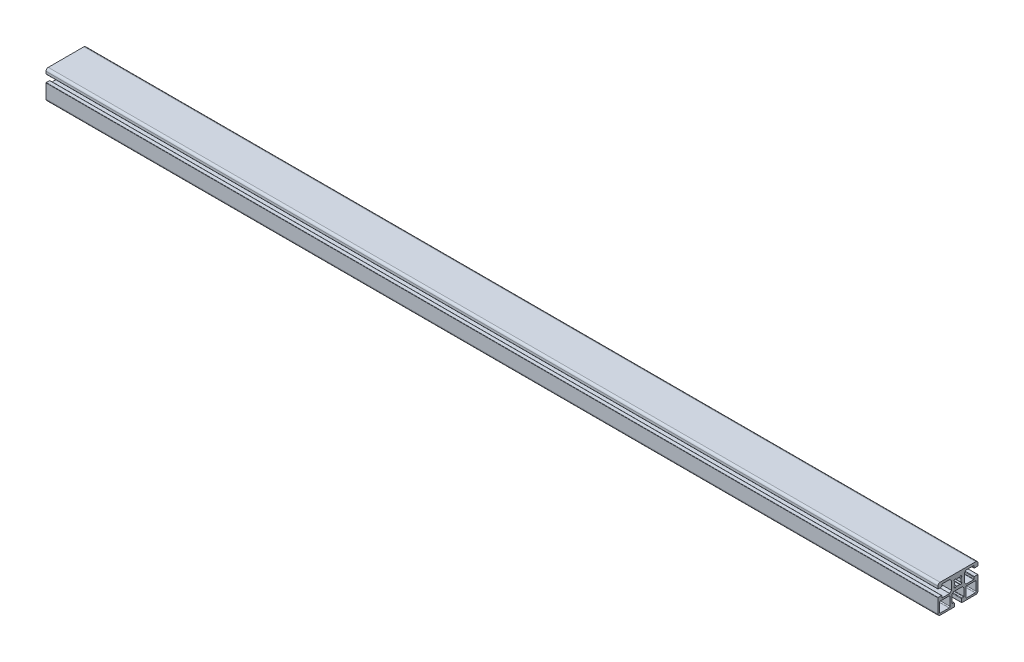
ISO-10303-21;
HEADER;
FILE_DESCRIPTION(('STEP AP214'),'2;1');
FILE_NAME('part.step','',(''),(''),'','','');
FILE_SCHEMA(('AUTOMOTIVE_DESIGN { 1 0 10303 214 1 1 1 1 }'));
ENDSEC;
DATA;
#1=APPLICATION_CONTEXT('core data for automotive mechanical design processes');
#2=APPLICATION_PROTOCOL_DEFINITION('international standard','automotive_design',2000,#1);
#3=PRODUCT_CONTEXT('',#1,'mechanical');
#4=PRODUCT('Part','Part','',(#3));
#5=PRODUCT_RELATED_PRODUCT_CATEGORY('part','',(#4));
#6=PRODUCT_DEFINITION_FORMATION('','',#4);
#7=PRODUCT_DEFINITION_CONTEXT('part definition',#1,'design');
#8=PRODUCT_DEFINITION('design','',#6,#7);
#9=PRODUCT_DEFINITION_SHAPE('','',#8);
#10=(LENGTH_UNIT() NAMED_UNIT(*) SI_UNIT(.MILLI.,.METRE.));
#11=(NAMED_UNIT(*) PLANE_ANGLE_UNIT() SI_UNIT($,.RADIAN.));
#12=(NAMED_UNIT(*) SI_UNIT($,.STERADIAN.) SOLID_ANGLE_UNIT());
#13=UNCERTAINTY_MEASURE_WITH_UNIT(LENGTH_MEASURE(1.E-05),#10,'distance_accuracy_value','');
#14=(GEOMETRIC_REPRESENTATION_CONTEXT(3) GLOBAL_UNCERTAINTY_ASSIGNED_CONTEXT((#13)) GLOBAL_UNIT_ASSIGNED_CONTEXT((#10,
#11,#12)) REPRESENTATION_CONTEXT('',''));
#15=CARTESIAN_POINT('',(0.,0.,0.));
#16=DIRECTION('',(0.,0.,1.));
#17=DIRECTION('',(1.,0.,0.));
#18=AXIS2_PLACEMENT_3D('',#15,#16,#17);
#19=CARTESIAN_POINT('',(1000.,10.9020876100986,-18.7638831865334));
#20=DIRECTION('',(-1.,0.,0.));
#21=DIRECTION('',(0.,0.,1.));
#22=AXIS2_PLACEMENT_3D('',#19,#20,#21);
#23=CYLINDRICAL_SURFACE('',#22,0.499999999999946);
#24=CARTESIAN_POINT('',(0.,10.9020876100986,-18.7638831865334));
#25=DIRECTION('',(1.,0.,0.));
#26=DIRECTION('',(0.,0.,-1.));
#27=AXIS2_PLACEMENT_3D('',#24,#25,#26);
#28=CIRCLE('',#27,0.499999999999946);
#29=CARTESIAN_POINT('',(0.,10.9020886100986,-18.2638831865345));
#30=VERTEX_POINT('',#29);
#31=CARTESIAN_POINT('',(0.,10.4020876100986,-18.7638831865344));
#32=VERTEX_POINT('',#31);
#33=EDGE_CURVE('E1029',#30,#32,#28,.T.);
#34=ORIENTED_EDGE('',*,*,#33,.T.);
#35=DIRECTION('',(-1.,0.,0.));
#36=VECTOR('',#35,1.);
#37=CARTESIAN_POINT('',(1000.,10.4020876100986,-18.7638831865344));
#38=LINE('',#37,#36);
#39=CARTESIAN_POINT('',(1000.,10.4020876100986,-18.7638831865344));
#40=VERTEX_POINT('',#39);
#41=EDGE_CURVE('E13',#40,#32,#38,.T.);
#42=ORIENTED_EDGE('',*,*,#41,.F.);
#43=CARTESIAN_POINT('',(1000.,10.9020876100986,-18.7638831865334));
#44=DIRECTION('',(1.,0.,0.));
#45=DIRECTION('',(0.,0.,-1.));
#46=AXIS2_PLACEMENT_3D('',#43,#44,#45);
#47=CIRCLE('',#46,0.499999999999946);
#48=CARTESIAN_POINT('',(1000.,10.9020886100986,-18.2638831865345));
#49=VERTEX_POINT('',#48);
#50=EDGE_CURVE('E1543',#49,#40,#47,.T.);
#51=ORIENTED_EDGE('',*,*,#50,.F.);
#52=DIRECTION('',(-1.,0.,0.));
#53=VECTOR('',#52,1.);
#54=CARTESIAN_POINT('',(1000.,10.9020886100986,-18.2638831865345));
#55=LINE('',#54,#53);
#56=EDGE_CURVE('E1140',#49,#30,#55,.T.);
#57=ORIENTED_EDGE('',*,*,#56,.T.);
#58=EDGE_LOOP('',(#34,#42,#51,#57));
#59=FACE_BOUND('',#58,.T.);
#60=ADVANCED_FACE('F218',(#59),#23,.T.);
#61=CARTESIAN_POINT('',(1000.,10.4020876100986,-18.7638831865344));
#62=DIRECTION('',(0.,1.,0.));
#63=DIRECTION('',(0.,0.,1.));
#64=AXIS2_PLACEMENT_3D('',#61,#62,#63);
#65=PLANE('',#64);
#66=DIRECTION('',(0.,0.,-1.));
#67=VECTOR('',#66,1.);
#68=CARTESIAN_POINT('',(0.,10.4020876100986,-18.7638831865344));
#69=LINE('',#68,#67);
#70=CARTESIAN_POINT('',(0.,10.4020876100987,-22.4638831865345));
#71=VERTEX_POINT('',#70);
#72=EDGE_CURVE('E1032',#32,#71,#69,.T.);
#73=ORIENTED_EDGE('',*,*,#72,.T.);
#74=DIRECTION('',(-1.,0.,0.));
#75=VECTOR('',#74,1.);
#76=CARTESIAN_POINT('',(1000.,10.4020876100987,-22.4638831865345));
#77=LINE('',#76,#75);
#78=CARTESIAN_POINT('',(1000.,10.4020876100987,-22.4638831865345));
#79=VERTEX_POINT('',#78);
#80=EDGE_CURVE('E228',#79,#71,#77,.T.);
#81=ORIENTED_EDGE('',*,*,#80,.F.);
#82=DIRECTION('',(0.,0.,-1.));
#83=VECTOR('',#82,1.);
#84=CARTESIAN_POINT('',(1000.,10.4020876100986,-18.7638831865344));
#85=LINE('',#84,#83);
#86=EDGE_CURVE('E1545',#40,#79,#85,.T.);
#87=ORIENTED_EDGE('',*,*,#86,.F.);
#88=ORIENTED_EDGE('',*,*,#41,.T.);
#89=EDGE_LOOP('',(#73,#81,#87,#88));
#90=FACE_BOUND('',#89,.T.);
#91=ADVANCED_FACE('F1677',(#90),#65,.F.);
#92=CARTESIAN_POINT('',(1000.,10.7020876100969,-22.4638831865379));
#93=DIRECTION('',(-1.,0.,0.));
#94=DIRECTION('',(0.,0.,1.));
#95=AXIS2_PLACEMENT_3D('',#92,#93,#94);
#96=CYLINDRICAL_SURFACE('',#95,0.299999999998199);
#97=CARTESIAN_POINT('',(0.,10.7020876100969,-22.4638831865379));
#98=DIRECTION('',(1.,0.,0.));
#99=DIRECTION('',(0.,0.,-1.));
#100=AXIS2_PLACEMENT_3D('',#97,#98,#99);
#101=CIRCLE('',#100,0.299999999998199);
#102=CARTESIAN_POINT('',(0.,10.7020886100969,-22.7638831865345));
#103=VERTEX_POINT('',#102);
#104=EDGE_CURVE('E1034',#71,#103,#101,.T.);
#105=ORIENTED_EDGE('',*,*,#104,.T.);
#106=DIRECTION('',(-1.,0.,0.));
#107=VECTOR('',#106,1.);
#108=CARTESIAN_POINT('',(1000.,10.7020886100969,-22.7638831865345));
#109=LINE('',#108,#107);
#110=CARTESIAN_POINT('',(1000.,10.7020886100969,-22.7638831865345));
#111=VERTEX_POINT('',#110);
#112=EDGE_CURVE('E1292',#111,#103,#109,.T.);
#113=ORIENTED_EDGE('',*,*,#112,.F.);
#114=CARTESIAN_POINT('',(1000.,10.7020876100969,-22.4638831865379));
#115=DIRECTION('',(1.,0.,0.));
#116=DIRECTION('',(0.,0.,-1.));
#117=AXIS2_PLACEMENT_3D('',#114,#115,#116);
#118=CIRCLE('',#117,0.299999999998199);
#119=EDGE_CURVE('E1547',#79,#111,#118,.T.);
#120=ORIENTED_EDGE('',*,*,#119,.F.);
#121=ORIENTED_EDGE('',*,*,#80,.T.);
#122=EDGE_LOOP('',(#105,#113,#120,#121));
#123=FACE_BOUND('',#122,.T.);
#124=ADVANCED_FACE('F1682',(#123),#96,.T.);
#125=CARTESIAN_POINT('',(1000.,10.7020886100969,-22.7638831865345));
#126=DIRECTION('',(0.,0.,1.));
#127=DIRECTION('',(0.,-1.,0.));
#128=AXIS2_PLACEMENT_3D('',#125,#126,#127);
#129=PLANE('',#128);
#130=DIRECTION('',(0.,1.,0.));
#131=VECTOR('',#130,1.);
#132=CARTESIAN_POINT('',(0.,10.7020886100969,-22.7638831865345));
#133=LINE('',#132,#131);
#134=CARTESIAN_POINT('',(0.,13.3020876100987,-22.7638831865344));
#135=VERTEX_POINT('',#134);
#136=EDGE_CURVE('E1036',#103,#135,#133,.T.);
#137=ORIENTED_EDGE('',*,*,#136,.T.);
#138=DIRECTION('',(-1.,0.,0.));
#139=VECTOR('',#138,1.);
#140=CARTESIAN_POINT('',(1000.,13.3020876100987,-22.7638831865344));
#141=LINE('',#140,#139);
#142=CARTESIAN_POINT('',(1000.,13.3020876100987,-22.7638831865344));
#143=VERTEX_POINT('',#142);
#144=EDGE_CURVE('E1289',#143,#135,#141,.T.);
#145=ORIENTED_EDGE('',*,*,#144,.F.);
#146=DIRECTION('',(0.,1.,0.));
#147=VECTOR('',#146,1.);
#148=CARTESIAN_POINT('',(1000.,10.7020886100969,-22.7638831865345));
#149=LINE('',#148,#147);
#150=EDGE_CURVE('E1549',#111,#143,#149,.T.);
#151=ORIENTED_EDGE('',*,*,#150,.F.);
#152=ORIENTED_EDGE('',*,*,#112,.T.);
#153=EDGE_LOOP('',(#137,#145,#151,#152));
#154=FACE_BOUND('',#153,.T.);
#155=ADVANCED_FACE('F2382',(#154),#129,.F.);
#156=CARTESIAN_POINT('',(1000.,13.3020876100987,-20.2638831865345));
#157=DIRECTION('',(-1.,0.,0.));
#158=DIRECTION('',(0.,0.,1.));
#159=AXIS2_PLACEMENT_3D('',#156,#157,#158);
#160=CYLINDRICAL_SURFACE('',#159,2.49999999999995);
#161=CARTESIAN_POINT('',(0.,13.3020876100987,-20.2638831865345));
#162=DIRECTION('',(1.,0.,0.));
#163=DIRECTION('',(0.,0.,-1.));
#164=AXIS2_PLACEMENT_3D('',#161,#162,#163);
#165=CIRCLE('',#164,2.49999999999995);
#166=CARTESIAN_POINT('',(0.,15.8020876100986,-20.2638831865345));
#167=VERTEX_POINT('',#166);
#168=EDGE_CURVE('E1038',#135,#167,#165,.T.);
#169=ORIENTED_EDGE('',*,*,#168,.T.);
#170=DIRECTION('',(-1.,0.,0.));
#171=VECTOR('',#170,1.);
#172=CARTESIAN_POINT('',(1000.,15.8020876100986,-20.2638831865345));
#173=LINE('',#172,#171);
#174=CARTESIAN_POINT('',(1000.,15.8020876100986,-20.2638831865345));
#175=VERTEX_POINT('',#174);
#176=EDGE_CURVE('E1286',#175,#167,#173,.T.);
#177=ORIENTED_EDGE('',*,*,#176,.F.);
#178=CARTESIAN_POINT('',(1000.,13.3020876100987,-20.2638831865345));
#179=DIRECTION('',(1.,0.,0.));
#180=DIRECTION('',(0.,0.,-1.));
#181=AXIS2_PLACEMENT_3D('',#178,#179,#180);
#182=CIRCLE('',#181,2.49999999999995);
#183=EDGE_CURVE('E1551',#143,#175,#182,.T.);
#184=ORIENTED_EDGE('',*,*,#183,.F.);
#185=ORIENTED_EDGE('',*,*,#144,.T.);
#186=EDGE_LOOP('',(#169,#177,#184,#185));
#187=FACE_BOUND('',#186,.T.);
#188=ADVANCED_FACE('F2373',(#187),#160,.T.);
#189=CARTESIAN_POINT('',(1000.,15.8020876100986,-20.2638831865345));
#190=DIRECTION('',(0.,-1.,0.));
#191=DIRECTION('',(0.,0.,-1.));
#192=AXIS2_PLACEMENT_3D('',#189,#190,#191);
#193=PLANE('',#192);
#194=DIRECTION('',(0.,0.,1.));
#195=VECTOR('',#194,1.);
#196=CARTESIAN_POINT('',(0.,15.8020876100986,-20.2638831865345));
#197=LINE('',#196,#195);
#198=CARTESIAN_POINT('',(0.,15.8020876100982,19.7361168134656));
#199=VERTEX_POINT('',#198);
#200=EDGE_CURVE('E1040',#167,#199,#197,.T.);
#201=ORIENTED_EDGE('',*,*,#200,.T.);
#202=DIRECTION('',(-1.,0.,0.));
#203=VECTOR('',#202,1.);
#204=CARTESIAN_POINT('',(1000.,15.8020876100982,19.7361168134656));
#205=LINE('',#204,#203);
#206=CARTESIAN_POINT('',(1000.,15.8020876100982,19.7361168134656));
#207=VERTEX_POINT('',#206);
#208=EDGE_CURVE('E1283',#207,#199,#205,.T.);
#209=ORIENTED_EDGE('',*,*,#208,.F.);
#210=DIRECTION('',(0.,0.,1.));
#211=VECTOR('',#210,1.);
#212=CARTESIAN_POINT('',(1000.,15.8020876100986,-20.2638831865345));
#213=LINE('',#212,#211);
#214=EDGE_CURVE('E1553',#175,#207,#213,.T.);
#215=ORIENTED_EDGE('',*,*,#214,.F.);
#216=ORIENTED_EDGE('',*,*,#176,.T.);
#217=EDGE_LOOP('',(#201,#209,#215,#216));
#218=FACE_BOUND('',#217,.T.);
#219=ADVANCED_FACE('F2364',(#218),#193,.F.);
#220=CARTESIAN_POINT('',(1000.,13.3020876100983,19.7361168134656));
#221=DIRECTION('',(-1.,0.,0.));
#222=DIRECTION('',(0.,0.,1.));
#223=AXIS2_PLACEMENT_3D('',#220,#221,#222);
#224=CYLINDRICAL_SURFACE('',#223,2.49999999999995);
#225=CARTESIAN_POINT('',(0.,13.3020876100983,19.7361168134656));
#226=DIRECTION('',(1.,0.,0.));
#227=DIRECTION('',(0.,0.,-1.));
#228=AXIS2_PLACEMENT_3D('',#225,#226,#227);
#229=CIRCLE('',#228,2.49999999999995);
#230=CARTESIAN_POINT('',(0.,13.3020876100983,22.2361168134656));
#231=VERTEX_POINT('',#230);
#232=EDGE_CURVE('E1042',#199,#231,#229,.T.);
#233=ORIENTED_EDGE('',*,*,#232,.T.);
#234=DIRECTION('',(-1.,0.,0.));
#235=VECTOR('',#234,1.);
#236=CARTESIAN_POINT('',(1000.,13.3020876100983,22.2361168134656));
#237=LINE('',#236,#235);
#238=CARTESIAN_POINT('',(1000.,13.3020876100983,22.2361168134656));
#239=VERTEX_POINT('',#238);
#240=EDGE_CURVE('E1280',#239,#231,#237,.T.);
#241=ORIENTED_EDGE('',*,*,#240,.F.);
#242=CARTESIAN_POINT('',(1000.,13.3020876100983,19.7361168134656));
#243=DIRECTION('',(1.,0.,0.));
#244=DIRECTION('',(0.,0.,-1.));
#245=AXIS2_PLACEMENT_3D('',#242,#243,#244);
#246=CIRCLE('',#245,2.49999999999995);
#247=EDGE_CURVE('E1555',#207,#239,#246,.T.);
#248=ORIENTED_EDGE('',*,*,#247,.F.);
#249=ORIENTED_EDGE('',*,*,#208,.T.);
#250=EDGE_LOOP('',(#233,#241,#248,#249));
#251=FACE_BOUND('',#250,.T.);
#252=ADVANCED_FACE('F2355',(#251),#224,.T.);
#253=CARTESIAN_POINT('',(1000.,13.3020876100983,22.2361168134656));
#254=DIRECTION('',(0.,0.,-1.));
#255=DIRECTION('',(0.,1.,0.));
#256=AXIS2_PLACEMENT_3D('',#253,#254,#255);
#257=PLANE('',#256);
#258=DIRECTION('',(0.,-1.,0.));
#259=VECTOR('',#258,1.);
#260=CARTESIAN_POINT('',(0.,13.3020876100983,22.2361168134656));
#261=LINE('',#260,#259);
#262=CARTESIAN_POINT('',(0.,10.7020876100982,22.2361168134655));
#263=VERTEX_POINT('',#262);
#264=EDGE_CURVE('E1044',#231,#263,#261,.T.);
#265=ORIENTED_EDGE('',*,*,#264,.T.);
#266=DIRECTION('',(-1.,0.,0.));
#267=VECTOR('',#266,1.);
#268=CARTESIAN_POINT('',(1000.,10.7020876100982,22.2361168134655));
#269=LINE('',#268,#267);
#270=CARTESIAN_POINT('',(1000.,10.7020876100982,22.2361168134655));
#271=VERTEX_POINT('',#270);
#272=EDGE_CURVE('E1277',#271,#263,#269,.T.);
#273=ORIENTED_EDGE('',*,*,#272,.F.);
#274=DIRECTION('',(0.,-1.,0.));
#275=VECTOR('',#274,1.);
#276=CARTESIAN_POINT('',(1000.,13.3020876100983,22.2361168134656));
#277=LINE('',#276,#275);
#278=EDGE_CURVE('E1557',#239,#271,#277,.T.);
#279=ORIENTED_EDGE('',*,*,#278,.F.);
#280=ORIENTED_EDGE('',*,*,#240,.T.);
#281=EDGE_LOOP('',(#265,#273,#279,#280));
#282=FACE_BOUND('',#281,.T.);
#283=ADVANCED_FACE('F2346',(#282),#257,.F.);
#284=CARTESIAN_POINT('',(1000.,10.7020876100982,21.9361168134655));
#285=DIRECTION('',(-1.,0.,0.));
#286=DIRECTION('',(0.,0.,1.));
#287=AXIS2_PLACEMENT_3D('',#284,#285,#286);
#288=CYLINDRICAL_SURFACE('',#287,0.300000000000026);
#289=CARTESIAN_POINT('',(0.,10.7020876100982,21.9361168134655));
#290=DIRECTION('',(1.,0.,0.));
#291=DIRECTION('',(0.,0.,-1.));
#292=AXIS2_PLACEMENT_3D('',#289,#290,#291);
#293=CIRCLE('',#292,0.300000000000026);
#294=CARTESIAN_POINT('',(0.,10.4020876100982,21.9361168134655));
#295=VERTEX_POINT('',#294);
#296=EDGE_CURVE('E1046',#263,#295,#293,.T.);
#297=ORIENTED_EDGE('',*,*,#296,.T.);
#298=DIRECTION('',(-1.,0.,0.));
#299=VECTOR('',#298,1.);
#300=CARTESIAN_POINT('',(1000.,10.4020876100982,21.9361168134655));
#301=LINE('',#300,#299);
#302=CARTESIAN_POINT('',(1000.,10.4020876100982,21.9361168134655));
#303=VERTEX_POINT('',#302);
#304=EDGE_CURVE('E1274',#303,#295,#301,.T.);
#305=ORIENTED_EDGE('',*,*,#304,.F.);
#306=CARTESIAN_POINT('',(1000.,10.7020876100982,21.9361168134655));
#307=DIRECTION('',(1.,0.,0.));
#308=DIRECTION('',(0.,0.,-1.));
#309=AXIS2_PLACEMENT_3D('',#306,#307,#308);
#310=CIRCLE('',#309,0.300000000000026);
#311=EDGE_CURVE('E1559',#271,#303,#310,.T.);
#312=ORIENTED_EDGE('',*,*,#311,.F.);
#313=ORIENTED_EDGE('',*,*,#272,.T.);
#314=EDGE_LOOP('',(#297,#305,#312,#313));
#315=FACE_BOUND('',#314,.T.);
#316=ADVANCED_FACE('F2337',(#315),#288,.T.);
#317=CARTESIAN_POINT('',(1000.,10.4020876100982,21.9361168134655));
#318=DIRECTION('',(0.,1.,0.));
#319=DIRECTION('',(0.,0.,1.));
#320=AXIS2_PLACEMENT_3D('',#317,#318,#319);
#321=PLANE('',#320);
#322=DIRECTION('',(0.,0.,-1.));
#323=VECTOR('',#322,1.);
#324=CARTESIAN_POINT('',(0.,10.4020876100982,21.9361168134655));
#325=LINE('',#324,#323);
#326=CARTESIAN_POINT('',(0.,10.4020876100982,18.2361168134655));
#327=VERTEX_POINT('',#326);
#328=EDGE_CURVE('E1048',#295,#327,#325,.T.);
#329=ORIENTED_EDGE('',*,*,#328,.T.);
#330=DIRECTION('',(-1.,0.,0.));
#331=VECTOR('',#330,1.);
#332=CARTESIAN_POINT('',(1000.,10.4020876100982,18.2361168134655));
#333=LINE('',#332,#331);
#334=CARTESIAN_POINT('',(1000.,10.4020876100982,18.2361168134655));
#335=VERTEX_POINT('',#334);
#336=EDGE_CURVE('E1271',#335,#327,#333,.T.);
#337=ORIENTED_EDGE('',*,*,#336,.F.);
#338=DIRECTION('',(0.,0.,-1.));
#339=VECTOR('',#338,1.);
#340=CARTESIAN_POINT('',(1000.,10.4020876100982,21.9361168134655));
#341=LINE('',#340,#339);
#342=EDGE_CURVE('E1561',#303,#335,#341,.T.);
#343=ORIENTED_EDGE('',*,*,#342,.F.);
#344=ORIENTED_EDGE('',*,*,#304,.T.);
#345=EDGE_LOOP('',(#329,#337,#343,#344));
#346=FACE_BOUND('',#345,.T.);
#347=ADVANCED_FACE('F2328',(#346),#321,.F.);
#348=CARTESIAN_POINT('',(1000.,10.9020876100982,18.2361168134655));
#349=DIRECTION('',(-1.,0.,0.));
#350=DIRECTION('',(0.,0.,1.));
#351=AXIS2_PLACEMENT_3D('',#348,#349,#350);
#352=CYLINDRICAL_SURFACE('',#351,0.499999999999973);
#353=CARTESIAN_POINT('',(0.,10.9020876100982,18.2361168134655));
#354=DIRECTION('',(1.,0.,0.));
#355=DIRECTION('',(0.,0.,-1.));
#356=AXIS2_PLACEMENT_3D('',#353,#354,#355);
#357=CIRCLE('',#356,0.499999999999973);
#358=CARTESIAN_POINT('',(0.,10.9020876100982,17.7361168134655));
#359=VERTEX_POINT('',#358);
#360=EDGE_CURVE('E1050',#327,#359,#357,.T.);
#361=ORIENTED_EDGE('',*,*,#360,.T.);
#362=DIRECTION('',(-1.,0.,0.));
#363=VECTOR('',#362,1.);
#364=CARTESIAN_POINT('',(1000.,10.9020876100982,17.7361168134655));
#365=LINE('',#364,#363);
#366=CARTESIAN_POINT('',(1000.,10.9020876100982,17.7361168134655));
#367=VERTEX_POINT('',#366);
#368=EDGE_CURVE('E1268',#367,#359,#365,.T.);
#369=ORIENTED_EDGE('',*,*,#368,.F.);
#370=CARTESIAN_POINT('',(1000.,10.9020876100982,18.2361168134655));
#371=DIRECTION('',(1.,0.,0.));
#372=DIRECTION('',(0.,0.,-1.));
#373=AXIS2_PLACEMENT_3D('',#370,#371,#372);
#374=CIRCLE('',#373,0.499999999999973);
#375=EDGE_CURVE('E1563',#335,#367,#374,.T.);
#376=ORIENTED_EDGE('',*,*,#375,.F.);
#377=ORIENTED_EDGE('',*,*,#336,.T.);
#378=EDGE_LOOP('',(#361,#369,#376,#377));
#379=FACE_BOUND('',#378,.T.);
#380=ADVANCED_FACE('F2319',(#379),#352,.T.);
#381=CARTESIAN_POINT('',(1000.,10.9020876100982,17.7361168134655));
#382=DIRECTION('',(0.,0.,1.));
#383=DIRECTION('',(0.,-1.,0.));
#384=AXIS2_PLACEMENT_3D('',#381,#382,#383);
#385=PLANE('',#384);
#386=DIRECTION('',(0.,1.,0.));
#387=VECTOR('',#386,1.);
#388=CARTESIAN_POINT('',(0.,10.9020876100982,17.7361168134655));
#389=LINE('',#388,#387);
#390=CARTESIAN_POINT('',(0.,12.8020876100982,17.7361168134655));
#391=VERTEX_POINT('',#390);
#392=EDGE_CURVE('E1052',#359,#391,#389,.T.);
#393=ORIENTED_EDGE('',*,*,#392,.T.);
#394=DIRECTION('',(-1.,0.,0.));
#395=VECTOR('',#394,1.);
#396=CARTESIAN_POINT('',(1000.,12.8020876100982,17.7361168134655));
#397=LINE('',#396,#395);
#398=CARTESIAN_POINT('',(1000.,12.8020876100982,17.7361168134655));
#399=VERTEX_POINT('',#398);
#400=EDGE_CURVE('E1265',#399,#391,#397,.T.);
#401=ORIENTED_EDGE('',*,*,#400,.F.);
#402=DIRECTION('',(0.,1.,0.));
#403=VECTOR('',#402,1.);
#404=CARTESIAN_POINT('',(1000.,10.9020876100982,17.7361168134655));
#405=LINE('',#404,#403);
#406=EDGE_CURVE('E1565',#367,#399,#405,.T.);
#407=ORIENTED_EDGE('',*,*,#406,.F.);
#408=ORIENTED_EDGE('',*,*,#368,.T.);
#409=EDGE_LOOP('',(#393,#401,#407,#408));
#410=FACE_BOUND('',#409,.T.);
#411=ADVANCED_FACE('F2310',(#410),#385,.F.);
#412=CARTESIAN_POINT('',(1000.,12.8020876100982,17.4361168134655));
#413=DIRECTION('',(-1.,0.,0.));
#414=DIRECTION('',(0.,0.,1.));
#415=AXIS2_PLACEMENT_3D('',#412,#413,#414);
#416=CYLINDRICAL_SURFACE('',#415,0.300000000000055);
#417=CARTESIAN_POINT('',(0.,12.8020876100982,17.4361168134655));
#418=DIRECTION('',(-1.,0.,0.));
#419=DIRECTION('',(0.,0.,-1.));
#420=AXIS2_PLACEMENT_3D('',#417,#418,#419);
#421=CIRCLE('',#420,0.300000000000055);
#422=CARTESIAN_POINT('',(0.,13.1020876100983,17.4361168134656));
#423=VERTEX_POINT('',#422);
#424=EDGE_CURVE('E1054',#391,#423,#421,.T.);
#425=ORIENTED_EDGE('',*,*,#424,.T.);
#426=DIRECTION('',(-1.,0.,0.));
#427=VECTOR('',#426,1.);
#428=CARTESIAN_POINT('',(1000.,13.1020876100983,17.4361168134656));
#429=LINE('',#428,#427);
#430=CARTESIAN_POINT('',(1000.,13.1020876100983,17.4361168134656));
#431=VERTEX_POINT('',#430);
#432=EDGE_CURVE('E1262',#431,#423,#429,.T.);
#433=ORIENTED_EDGE('',*,*,#432,.F.);
#434=CARTESIAN_POINT('',(1000.,12.8020876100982,17.4361168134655));
#435=DIRECTION('',(-1.,0.,0.));
#436=DIRECTION('',(0.,0.,-1.));
#437=AXIS2_PLACEMENT_3D('',#434,#435,#436);
#438=CIRCLE('',#437,0.300000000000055);
#439=EDGE_CURVE('E1567',#399,#431,#438,.T.);
#440=ORIENTED_EDGE('',*,*,#439,.F.);
#441=ORIENTED_EDGE('',*,*,#400,.T.);
#442=EDGE_LOOP('',(#425,#433,#440,#441));
#443=FACE_BOUND('',#442,.T.);
#444=ADVANCED_FACE('F2301',(#443),#416,.F.);
#445=CARTESIAN_POINT('',(1000.,13.1020876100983,17.4361168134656));
#446=DIRECTION('',(0.,1.,0.));
#447=DIRECTION('',(0.,0.,1.));
#448=AXIS2_PLACEMENT_3D('',#445,#446,#447);
#449=PLANE('',#448);
#450=DIRECTION('',(0.,0.,-1.));
#451=VECTOR('',#450,1.);
#452=CARTESIAN_POINT('',(0.,13.1020876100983,17.4361168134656));
#453=LINE('',#452,#451);
#454=CARTESIAN_POINT('',(0.,13.1020876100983,8.93611681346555));
#455=VERTEX_POINT('',#454);
#456=EDGE_CURVE('E1056',#423,#455,#453,.T.);
#457=ORIENTED_EDGE('',*,*,#456,.T.);
#458=DIRECTION('',(-1.,0.,0.));
#459=VECTOR('',#458,1.);
#460=CARTESIAN_POINT('',(1000.,13.1020876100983,8.93611681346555));
#461=LINE('',#460,#459);
#462=CARTESIAN_POINT('',(1000.,13.1020876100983,8.93611681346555));
#463=VERTEX_POINT('',#462);
#464=EDGE_CURVE('E1259',#463,#455,#461,.T.);
#465=ORIENTED_EDGE('',*,*,#464,.F.);
#466=DIRECTION('',(0.,0.,-1.));
#467=VECTOR('',#466,1.);
#468=CARTESIAN_POINT('',(1000.,13.1020876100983,17.4361168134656));
#469=LINE('',#468,#467);
#470=EDGE_CURVE('E1569',#431,#463,#469,.T.);
#471=ORIENTED_EDGE('',*,*,#470,.F.);
#472=ORIENTED_EDGE('',*,*,#432,.T.);
#473=EDGE_LOOP('',(#457,#465,#471,#472));
#474=FACE_BOUND('',#473,.T.);
#475=ADVANCED_FACE('F2292',(#474),#449,.F.);
#476=CARTESIAN_POINT('',(1000.,13.1020876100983,8.93611681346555));
#477=DIRECTION('',(0.,0.707106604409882,-0.707106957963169));
#478=DIRECTION('',(0.,0.707106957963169,0.707106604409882));
#479=AXIS2_PLACEMENT_3D('',#476,#477,#478);
#480=PLANE('',#479);
#481=DIRECTION('',(0.,-0.707106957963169,-0.707106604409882));
#482=VECTOR('',#481,1.);
#483=CARTESIAN_POINT('',(0.,13.1020876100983,8.93611681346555));
#484=LINE('',#483,#482);
#485=CARTESIAN_POINT('',(0.,11.1020866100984,6.93611681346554));
#486=VERTEX_POINT('',#485);
#487=EDGE_CURVE('E1058',#455,#486,#484,.T.);
#488=ORIENTED_EDGE('',*,*,#487,.T.);
#489=DIRECTION('',(-1.,0.,0.));
#490=VECTOR('',#489,1.);
#491=CARTESIAN_POINT('',(1000.,11.1020866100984,6.93611681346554));
#492=LINE('',#491,#490);
#493=CARTESIAN_POINT('',(1000.,11.1020866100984,6.93611681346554));
#494=VERTEX_POINT('',#493);
#495=EDGE_CURVE('E1256',#494,#486,#492,.T.);
#496=ORIENTED_EDGE('',*,*,#495,.F.);
#497=DIRECTION('',(0.,-0.707106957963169,-0.707106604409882));
#498=VECTOR('',#497,1.);
#499=CARTESIAN_POINT('',(1000.,13.1020876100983,8.93611681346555));
#500=LINE('',#499,#498);
#501=EDGE_CURVE('E1571',#463,#494,#500,.T.);
#502=ORIENTED_EDGE('',*,*,#501,.F.);
#503=ORIENTED_EDGE('',*,*,#464,.T.);
#504=EDGE_LOOP('',(#488,#496,#502,#503));
#505=FACE_BOUND('',#504,.T.);
#506=ADVANCED_FACE('F2283',(#505),#480,.F.);
#507=CARTESIAN_POINT('',(1000.,11.1020866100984,6.93611681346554));
#508=DIRECTION('',(0.,0.,-1.));
#509=DIRECTION('',(0.,1.,0.));
#510=AXIS2_PLACEMENT_3D('',#507,#508,#509);
#511=PLANE('',#510);
#512=DIRECTION('',(0.,-1.,0.));
#513=VECTOR('',#512,1.);
#514=CARTESIAN_POINT('',(0.,11.1020866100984,6.93611681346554));
#515=LINE('',#514,#513);
#516=CARTESIAN_POINT('',(0.,1.50208861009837,6.93611681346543));
#517=VERTEX_POINT('',#516);
#518=EDGE_CURVE('E1060',#486,#517,#515,.T.);
#519=ORIENTED_EDGE('',*,*,#518,.T.);
#520=DIRECTION('',(-1.,0.,0.));
#521=VECTOR('',#520,1.);
#522=CARTESIAN_POINT('',(1000.,1.50208861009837,6.93611681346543));
#523=LINE('',#522,#521);
#524=CARTESIAN_POINT('',(1000.,1.50208861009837,6.93611681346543));
#525=VERTEX_POINT('',#524);
#526=EDGE_CURVE('E1253',#525,#517,#523,.T.);
#527=ORIENTED_EDGE('',*,*,#526,.F.);
#528=DIRECTION('',(0.,-1.,0.));
#529=VECTOR('',#528,1.);
#530=CARTESIAN_POINT('',(1000.,11.1020866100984,6.93611681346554));
#531=LINE('',#530,#529);
#532=EDGE_CURVE('E1573',#494,#525,#531,.T.);
#533=ORIENTED_EDGE('',*,*,#532,.F.);
#534=ORIENTED_EDGE('',*,*,#495,.T.);
#535=EDGE_LOOP('',(#519,#527,#533,#534));
#536=FACE_BOUND('',#535,.T.);
#537=ADVANCED_FACE('F2274',(#536),#511,.F.);
#538=CARTESIAN_POINT('',(1000.,1.50208861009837,6.93611681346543));
#539=DIRECTION('',(0.,-0.707106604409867,-0.707106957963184));
#540=DIRECTION('',(0.,0.707106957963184,-0.707106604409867));
#541=AXIS2_PLACEMENT_3D('',#538,#539,#540);
#542=PLANE('',#541);
#543=DIRECTION('',(0.,-0.707106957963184,0.707106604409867));
#544=VECTOR('',#543,1.);
#545=CARTESIAN_POINT('',(0.,1.50208861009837,6.93611681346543));
#546=LINE('',#545,#544);
#547=CARTESIAN_POINT('',(0.,-0.497912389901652,8.93611681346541));
#548=VERTEX_POINT('',#547);
#549=EDGE_CURVE('E1062',#517,#548,#546,.T.);
#550=ORIENTED_EDGE('',*,*,#549,.T.);
#551=DIRECTION('',(-1.,0.,0.));
#552=VECTOR('',#551,1.);
#553=CARTESIAN_POINT('',(1000.,-0.497912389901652,8.93611681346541));
#554=LINE('',#553,#552);
#555=CARTESIAN_POINT('',(1000.,-0.497912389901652,8.93611681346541));
#556=VERTEX_POINT('',#555);
#557=EDGE_CURVE('E1250',#556,#548,#554,.T.);
#558=ORIENTED_EDGE('',*,*,#557,.F.);
#559=DIRECTION('',(0.,-0.707106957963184,0.707106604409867));
#560=VECTOR('',#559,1.);
#561=CARTESIAN_POINT('',(1000.,1.50208861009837,6.93611681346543));
#562=LINE('',#561,#560);
#563=EDGE_CURVE('E1575',#525,#556,#562,.T.);
#564=ORIENTED_EDGE('',*,*,#563,.F.);
#565=ORIENTED_EDGE('',*,*,#526,.T.);
#566=EDGE_LOOP('',(#550,#558,#564,#565));
#567=FACE_BOUND('',#566,.T.);
#568=ADVANCED_FACE('F2265',(#567),#542,.F.);
#569=CARTESIAN_POINT('',(1000.,-0.497912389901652,8.93611681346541));
#570=DIRECTION('',(0.,-1.,0.));
#571=DIRECTION('',(0.,0.,-1.));
#572=AXIS2_PLACEMENT_3D('',#569,#570,#571);
#573=PLANE('',#572);
#574=DIRECTION('',(0.,0.,1.));
#575=VECTOR('',#574,1.);
#576=CARTESIAN_POINT('',(0.,-0.497912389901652,8.93611681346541));
#577=LINE('',#576,#575);
#578=CARTESIAN_POINT('',(0.,-0.497912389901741,17.4361168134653));
#579=VERTEX_POINT('',#578);
#580=EDGE_CURVE('E1064',#548,#579,#577,.T.);
#581=ORIENTED_EDGE('',*,*,#580,.T.);
#582=DIRECTION('',(-1.,0.,0.));
#583=VECTOR('',#582,1.);
#584=CARTESIAN_POINT('',(1000.,-0.497912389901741,17.4361168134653));
#585=LINE('',#584,#583);
#586=CARTESIAN_POINT('',(1000.,-0.497912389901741,17.4361168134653));
#587=VERTEX_POINT('',#586);
#588=EDGE_CURVE('E1247',#587,#579,#585,.T.);
#589=ORIENTED_EDGE('',*,*,#588,.F.);
#590=DIRECTION('',(0.,0.,1.));
#591=VECTOR('',#590,1.);
#592=CARTESIAN_POINT('',(1000.,-0.497912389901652,8.93611681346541));
#593=LINE('',#592,#591);
#594=EDGE_CURVE('E1577',#556,#587,#593,.T.);
#595=ORIENTED_EDGE('',*,*,#594,.F.);
#596=ORIENTED_EDGE('',*,*,#557,.T.);
#597=EDGE_LOOP('',(#581,#589,#595,#596));
#598=FACE_BOUND('',#597,.T.);
#599=ADVANCED_FACE('F2256',(#598),#573,.F.);
#600=CARTESIAN_POINT('',(1000.,-0.197912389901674,17.4361168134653));
#601=DIRECTION('',(-1.,0.,0.));
#602=DIRECTION('',(0.,0.,1.));
#603=AXIS2_PLACEMENT_3D('',#600,#601,#602);
#604=CYLINDRICAL_SURFACE('',#603,0.300000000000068);
#605=CARTESIAN_POINT('',(0.,-0.197912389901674,17.4361168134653));
#606=DIRECTION('',(-1.,0.,0.));
#607=DIRECTION('',(0.,0.,-1.));
#608=AXIS2_PLACEMENT_3D('',#605,#606,#607);
#609=CIRCLE('',#608,0.300000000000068);
#610=CARTESIAN_POINT('',(0.,-0.19791238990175,17.7361168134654));
#611=VERTEX_POINT('',#610);
#612=EDGE_CURVE('E1066',#579,#611,#609,.T.);
#613=ORIENTED_EDGE('',*,*,#612,.T.);
#614=DIRECTION('',(-1.,0.,0.));
#615=VECTOR('',#614,1.);
#616=CARTESIAN_POINT('',(1000.,-0.19791238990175,17.7361168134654));
#617=LINE('',#616,#615);
#618=CARTESIAN_POINT('',(1000.,-0.19791238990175,17.7361168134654));
#619=VERTEX_POINT('',#618);
#620=EDGE_CURVE('E1244',#619,#611,#617,.T.);
#621=ORIENTED_EDGE('',*,*,#620,.F.);
#622=CARTESIAN_POINT('',(1000.,-0.197912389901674,17.4361168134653));
#623=DIRECTION('',(-1.,0.,0.));
#624=DIRECTION('',(0.,0.,-1.));
#625=AXIS2_PLACEMENT_3D('',#622,#623,#624);
#626=CIRCLE('',#625,0.300000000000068);
#627=EDGE_CURVE('E1579',#587,#619,#626,.T.);
#628=ORIENTED_EDGE('',*,*,#627,.F.);
#629=ORIENTED_EDGE('',*,*,#588,.T.);
#630=EDGE_LOOP('',(#613,#621,#628,#629));
#631=FACE_BOUND('',#630,.T.);
#632=ADVANCED_FACE('F2247',(#631),#604,.F.);
#633=CARTESIAN_POINT('',(1000.,-0.19791238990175,17.7361168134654));
#634=DIRECTION('',(0.,0.,1.));
#635=DIRECTION('',(0.,-1.,0.));
#636=AXIS2_PLACEMENT_3D('',#633,#634,#635);
#637=PLANE('',#636);
#638=DIRECTION('',(0.,1.,0.));
#639=VECTOR('',#638,1.);
#640=CARTESIAN_POINT('',(0.,-0.19791238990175,17.7361168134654));
#641=LINE('',#640,#639);
#642=CARTESIAN_POINT('',(0.,1.70208761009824,17.7361168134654));
#643=VERTEX_POINT('',#642);
#644=EDGE_CURVE('E1068',#611,#643,#641,.T.);
#645=ORIENTED_EDGE('',*,*,#644,.T.);
#646=DIRECTION('',(-1.,0.,0.));
#647=VECTOR('',#646,1.);
#648=CARTESIAN_POINT('',(1000.,1.70208761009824,17.7361168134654));
#649=LINE('',#648,#647);
#650=CARTESIAN_POINT('',(1000.,1.70208761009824,17.7361168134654));
#651=VERTEX_POINT('',#650);
#652=EDGE_CURVE('E1241',#651,#643,#649,.T.);
#653=ORIENTED_EDGE('',*,*,#652,.F.);
#654=DIRECTION('',(0.,1.,0.));
#655=VECTOR('',#654,1.);
#656=CARTESIAN_POINT('',(1000.,-0.19791238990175,17.7361168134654));
#657=LINE('',#656,#655);
#658=EDGE_CURVE('E1581',#619,#651,#657,.T.);
#659=ORIENTED_EDGE('',*,*,#658,.F.);
#660=ORIENTED_EDGE('',*,*,#620,.T.);
#661=EDGE_LOOP('',(#645,#653,#659,#660));
#662=FACE_BOUND('',#661,.T.);
#663=ADVANCED_FACE('F2238',(#662),#637,.F.);
#664=CARTESIAN_POINT('',(1000.,1.7020876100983,18.2361168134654));
#665=DIRECTION('',(-1.,0.,0.));
#666=DIRECTION('',(0.,0.,1.));
#667=AXIS2_PLACEMENT_3D('',#664,#665,#666);
#668=CYLINDRICAL_SURFACE('',#667,0.49999999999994);
#669=CARTESIAN_POINT('',(0.,1.7020876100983,18.2361168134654));
#670=DIRECTION('',(1.,0.,0.));
#671=DIRECTION('',(0.,0.,-1.));
#672=AXIS2_PLACEMENT_3D('',#669,#670,#671);
#673=CIRCLE('',#672,0.49999999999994);
#674=CARTESIAN_POINT('',(0.,2.20208761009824,18.2361168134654));
#675=VERTEX_POINT('',#674);
#676=EDGE_CURVE('E1070',#643,#675,#673,.T.);
#677=ORIENTED_EDGE('',*,*,#676,.T.);
#678=DIRECTION('',(-1.,0.,0.));
#679=VECTOR('',#678,1.);
#680=CARTESIAN_POINT('',(1000.,2.20208761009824,18.2361168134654));
#681=LINE('',#680,#679);
#682=CARTESIAN_POINT('',(1000.,2.20208761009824,18.2361168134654));
#683=VERTEX_POINT('',#682);
#684=EDGE_CURVE('E1238',#683,#675,#681,.T.);
#685=ORIENTED_EDGE('',*,*,#684,.F.);
#686=CARTESIAN_POINT('',(1000.,1.7020876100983,18.2361168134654));
#687=DIRECTION('',(1.,0.,0.));
#688=DIRECTION('',(0.,0.,-1.));
#689=AXIS2_PLACEMENT_3D('',#686,#687,#688);
#690=CIRCLE('',#689,0.49999999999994);
#691=EDGE_CURVE('E1583',#651,#683,#690,.T.);
#692=ORIENTED_EDGE('',*,*,#691,.F.);
#693=ORIENTED_EDGE('',*,*,#652,.T.);
#694=EDGE_LOOP('',(#677,#685,#692,#693));
#695=FACE_BOUND('',#694,.T.);
#696=ADVANCED_FACE('F2229',(#695),#668,.T.);
#697=CARTESIAN_POINT('',(1000.,2.20208761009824,18.2361168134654));
#698=DIRECTION('',(0.,-1.,0.));
#699=DIRECTION('',(0.,0.,-1.));
#700=AXIS2_PLACEMENT_3D('',#697,#698,#699);
#701=PLANE('',#700);
#702=DIRECTION('',(0.,0.,1.));
#703=VECTOR('',#702,1.);
#704=CARTESIAN_POINT('',(0.,2.20208761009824,18.2361168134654));
#705=LINE('',#704,#703);
#706=CARTESIAN_POINT('',(0.,2.2020876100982,21.9361168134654));
#707=VERTEX_POINT('',#706);
#708=EDGE_CURVE('E1072',#675,#707,#705,.T.);
#709=ORIENTED_EDGE('',*,*,#708,.T.);
#710=DIRECTION('',(-1.,0.,0.));
#711=VECTOR('',#710,1.);
#712=CARTESIAN_POINT('',(1000.,2.2020876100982,21.9361168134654));
#713=LINE('',#712,#711);
#714=CARTESIAN_POINT('',(1000.,2.2020876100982,21.9361168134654));
#715=VERTEX_POINT('',#714);
#716=EDGE_CURVE('E1235',#715,#707,#713,.T.);
#717=ORIENTED_EDGE('',*,*,#716,.F.);
#718=DIRECTION('',(0.,0.,1.));
#719=VECTOR('',#718,1.);
#720=CARTESIAN_POINT('',(1000.,2.20208761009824,18.2361168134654));
#721=LINE('',#720,#719);
#722=EDGE_CURVE('E1585',#683,#715,#721,.T.);
#723=ORIENTED_EDGE('',*,*,#722,.F.);
#724=ORIENTED_EDGE('',*,*,#684,.T.);
#725=EDGE_LOOP('',(#709,#717,#723,#724));
#726=FACE_BOUND('',#725,.T.);
#727=ADVANCED_FACE('F2220',(#726),#701,.F.);
#728=CARTESIAN_POINT('',(1000.,1.90208761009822,21.9361168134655));
#729=DIRECTION('',(-1.,0.,0.));
#730=DIRECTION('',(0.,0.,1.));
#731=AXIS2_PLACEMENT_3D('',#728,#729,#730);
#732=CYLINDRICAL_SURFACE('',#731,0.299999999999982);
#733=CARTESIAN_POINT('',(0.,1.90208761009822,21.9361168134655));
#734=DIRECTION('',(1.,0.,0.));
#735=DIRECTION('',(0.,0.,-1.));
#736=AXIS2_PLACEMENT_3D('',#733,#734,#735);
#737=CIRCLE('',#736,0.299999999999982);
#738=CARTESIAN_POINT('',(0.,1.90208761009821,22.2361168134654));
#739=VERTEX_POINT('',#738);
#740=EDGE_CURVE('E1074',#707,#739,#737,.T.);
#741=ORIENTED_EDGE('',*,*,#740,.T.);
#742=DIRECTION('',(-1.,0.,0.));
#743=VECTOR('',#742,1.);
#744=CARTESIAN_POINT('',(1000.,1.90208761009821,22.2361168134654));
#745=LINE('',#744,#743);
#746=CARTESIAN_POINT('',(1000.,1.90208761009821,22.2361168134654));
#747=VERTEX_POINT('',#746);
#748=EDGE_CURVE('E1232',#747,#739,#745,.T.);
#749=ORIENTED_EDGE('',*,*,#748,.F.);
#750=CARTESIAN_POINT('',(1000.,1.90208761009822,21.9361168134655));
#751=DIRECTION('',(1.,0.,0.));
#752=DIRECTION('',(0.,0.,-1.));
#753=AXIS2_PLACEMENT_3D('',#750,#751,#752);
#754=CIRCLE('',#753,0.299999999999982);
#755=EDGE_CURVE('E1587',#715,#747,#754,.T.);
#756=ORIENTED_EDGE('',*,*,#755,.F.);
#757=ORIENTED_EDGE('',*,*,#716,.T.);
#758=EDGE_LOOP('',(#741,#749,#756,#757));
#759=FACE_BOUND('',#758,.T.);
#760=ADVANCED_FACE('F2211',(#759),#732,.T.);
#761=CARTESIAN_POINT('',(1000.,1.90208761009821,22.2361168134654));
#762=DIRECTION('',(0.,0.,-1.));
#763=DIRECTION('',(0.,1.,0.));
#764=AXIS2_PLACEMENT_3D('',#761,#762,#763);
#765=PLANE('',#764);
#766=DIRECTION('',(0.,-1.,0.));
#767=VECTOR('',#766,1.);
#768=CARTESIAN_POINT('',(0.,1.90208761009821,22.2361168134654));
#769=LINE('',#768,#767);
#770=CARTESIAN_POINT('',(0.,-13.6979123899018,22.2361168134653));
#771=VERTEX_POINT('',#770);
#772=EDGE_CURVE('E1076',#739,#771,#769,.T.);
#773=ORIENTED_EDGE('',*,*,#772,.T.);
#774=DIRECTION('',(-1.,0.,0.));
#775=VECTOR('',#774,1.);
#776=CARTESIAN_POINT('',(1000.,-13.6979123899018,22.2361168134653));
#777=LINE('',#776,#775);
#778=CARTESIAN_POINT('',(1000.,-13.6979123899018,22.2361168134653));
#779=VERTEX_POINT('',#778);
#780=EDGE_CURVE('E1229',#779,#771,#777,.T.);
#781=ORIENTED_EDGE('',*,*,#780,.F.);
#782=DIRECTION('',(0.,-1.,0.));
#783=VECTOR('',#782,1.);
#784=CARTESIAN_POINT('',(1000.,1.90208761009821,22.2361168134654));
#785=LINE('',#784,#783);
#786=EDGE_CURVE('E1589',#747,#779,#785,.T.);
#787=ORIENTED_EDGE('',*,*,#786,.F.);
#788=ORIENTED_EDGE('',*,*,#748,.T.);
#789=EDGE_LOOP('',(#773,#781,#787,#788));
#790=FACE_BOUND('',#789,.T.);
#791=ADVANCED_FACE('F2202',(#790),#765,.F.);
#792=CARTESIAN_POINT('',(1000.,-13.6979123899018,19.7361168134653));
#793=DIRECTION('',(-1.,0.,0.));
#794=DIRECTION('',(0.,0.,1.));
#795=AXIS2_PLACEMENT_3D('',#792,#793,#794);
#796=CYLINDRICAL_SURFACE('',#795,2.49999999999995);
#797=CARTESIAN_POINT('',(0.,-13.6979123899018,19.7361168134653));
#798=DIRECTION('',(1.,0.,0.));
#799=DIRECTION('',(0.,0.,-1.));
#800=AXIS2_PLACEMENT_3D('',#797,#798,#799);
#801=CIRCLE('',#800,2.49999999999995);
#802=CARTESIAN_POINT('',(0.,-16.1979123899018,19.7361168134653));
#803=VERTEX_POINT('',#802);
#804=EDGE_CURVE('E1078',#771,#803,#801,.T.);
#805=ORIENTED_EDGE('',*,*,#804,.T.);
#806=DIRECTION('',(-1.,0.,0.));
#807=VECTOR('',#806,1.);
#808=CARTESIAN_POINT('',(1000.,-16.1979123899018,19.7361168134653));
#809=LINE('',#808,#807);
#810=CARTESIAN_POINT('',(1000.,-16.1979123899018,19.7361168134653));
#811=VERTEX_POINT('',#810);
#812=EDGE_CURVE('E1226',#811,#803,#809,.T.);
#813=ORIENTED_EDGE('',*,*,#812,.F.);
#814=CARTESIAN_POINT('',(1000.,-13.6979123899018,19.7361168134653));
#815=DIRECTION('',(1.,0.,0.));
#816=DIRECTION('',(0.,0.,-1.));
#817=AXIS2_PLACEMENT_3D('',#814,#815,#816);
#818=CIRCLE('',#817,2.49999999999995);
#819=EDGE_CURVE('E1591',#779,#811,#818,.T.);
#820=ORIENTED_EDGE('',*,*,#819,.F.);
#821=ORIENTED_EDGE('',*,*,#780,.T.);
#822=EDGE_LOOP('',(#805,#813,#820,#821));
#823=FACE_BOUND('',#822,.T.);
#824=ADVANCED_FACE('F2193',(#823),#796,.T.);
#825=CARTESIAN_POINT('',(1000.,-16.1979123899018,19.7361168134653));
#826=DIRECTION('',(0.,1.,0.));
#827=DIRECTION('',(0.,0.,1.));
#828=AXIS2_PLACEMENT_3D('',#825,#826,#827);
#829=PLANE('',#828);
#830=DIRECTION('',(0.,0.,-1.));
#831=VECTOR('',#830,1.);
#832=CARTESIAN_POINT('',(0.,-16.1979123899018,19.7361168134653));
#833=LINE('',#832,#831);
#834=CARTESIAN_POINT('',(0.,-16.1979123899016,4.13611681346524));
#835=VERTEX_POINT('',#834);
#836=EDGE_CURVE('E1080',#803,#835,#833,.T.);
#837=ORIENTED_EDGE('',*,*,#836,.T.);
#838=DIRECTION('',(-1.,0.,0.));
#839=VECTOR('',#838,1.);
#840=CARTESIAN_POINT('',(1000.,-16.1979123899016,4.13611681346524));
#841=LINE('',#840,#839);
#842=CARTESIAN_POINT('',(1000.,-16.1979123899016,4.13611681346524));
#843=VERTEX_POINT('',#842);
#844=EDGE_CURVE('E1223',#843,#835,#841,.T.);
#845=ORIENTED_EDGE('',*,*,#844,.F.);
#846=DIRECTION('',(0.,0.,-1.));
#847=VECTOR('',#846,1.);
#848=CARTESIAN_POINT('',(1000.,-16.1979123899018,19.7361168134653));
#849=LINE('',#848,#847);
#850=EDGE_CURVE('E1593',#811,#843,#849,.T.);
#851=ORIENTED_EDGE('',*,*,#850,.F.);
#852=ORIENTED_EDGE('',*,*,#812,.T.);
#853=EDGE_LOOP('',(#837,#845,#851,#852));
#854=FACE_BOUND('',#853,.T.);
#855=ADVANCED_FACE('F2184',(#854),#829,.F.);
#856=CARTESIAN_POINT('',(1000.,-15.8979123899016,4.13611681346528));
#857=DIRECTION('',(-1.,0.,0.));
#858=DIRECTION('',(0.,0.,1.));
#859=AXIS2_PLACEMENT_3D('',#856,#857,#858);
#860=CYLINDRICAL_SURFACE('',#859,0.300000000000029);
#861=CARTESIAN_POINT('',(0.,-15.8979123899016,4.13611681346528));
#862=DIRECTION('',(1.,0.,0.));
#863=DIRECTION('',(0.,0.,-1.));
#864=AXIS2_PLACEMENT_3D('',#861,#862,#863);
#865=CIRCLE('',#864,0.300000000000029);
#866=CARTESIAN_POINT('',(0.,-15.8979123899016,3.83611681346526));
#867=VERTEX_POINT('',#866);
#868=EDGE_CURVE('E1082',#835,#867,#865,.T.);
#869=ORIENTED_EDGE('',*,*,#868,.T.);
#870=DIRECTION('',(-1.,0.,0.));
#871=VECTOR('',#870,1.);
#872=CARTESIAN_POINT('',(1000.,-15.8979123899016,3.83611681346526));
#873=LINE('',#872,#871);
#874=CARTESIAN_POINT('',(1000.,-15.8979123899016,3.83611681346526));
#875=VERTEX_POINT('',#874);
#876=EDGE_CURVE('E1220',#875,#867,#873,.T.);
#877=ORIENTED_EDGE('',*,*,#876,.F.);
#878=CARTESIAN_POINT('',(1000.,-15.8979123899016,4.13611681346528));
#879=DIRECTION('',(1.,0.,0.));
#880=DIRECTION('',(0.,0.,-1.));
#881=AXIS2_PLACEMENT_3D('',#878,#879,#880);
#882=CIRCLE('',#881,0.300000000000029);
#883=EDGE_CURVE('E1595',#843,#875,#882,.T.);
#884=ORIENTED_EDGE('',*,*,#883,.F.);
#885=ORIENTED_EDGE('',*,*,#844,.T.);
#886=EDGE_LOOP('',(#869,#877,#884,#885));
#887=FACE_BOUND('',#886,.T.);
#888=ADVANCED_FACE('F2175',(#887),#860,.T.);
#889=CARTESIAN_POINT('',(1000.,-15.8979123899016,3.83611681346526));
#890=DIRECTION('',(0.,0.,1.));
#891=DIRECTION('',(0.,-1.,0.));
#892=AXIS2_PLACEMENT_3D('',#889,#890,#891);
#893=PLANE('',#892);
#894=DIRECTION('',(0.,1.,0.));
#895=VECTOR('',#894,1.);
#896=CARTESIAN_POINT('',(0.,-15.8979123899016,3.83611681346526));
#897=LINE('',#896,#895);
#898=CARTESIAN_POINT('',(0.,-12.1979123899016,3.83611681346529));
#899=VERTEX_POINT('',#898);
#900=EDGE_CURVE('E1084',#867,#899,#897,.T.);
#901=ORIENTED_EDGE('',*,*,#900,.T.);
#902=DIRECTION('',(-1.,0.,0.));
#903=VECTOR('',#902,1.);
#904=CARTESIAN_POINT('',(1000.,-12.1979123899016,3.83611681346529));
#905=LINE('',#904,#903);
#906=CARTESIAN_POINT('',(1000.,-12.1979123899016,3.83611681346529));
#907=VERTEX_POINT('',#906);
#908=EDGE_CURVE('E1217',#907,#899,#905,.T.);
#909=ORIENTED_EDGE('',*,*,#908,.F.);
#910=DIRECTION('',(0.,1.,0.));
#911=VECTOR('',#910,1.);
#912=CARTESIAN_POINT('',(1000.,-15.8979123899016,3.83611681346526));
#913=LINE('',#912,#911);
#914=EDGE_CURVE('E1597',#875,#907,#913,.T.);
#915=ORIENTED_EDGE('',*,*,#914,.F.);
#916=ORIENTED_EDGE('',*,*,#876,.T.);
#917=EDGE_LOOP('',(#901,#909,#915,#916));
#918=FACE_BOUND('',#917,.T.);
#919=ADVANCED_FACE('F2166',(#918),#893,.F.);
#920=CARTESIAN_POINT('',(1000.,-12.1979123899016,4.3361168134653));
#921=DIRECTION('',(-1.,0.,0.));
#922=DIRECTION('',(0.,0.,1.));
#923=AXIS2_PLACEMENT_3D('',#920,#921,#922);
#924=CYLINDRICAL_SURFACE('',#923,0.500000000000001);
#925=CARTESIAN_POINT('',(0.,-12.1979123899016,4.3361168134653));
#926=DIRECTION('',(1.,0.,0.));
#927=DIRECTION('',(0.,0.,-1.));
#928=AXIS2_PLACEMENT_3D('',#925,#926,#927);
#929=CIRCLE('',#928,0.500000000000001);
#930=CARTESIAN_POINT('',(0.,-11.6979123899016,4.3361168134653));
#931=VERTEX_POINT('',#930);
#932=EDGE_CURVE('E1086',#899,#931,#929,.T.);
#933=ORIENTED_EDGE('',*,*,#932,.T.);
#934=DIRECTION('',(-1.,0.,0.));
#935=VECTOR('',#934,1.);
#936=CARTESIAN_POINT('',(1000.,-11.6979123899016,4.3361168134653));
#937=LINE('',#936,#935);
#938=CARTESIAN_POINT('',(1000.,-11.6979123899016,4.3361168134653));
#939=VERTEX_POINT('',#938);
#940=EDGE_CURVE('E1214',#939,#931,#937,.T.);
#941=ORIENTED_EDGE('',*,*,#940,.F.);
#942=CARTESIAN_POINT('',(1000.,-12.1979123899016,4.3361168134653));
#943=DIRECTION('',(1.,0.,0.));
#944=DIRECTION('',(0.,0.,-1.));
#945=AXIS2_PLACEMENT_3D('',#942,#943,#944);
#946=CIRCLE('',#945,0.500000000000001);
#947=EDGE_CURVE('E1599',#907,#939,#946,.T.);
#948=ORIENTED_EDGE('',*,*,#947,.F.);
#949=ORIENTED_EDGE('',*,*,#908,.T.);
#950=EDGE_LOOP('',(#933,#941,#948,#949));
#951=FACE_BOUND('',#950,.T.);
#952=ADVANCED_FACE('F2157',(#951),#924,.T.);
#953=CARTESIAN_POINT('',(1000.,-11.6979123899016,4.3361168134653));
#954=DIRECTION('',(0.,-1.,0.));
#955=DIRECTION('',(0.,0.,-1.));
#956=AXIS2_PLACEMENT_3D('',#953,#954,#955);
#957=PLANE('',#956);
#958=DIRECTION('',(0.,0.,1.));
#959=VECTOR('',#958,1.);
#960=CARTESIAN_POINT('',(0.,-11.6979123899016,4.3361168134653));
#961=LINE('',#960,#959);
#962=CARTESIAN_POINT('',(0.,-11.6979123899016,6.23611681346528));
#963=VERTEX_POINT('',#962);
#964=EDGE_CURVE('E1088',#931,#963,#961,.T.);
#965=ORIENTED_EDGE('',*,*,#964,.T.);
#966=DIRECTION('',(-1.,0.,0.));
#967=VECTOR('',#966,1.);
#968=CARTESIAN_POINT('',(1000.,-11.6979123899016,6.23611681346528));
#969=LINE('',#968,#967);
#970=CARTESIAN_POINT('',(1000.,-11.6979123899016,6.23611681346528));
#971=VERTEX_POINT('',#970);
#972=EDGE_CURVE('E1211',#971,#963,#969,.T.);
#973=ORIENTED_EDGE('',*,*,#972,.F.);
#974=DIRECTION('',(0.,0.,1.));
#975=VECTOR('',#974,1.);
#976=CARTESIAN_POINT('',(1000.,-11.6979123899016,4.3361168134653));
#977=LINE('',#976,#975);
#978=EDGE_CURVE('E1601',#939,#971,#977,.T.);
#979=ORIENTED_EDGE('',*,*,#978,.F.);
#980=ORIENTED_EDGE('',*,*,#940,.T.);
#981=EDGE_LOOP('',(#965,#973,#979,#980));
#982=FACE_BOUND('',#981,.T.);
#983=ADVANCED_FACE('F2148',(#982),#957,.F.);
#984=CARTESIAN_POINT('',(1000.,-11.3979123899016,6.23611681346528));
#985=DIRECTION('',(-1.,0.,0.));
#986=DIRECTION('',(0.,0.,1.));
#987=AXIS2_PLACEMENT_3D('',#984,#985,#986);
#988=CYLINDRICAL_SURFACE('',#987,0.300000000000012);
#989=CARTESIAN_POINT('',(0.,-11.3979123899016,6.23611681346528));
#990=DIRECTION('',(-1.,0.,0.));
#991=DIRECTION('',(0.,0.,-1.));
#992=AXIS2_PLACEMENT_3D('',#989,#990,#991);
#993=CIRCLE('',#992,0.300000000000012);
#994=CARTESIAN_POINT('',(0.,-11.3979123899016,6.53611681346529));
#995=VERTEX_POINT('',#994);
#996=EDGE_CURVE('E1090',#963,#995,#993,.T.);
#997=ORIENTED_EDGE('',*,*,#996,.T.);
#998=DIRECTION('',(-1.,0.,0.));
#999=VECTOR('',#998,1.);
#1000=CARTESIAN_POINT('',(1000.,-11.3979123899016,6.53611681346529));
#1001=LINE('',#1000,#999);
#1002=CARTESIAN_POINT('',(1000.,-11.3979123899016,6.53611681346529));
#1003=VERTEX_POINT('',#1002);
#1004=EDGE_CURVE('E1208',#1003,#995,#1001,.T.);
#1005=ORIENTED_EDGE('',*,*,#1004,.F.);
#1006=CARTESIAN_POINT('',(1000.,-11.3979123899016,6.23611681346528));
#1007=DIRECTION('',(-1.,0.,0.));
#1008=DIRECTION('',(0.,0.,-1.));
#1009=AXIS2_PLACEMENT_3D('',#1006,#1007,#1008);
#1010=CIRCLE('',#1009,0.300000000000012);
#1011=EDGE_CURVE('E1603',#971,#1003,#1010,.T.);
#1012=ORIENTED_EDGE('',*,*,#1011,.F.);
#1013=ORIENTED_EDGE('',*,*,#972,.T.);
#1014=EDGE_LOOP('',(#997,#1005,#1012,#1013));
#1015=FACE_BOUND('',#1014,.T.);
#1016=ADVANCED_FACE('F2139',(#1015),#988,.F.);
#1017=CARTESIAN_POINT('',(1000.,-11.3979123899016,6.53611681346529));
#1018=DIRECTION('',(0.,0.,1.));
#1019=DIRECTION('',(0.,-1.,0.));
#1020=AXIS2_PLACEMENT_3D('',#1017,#1018,#1019);
#1021=PLANE('',#1020);
#1022=DIRECTION('',(0.,1.,0.));
#1023=VECTOR('',#1022,1.);
#1024=CARTESIAN_POINT('',(0.,-11.3979123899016,6.53611681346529));
#1025=LINE('',#1024,#1023);
#1026=CARTESIAN_POINT('',(0.,-2.89791238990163,6.53611681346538));
#1027=VERTEX_POINT('',#1026);
#1028=EDGE_CURVE('E1092',#995,#1027,#1025,.T.);
#1029=ORIENTED_EDGE('',*,*,#1028,.T.);
#1030=DIRECTION('',(-1.,0.,0.));
#1031=VECTOR('',#1030,1.);
#1032=CARTESIAN_POINT('',(1000.,-2.89791238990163,6.53611681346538));
#1033=LINE('',#1032,#1031);
#1034=CARTESIAN_POINT('',(1000.,-2.89791238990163,6.53611681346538));
#1035=VERTEX_POINT('',#1034);
#1036=EDGE_CURVE('E1205',#1035,#1027,#1033,.T.);
#1037=ORIENTED_EDGE('',*,*,#1036,.F.);
#1038=DIRECTION('',(0.,1.,0.));
#1039=VECTOR('',#1038,1.);
#1040=CARTESIAN_POINT('',(1000.,-11.3979123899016,6.53611681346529));
#1041=LINE('',#1040,#1039);
#1042=EDGE_CURVE('E1605',#1003,#1035,#1041,.T.);
#1043=ORIENTED_EDGE('',*,*,#1042,.F.);
#1044=ORIENTED_EDGE('',*,*,#1004,.T.);
#1045=EDGE_LOOP('',(#1029,#1037,#1043,#1044));
#1046=FACE_BOUND('',#1045,.T.);
#1047=ADVANCED_FACE('F2130',(#1046),#1021,.F.);
#1048=CARTESIAN_POINT('',(1000.,-2.89791238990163,6.53611681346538));
#1049=DIRECTION('',(0.,0.707106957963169,0.707106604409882));
#1050=DIRECTION('',(0.,-0.707106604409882,0.707106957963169));
#1051=AXIS2_PLACEMENT_3D('',#1048,#1049,#1050);
#1052=PLANE('',#1051);
#1053=DIRECTION('',(0.,0.707106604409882,-0.707106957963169));
#1054=VECTOR('',#1053,1.);
#1055=CARTESIAN_POINT('',(0.,-2.89791238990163,6.53611681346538));
#1056=LINE('',#1055,#1054);
#1057=CARTESIAN_POINT('',(0.,-0.897912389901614,4.53611581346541));
#1058=VERTEX_POINT('',#1057);
#1059=EDGE_CURVE('E1094',#1027,#1058,#1056,.T.);
#1060=ORIENTED_EDGE('',*,*,#1059,.T.);
#1061=DIRECTION('',(-1.,0.,0.));
#1062=VECTOR('',#1061,1.);
#1063=CARTESIAN_POINT('',(1000.,-0.897912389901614,4.53611581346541));
#1064=LINE('',#1063,#1062);
#1065=CARTESIAN_POINT('',(1000.,-0.897912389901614,4.53611581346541));
#1066=VERTEX_POINT('',#1065);
#1067=EDGE_CURVE('E1202',#1066,#1058,#1064,.T.);
#1068=ORIENTED_EDGE('',*,*,#1067,.F.);
#1069=DIRECTION('',(0.,0.707106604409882,-0.707106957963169));
#1070=VECTOR('',#1069,1.);
#1071=CARTESIAN_POINT('',(1000.,-2.89791238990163,6.53611681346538));
#1072=LINE('',#1071,#1070);
#1073=EDGE_CURVE('E1607',#1035,#1066,#1072,.T.);
#1074=ORIENTED_EDGE('',*,*,#1073,.F.);
#1075=ORIENTED_EDGE('',*,*,#1036,.T.);
#1076=EDGE_LOOP('',(#1060,#1068,#1074,#1075));
#1077=FACE_BOUND('',#1076,.T.);
#1078=ADVANCED_FACE('F2121',(#1077),#1052,.F.);
#1079=CARTESIAN_POINT('',(1000.,-0.897912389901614,4.53611581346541));
#1080=DIRECTION('',(0.,1.,0.));
#1081=DIRECTION('',(0.,0.,1.));
#1082=AXIS2_PLACEMENT_3D('',#1079,#1080,#1081);
#1083=PLANE('',#1082);
#1084=DIRECTION('',(0.,0.,-1.));
#1085=VECTOR('',#1084,1.);
#1086=CARTESIAN_POINT('',(0.,-0.897912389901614,4.53611581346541));
#1087=LINE('',#1086,#1085);
#1088=CARTESIAN_POINT('',(0.,-0.897912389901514,-5.06388218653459));
#1089=VERTEX_POINT('',#1088);
#1090=EDGE_CURVE('E1096',#1058,#1089,#1087,.T.);
#1091=ORIENTED_EDGE('',*,*,#1090,.T.);
#1092=DIRECTION('',(-1.,0.,0.));
#1093=VECTOR('',#1092,1.);
#1094=CARTESIAN_POINT('',(1000.,-0.897912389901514,-5.06388218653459));
#1095=LINE('',#1094,#1093);
#1096=CARTESIAN_POINT('',(1000.,-0.897912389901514,-5.06388218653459));
#1097=VERTEX_POINT('',#1096);
#1098=EDGE_CURVE('E1199',#1097,#1089,#1095,.T.);
#1099=ORIENTED_EDGE('',*,*,#1098,.F.);
#1100=DIRECTION('',(0.,0.,-1.));
#1101=VECTOR('',#1100,1.);
#1102=CARTESIAN_POINT('',(1000.,-0.897912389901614,4.53611581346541));
#1103=LINE('',#1102,#1101);
#1104=EDGE_CURVE('E1609',#1066,#1097,#1103,.T.);
#1105=ORIENTED_EDGE('',*,*,#1104,.F.);
#1106=ORIENTED_EDGE('',*,*,#1067,.T.);
#1107=EDGE_LOOP('',(#1091,#1099,#1105,#1106));
#1108=FACE_BOUND('',#1107,.T.);
#1109=ADVANCED_FACE('F2112',(#1108),#1083,.F.);
#1110=CARTESIAN_POINT('',(1000.,-0.897912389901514,-5.06388218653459));
#1111=DIRECTION('',(0.,0.707106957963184,-0.707106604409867));
#1112=DIRECTION('',(0.,0.707106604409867,0.707106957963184));
#1113=AXIS2_PLACEMENT_3D('',#1110,#1111,#1112);
#1114=PLANE('',#1113);
#1115=DIRECTION('',(0.,-0.707106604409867,-0.707106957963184));
#1116=VECTOR('',#1115,1.);
#1117=CARTESIAN_POINT('',(0.,-0.897912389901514,-5.06388218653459));
#1118=LINE('',#1117,#1116);
#1119=CARTESIAN_POINT('',(0.,-2.89791238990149,-7.06388318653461));
#1120=VERTEX_POINT('',#1119);
#1121=EDGE_CURVE('E1098',#1089,#1120,#1118,.T.);
#1122=ORIENTED_EDGE('',*,*,#1121,.T.);
#1123=DIRECTION('',(-1.,0.,0.));
#1124=VECTOR('',#1123,1.);
#1125=CARTESIAN_POINT('',(1000.,-2.89791238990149,-7.06388318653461));
#1126=LINE('',#1125,#1124);
#1127=CARTESIAN_POINT('',(1000.,-2.89791238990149,-7.06388318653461));
#1128=VERTEX_POINT('',#1127);
#1129=EDGE_CURVE('E1196',#1128,#1120,#1126,.T.);
#1130=ORIENTED_EDGE('',*,*,#1129,.F.);
#1131=DIRECTION('',(0.,-0.707106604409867,-0.707106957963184));
#1132=VECTOR('',#1131,1.);
#1133=CARTESIAN_POINT('',(1000.,-0.897912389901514,-5.06388218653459));
#1134=LINE('',#1133,#1132);
#1135=EDGE_CURVE('E1611',#1097,#1128,#1134,.T.);
#1136=ORIENTED_EDGE('',*,*,#1135,.F.);
#1137=ORIENTED_EDGE('',*,*,#1098,.T.);
#1138=EDGE_LOOP('',(#1122,#1130,#1136,#1137));
#1139=FACE_BOUND('',#1138,.T.);
#1140=ADVANCED_FACE('F2103',(#1139),#1114,.F.);
#1141=CARTESIAN_POINT('',(1000.,-2.89791238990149,-7.06388318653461));
#1142=DIRECTION('',(0.,0.,-1.));
#1143=DIRECTION('',(0.,1.,0.));
#1144=AXIS2_PLACEMENT_3D('',#1141,#1142,#1143);
#1145=PLANE('',#1144);
#1146=DIRECTION('',(0.,-1.,0.));
#1147=VECTOR('',#1146,1.);
#1148=CARTESIAN_POINT('',(0.,-2.89791238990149,-7.06388318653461));
#1149=LINE('',#1148,#1147);
#1150=CARTESIAN_POINT('',(0.,-11.3979123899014,-7.0638831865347));
#1151=VERTEX_POINT('',#1150);
#1152=EDGE_CURVE('E1100',#1120,#1151,#1149,.T.);
#1153=ORIENTED_EDGE('',*,*,#1152,.T.);
#1154=DIRECTION('',(-1.,0.,0.));
#1155=VECTOR('',#1154,1.);
#1156=CARTESIAN_POINT('',(1000.,-11.3979123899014,-7.0638831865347));
#1157=LINE('',#1156,#1155);
#1158=CARTESIAN_POINT('',(1000.,-11.3979123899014,-7.0638831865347));
#1159=VERTEX_POINT('',#1158);
#1160=EDGE_CURVE('E1193',#1159,#1151,#1157,.T.);
#1161=ORIENTED_EDGE('',*,*,#1160,.F.);
#1162=DIRECTION('',(0.,-1.,0.));
#1163=VECTOR('',#1162,1.);
#1164=CARTESIAN_POINT('',(1000.,-2.89791238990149,-7.06388318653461));
#1165=LINE('',#1164,#1163);
#1166=EDGE_CURVE('E1613',#1128,#1159,#1165,.T.);
#1167=ORIENTED_EDGE('',*,*,#1166,.F.);
#1168=ORIENTED_EDGE('',*,*,#1129,.T.);
#1169=EDGE_LOOP('',(#1153,#1161,#1167,#1168));
#1170=FACE_BOUND('',#1169,.T.);
#1171=ADVANCED_FACE('F2094',(#1170),#1145,.F.);
#1172=CARTESIAN_POINT('',(1000.,-11.3979123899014,-6.76388318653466));
#1173=DIRECTION('',(-1.,0.,0.));
#1174=DIRECTION('',(0.,0.,1.));
#1175=AXIS2_PLACEMENT_3D('',#1172,#1173,#1174);
#1176=CYLINDRICAL_SURFACE('',#1175,0.300000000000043);
#1177=CARTESIAN_POINT('',(0.,-11.3979123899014,-6.76388318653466));
#1178=DIRECTION('',(-1.,0.,0.));
#1179=DIRECTION('',(0.,0.,-1.));
#1180=AXIS2_PLACEMENT_3D('',#1177,#1178,#1179);
#1181=CIRCLE('',#1180,0.300000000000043);
#1182=CARTESIAN_POINT('',(0.,-11.6979123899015,-6.76388318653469));
#1183=VERTEX_POINT('',#1182);
#1184=EDGE_CURVE('E1102',#1151,#1183,#1181,.T.);
#1185=ORIENTED_EDGE('',*,*,#1184,.T.);
#1186=DIRECTION('',(-1.,0.,0.));
#1187=VECTOR('',#1186,1.);
#1188=CARTESIAN_POINT('',(1000.,-11.6979123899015,-6.76388318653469));
#1189=LINE('',#1188,#1187);
#1190=CARTESIAN_POINT('',(1000.,-11.6979123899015,-6.76388318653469));
#1191=VERTEX_POINT('',#1190);
#1192=EDGE_CURVE('E1190',#1191,#1183,#1189,.T.);
#1193=ORIENTED_EDGE('',*,*,#1192,.F.);
#1194=CARTESIAN_POINT('',(1000.,-11.3979123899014,-6.76388318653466));
#1195=DIRECTION('',(-1.,0.,0.));
#1196=DIRECTION('',(0.,0.,-1.));
#1197=AXIS2_PLACEMENT_3D('',#1194,#1195,#1196);
#1198=CIRCLE('',#1197,0.300000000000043);
#1199=EDGE_CURVE('E1615',#1159,#1191,#1198,.T.);
#1200=ORIENTED_EDGE('',*,*,#1199,.F.);
#1201=ORIENTED_EDGE('',*,*,#1160,.T.);
#1202=EDGE_LOOP('',(#1185,#1193,#1200,#1201));
#1203=FACE_BOUND('',#1202,.T.);
#1204=ADVANCED_FACE('F2085',(#1203),#1176,.F.);
#1205=CARTESIAN_POINT('',(1000.,-11.6979123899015,-6.76388318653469));
#1206=DIRECTION('',(0.,-1.,0.));
#1207=DIRECTION('',(0.,0.,-1.));
#1208=AXIS2_PLACEMENT_3D('',#1205,#1206,#1207);
#1209=PLANE('',#1208);
#1210=DIRECTION('',(0.,0.,1.));
#1211=VECTOR('',#1210,1.);
#1212=CARTESIAN_POINT('',(0.,-11.6979123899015,-6.76388318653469));
#1213=LINE('',#1212,#1211);
#1214=CARTESIAN_POINT('',(0.,-11.6979123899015,-4.86388318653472));
#1215=VERTEX_POINT('',#1214);
#1216=EDGE_CURVE('E1104',#1183,#1215,#1213,.T.);
#1217=ORIENTED_EDGE('',*,*,#1216,.T.);
#1218=DIRECTION('',(-1.,0.,0.));
#1219=VECTOR('',#1218,1.);
#1220=CARTESIAN_POINT('',(1000.,-11.6979123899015,-4.86388318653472));
#1221=LINE('',#1220,#1219);
#1222=CARTESIAN_POINT('',(1000.,-11.6979123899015,-4.86388318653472));
#1223=VERTEX_POINT('',#1222);
#1224=EDGE_CURVE('E1187',#1223,#1215,#1221,.T.);
#1225=ORIENTED_EDGE('',*,*,#1224,.F.);
#1226=DIRECTION('',(0.,0.,1.));
#1227=VECTOR('',#1226,1.);
#1228=CARTESIAN_POINT('',(1000.,-11.6979123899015,-6.76388318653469));
#1229=LINE('',#1228,#1227);
#1230=EDGE_CURVE('E1617',#1191,#1223,#1229,.T.);
#1231=ORIENTED_EDGE('',*,*,#1230,.F.);
#1232=ORIENTED_EDGE('',*,*,#1192,.T.);
#1233=EDGE_LOOP('',(#1217,#1225,#1231,#1232));
#1234=FACE_BOUND('',#1233,.T.);
#1235=ADVANCED_FACE('F2076',(#1234),#1209,.F.);
#1236=CARTESIAN_POINT('',(1000.,-12.1979123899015,-4.86388318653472));
#1237=DIRECTION('',(-1.,0.,0.));
#1238=DIRECTION('',(0.,0.,1.));
#1239=AXIS2_PLACEMENT_3D('',#1236,#1237,#1238);
#1240=CYLINDRICAL_SURFACE('',#1239,0.5);
#1241=CARTESIAN_POINT('',(0.,-12.1979123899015,-4.86388318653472));
#1242=DIRECTION('',(1.,0.,0.));
#1243=DIRECTION('',(0.,0.,-1.));
#1244=AXIS2_PLACEMENT_3D('',#1241,#1242,#1243);
#1245=CIRCLE('',#1244,0.5);
#1246=CARTESIAN_POINT('',(0.,-12.1979123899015,-4.36388318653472));
#1247=VERTEX_POINT('',#1246);
#1248=EDGE_CURVE('E1106',#1215,#1247,#1245,.T.);
#1249=ORIENTED_EDGE('',*,*,#1248,.T.);
#1250=DIRECTION('',(-1.,0.,0.));
#1251=VECTOR('',#1250,1.);
#1252=CARTESIAN_POINT('',(1000.,-12.1979123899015,-4.36388318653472));
#1253=LINE('',#1252,#1251);
#1254=CARTESIAN_POINT('',(1000.,-12.1979123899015,-4.36388318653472));
#1255=VERTEX_POINT('',#1254);
#1256=EDGE_CURVE('E1184',#1255,#1247,#1253,.T.);
#1257=ORIENTED_EDGE('',*,*,#1256,.F.);
#1258=CARTESIAN_POINT('',(1000.,-12.1979123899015,-4.86388318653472));
#1259=DIRECTION('',(1.,0.,0.));
#1260=DIRECTION('',(0.,0.,-1.));
#1261=AXIS2_PLACEMENT_3D('',#1258,#1259,#1260);
#1262=CIRCLE('',#1261,0.5);
#1263=EDGE_CURVE('E1619',#1223,#1255,#1262,.T.);
#1264=ORIENTED_EDGE('',*,*,#1263,.F.);
#1265=ORIENTED_EDGE('',*,*,#1224,.T.);
#1266=EDGE_LOOP('',(#1249,#1257,#1264,#1265));
#1267=FACE_BOUND('',#1266,.T.);
#1268=ADVANCED_FACE('F2067',(#1267),#1240,.T.);
#1269=CARTESIAN_POINT('',(1000.,-12.1979123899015,-4.36388318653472));
#1270=DIRECTION('',(0.,0.,-1.));
#1271=DIRECTION('',(0.,1.,0.));
#1272=AXIS2_PLACEMENT_3D('',#1269,#1270,#1271);
#1273=PLANE('',#1272);
#1274=DIRECTION('',(0.,-1.,0.));
#1275=VECTOR('',#1274,1.);
#1276=CARTESIAN_POINT('',(0.,-12.1979123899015,-4.36388318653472));
#1277=LINE('',#1276,#1275);
#1278=CARTESIAN_POINT('',(0.,-15.8979123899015,-4.36388318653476));
#1279=VERTEX_POINT('',#1278);
#1280=EDGE_CURVE('E1108',#1247,#1279,#1277,.T.);
#1281=ORIENTED_EDGE('',*,*,#1280,.T.);
#1282=DIRECTION('',(-1.,0.,0.));
#1283=VECTOR('',#1282,1.);
#1284=CARTESIAN_POINT('',(1000.,-15.8979123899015,-4.36388318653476));
#1285=LINE('',#1284,#1283);
#1286=CARTESIAN_POINT('',(1000.,-15.8979123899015,-4.36388318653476));
#1287=VERTEX_POINT('',#1286);
#1288=EDGE_CURVE('E1181',#1287,#1279,#1285,.T.);
#1289=ORIENTED_EDGE('',*,*,#1288,.F.);
#1290=DIRECTION('',(0.,-1.,0.));
#1291=VECTOR('',#1290,1.);
#1292=CARTESIAN_POINT('',(1000.,-12.1979123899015,-4.36388318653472));
#1293=LINE('',#1292,#1291);
#1294=EDGE_CURVE('E1621',#1255,#1287,#1293,.T.);
#1295=ORIENTED_EDGE('',*,*,#1294,.F.);
#1296=ORIENTED_EDGE('',*,*,#1256,.T.);
#1297=EDGE_LOOP('',(#1281,#1289,#1295,#1296));
#1298=FACE_BOUND('',#1297,.T.);
#1299=ADVANCED_FACE('F2058',(#1298),#1273,.F.);
#1300=CARTESIAN_POINT('',(1000.,-15.8979123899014,-4.66388318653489));
#1301=DIRECTION('',(-1.,0.,0.));
#1302=DIRECTION('',(0.,0.,1.));
#1303=AXIS2_PLACEMENT_3D('',#1300,#1301,#1302);
#1304=CYLINDRICAL_SURFACE('',#1303,0.300000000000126);
#1305=CARTESIAN_POINT('',(0.,-15.8979123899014,-4.66388318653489));
#1306=DIRECTION('',(1.,0.,0.));
#1307=DIRECTION('',(0.,0.,-1.));
#1308=AXIS2_PLACEMENT_3D('',#1305,#1306,#1307);
#1309=CIRCLE('',#1308,0.300000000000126);
#1310=CARTESIAN_POINT('',(0.,-16.1979123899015,-4.66388318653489));
#1311=VERTEX_POINT('',#1310);
#1312=EDGE_CURVE('E1110',#1279,#1311,#1309,.T.);
#1313=ORIENTED_EDGE('',*,*,#1312,.T.);
#1314=DIRECTION('',(-1.,0.,0.));
#1315=VECTOR('',#1314,1.);
#1316=CARTESIAN_POINT('',(1000.,-16.1979123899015,-4.66388318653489));
#1317=LINE('',#1316,#1315);
#1318=CARTESIAN_POINT('',(1000.,-16.1979123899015,-4.66388318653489));
#1319=VERTEX_POINT('',#1318);
#1320=EDGE_CURVE('E1178',#1319,#1311,#1317,.T.);
#1321=ORIENTED_EDGE('',*,*,#1320,.F.);
#1322=CARTESIAN_POINT('',(1000.,-15.8979123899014,-4.66388318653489));
#1323=DIRECTION('',(1.,0.,0.));
#1324=DIRECTION('',(0.,0.,-1.));
#1325=AXIS2_PLACEMENT_3D('',#1322,#1323,#1324);
#1326=CIRCLE('',#1325,0.300000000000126);
#1327=EDGE_CURVE('E1623',#1287,#1319,#1326,.T.);
#1328=ORIENTED_EDGE('',*,*,#1327,.F.);
#1329=ORIENTED_EDGE('',*,*,#1288,.T.);
#1330=EDGE_LOOP('',(#1313,#1321,#1328,#1329));
#1331=FACE_BOUND('',#1330,.T.);
#1332=ADVANCED_FACE('F2049',(#1331),#1304,.T.);
#1333=CARTESIAN_POINT('',(1000.,-16.1979123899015,-4.66388318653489));
#1334=DIRECTION('',(0.,1.,0.));
#1335=DIRECTION('',(0.,0.,1.));
#1336=AXIS2_PLACEMENT_3D('',#1333,#1334,#1335);
#1337=PLANE('',#1336);
#1338=DIRECTION('',(0.,0.,-1.));
#1339=VECTOR('',#1338,1.);
#1340=CARTESIAN_POINT('',(0.,-16.1979123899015,-4.66388318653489));
#1341=LINE('',#1340,#1339);
#1342=CARTESIAN_POINT('',(0.,-16.1979123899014,-20.2638831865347));
#1343=VERTEX_POINT('',#1342);
#1344=EDGE_CURVE('E1112',#1311,#1343,#1341,.T.);
#1345=ORIENTED_EDGE('',*,*,#1344,.T.);
#1346=DIRECTION('',(-1.,0.,0.));
#1347=VECTOR('',#1346,1.);
#1348=CARTESIAN_POINT('',(1000.,-16.1979123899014,-20.2638831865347));
#1349=LINE('',#1348,#1347);
#1350=CARTESIAN_POINT('',(1000.,-16.1979123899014,-20.2638831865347));
#1351=VERTEX_POINT('',#1350);
#1352=EDGE_CURVE('E1175',#1351,#1343,#1349,.T.);
#1353=ORIENTED_EDGE('',*,*,#1352,.F.);
#1354=DIRECTION('',(0.,0.,-1.));
#1355=VECTOR('',#1354,1.);
#1356=CARTESIAN_POINT('',(1000.,-16.1979123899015,-4.66388318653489));
#1357=LINE('',#1356,#1355);
#1358=EDGE_CURVE('E1625',#1319,#1351,#1357,.T.);
#1359=ORIENTED_EDGE('',*,*,#1358,.F.);
#1360=ORIENTED_EDGE('',*,*,#1320,.T.);
#1361=EDGE_LOOP('',(#1345,#1353,#1359,#1360));
#1362=FACE_BOUND('',#1361,.T.);
#1363=ADVANCED_FACE('F2040',(#1362),#1337,.F.);
#1364=CARTESIAN_POINT('',(1000.,-13.6979123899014,-20.2638831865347));
#1365=DIRECTION('',(-1.,0.,0.));
#1366=DIRECTION('',(0.,0.,1.));
#1367=AXIS2_PLACEMENT_3D('',#1364,#1365,#1366);
#1368=CYLINDRICAL_SURFACE('',#1367,2.49999999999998);
#1369=CARTESIAN_POINT('',(0.,-13.6979123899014,-20.2638831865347));
#1370=DIRECTION('',(1.,0.,0.));
#1371=DIRECTION('',(0.,0.,-1.));
#1372=AXIS2_PLACEMENT_3D('',#1369,#1370,#1371);
#1373=CIRCLE('',#1372,2.49999999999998);
#1374=CARTESIAN_POINT('',(0.,-13.6979123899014,-22.7638831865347));
#1375=VERTEX_POINT('',#1374);
#1376=EDGE_CURVE('E1114',#1343,#1375,#1373,.T.);
#1377=ORIENTED_EDGE('',*,*,#1376,.T.);
#1378=DIRECTION('',(-1.,0.,0.));
#1379=VECTOR('',#1378,1.);
#1380=CARTESIAN_POINT('',(1000.,-13.6979123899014,-22.7638831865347));
#1381=LINE('',#1380,#1379);
#1382=CARTESIAN_POINT('',(1000.,-13.6979123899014,-22.7638831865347));
#1383=VERTEX_POINT('',#1382);
#1384=EDGE_CURVE('E1172',#1383,#1375,#1381,.T.);
#1385=ORIENTED_EDGE('',*,*,#1384,.F.);
#1386=CARTESIAN_POINT('',(1000.,-13.6979123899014,-20.2638831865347));
#1387=DIRECTION('',(1.,0.,0.));
#1388=DIRECTION('',(0.,0.,-1.));
#1389=AXIS2_PLACEMENT_3D('',#1386,#1387,#1388);
#1390=CIRCLE('',#1389,2.49999999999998);
#1391=EDGE_CURVE('E1627',#1351,#1383,#1390,.T.);
#1392=ORIENTED_EDGE('',*,*,#1391,.F.);
#1393=ORIENTED_EDGE('',*,*,#1352,.T.);
#1394=EDGE_LOOP('',(#1377,#1385,#1392,#1393));
#1395=FACE_BOUND('',#1394,.T.);
#1396=ADVANCED_FACE('F2031',(#1395),#1368,.T.);
#1397=CARTESIAN_POINT('',(1000.,-13.6979123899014,-22.7638831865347));
#1398=DIRECTION('',(0.,0.,1.));
#1399=DIRECTION('',(0.,-1.,0.));
#1400=AXIS2_PLACEMENT_3D('',#1397,#1398,#1399);
#1401=PLANE('',#1400);
#1402=DIRECTION('',(0.,1.,0.));
#1403=VECTOR('',#1402,1.);
#1404=CARTESIAN_POINT('',(0.,-13.6979123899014,-22.7638831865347));
#1405=LINE('',#1404,#1403);
#1406=CARTESIAN_POINT('',(0.,1.90208761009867,-22.7638831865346));
#1407=VERTEX_POINT('',#1406);
#1408=EDGE_CURVE('E1116',#1375,#1407,#1405,.T.);
#1409=ORIENTED_EDGE('',*,*,#1408,.T.);
#1410=DIRECTION('',(-1.,0.,0.));
#1411=VECTOR('',#1410,1.);
#1412=CARTESIAN_POINT('',(1000.,1.90208761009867,-22.7638831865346));
#1413=LINE('',#1412,#1411);
#1414=CARTESIAN_POINT('',(1000.,1.90208761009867,-22.7638831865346));
#1415=VERTEX_POINT('',#1414);
#1416=EDGE_CURVE('E1169',#1415,#1407,#1413,.T.);
#1417=ORIENTED_EDGE('',*,*,#1416,.F.);
#1418=DIRECTION('',(0.,1.,0.));
#1419=VECTOR('',#1418,1.);
#1420=CARTESIAN_POINT('',(1000.,-13.6979123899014,-22.7638831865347));
#1421=LINE('',#1420,#1419);
#1422=EDGE_CURVE('E1629',#1383,#1415,#1421,.T.);
#1423=ORIENTED_EDGE('',*,*,#1422,.F.);
#1424=ORIENTED_EDGE('',*,*,#1384,.T.);
#1425=EDGE_LOOP('',(#1409,#1417,#1423,#1424));
#1426=FACE_BOUND('',#1425,.T.);
#1427=ADVANCED_FACE('F2022',(#1426),#1401,.F.);
#1428=CARTESIAN_POINT('',(1000.,1.90208761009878,-22.4638831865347));
#1429=DIRECTION('',(-1.,0.,0.));
#1430=DIRECTION('',(0.,0.,1.));
#1431=AXIS2_PLACEMENT_3D('',#1428,#1429,#1430);
#1432=CYLINDRICAL_SURFACE('',#1431,0.299999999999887);
#1433=CARTESIAN_POINT('',(0.,1.90208761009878,-22.4638831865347));
#1434=DIRECTION('',(1.,0.,0.));
#1435=DIRECTION('',(0.,0.,-1.));
#1436=AXIS2_PLACEMENT_3D('',#1433,#1434,#1435);
#1437=CIRCLE('',#1436,0.299999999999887);
#1438=CARTESIAN_POINT('',(0.,2.20208761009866,-22.4638831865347));
#1439=VERTEX_POINT('',#1438);
#1440=EDGE_CURVE('E1118',#1407,#1439,#1437,.T.);
#1441=ORIENTED_EDGE('',*,*,#1440,.T.);
#1442=DIRECTION('',(-1.,0.,0.));
#1443=VECTOR('',#1442,1.);
#1444=CARTESIAN_POINT('',(1000.,2.20208761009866,-22.4638831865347));
#1445=LINE('',#1444,#1443);
#1446=CARTESIAN_POINT('',(1000.,2.20208761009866,-22.4638831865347));
#1447=VERTEX_POINT('',#1446);
#1448=EDGE_CURVE('E1166',#1447,#1439,#1445,.T.);
#1449=ORIENTED_EDGE('',*,*,#1448,.F.);
#1450=CARTESIAN_POINT('',(1000.,1.90208761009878,-22.4638831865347));
#1451=DIRECTION('',(1.,0.,0.));
#1452=DIRECTION('',(0.,0.,-1.));
#1453=AXIS2_PLACEMENT_3D('',#1450,#1451,#1452);
#1454=CIRCLE('',#1453,0.299999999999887);
#1455=EDGE_CURVE('E1631',#1415,#1447,#1454,.T.);
#1456=ORIENTED_EDGE('',*,*,#1455,.F.);
#1457=ORIENTED_EDGE('',*,*,#1416,.T.);
#1458=EDGE_LOOP('',(#1441,#1449,#1456,#1457));
#1459=FACE_BOUND('',#1458,.T.);
#1460=ADVANCED_FACE('F2013',(#1459),#1432,.T.);
#1461=CARTESIAN_POINT('',(1000.,2.20208761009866,-22.4638831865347));
#1462=DIRECTION('',(0.,-1.,0.));
#1463=DIRECTION('',(0.,0.,-1.));
#1464=AXIS2_PLACEMENT_3D('',#1461,#1462,#1463);
#1465=PLANE('',#1464);
#1466=DIRECTION('',(0.,0.,1.));
#1467=VECTOR('',#1466,1.);
#1468=CARTESIAN_POINT('',(0.,2.20208761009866,-22.4638831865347));
#1469=LINE('',#1468,#1467);
#1470=CARTESIAN_POINT('',(0.,2.20208761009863,-18.7638831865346));
#1471=VERTEX_POINT('',#1470);
#1472=EDGE_CURVE('E1120',#1439,#1471,#1469,.T.);
#1473=ORIENTED_EDGE('',*,*,#1472,.T.);
#1474=DIRECTION('',(-1.,0.,0.));
#1475=VECTOR('',#1474,1.);
#1476=CARTESIAN_POINT('',(1000.,2.20208761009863,-18.7638831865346));
#1477=LINE('',#1476,#1475);
#1478=CARTESIAN_POINT('',(1000.,2.20208761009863,-18.7638831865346));
#1479=VERTEX_POINT('',#1478);
#1480=EDGE_CURVE('E1163',#1479,#1471,#1477,.T.);
#1481=ORIENTED_EDGE('',*,*,#1480,.F.);
#1482=DIRECTION('',(0.,0.,1.));
#1483=VECTOR('',#1482,1.);
#1484=CARTESIAN_POINT('',(1000.,2.20208761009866,-22.4638831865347));
#1485=LINE('',#1484,#1483);
#1486=EDGE_CURVE('E1633',#1447,#1479,#1485,.T.);
#1487=ORIENTED_EDGE('',*,*,#1486,.F.);
#1488=ORIENTED_EDGE('',*,*,#1448,.T.);
#1489=EDGE_LOOP('',(#1473,#1481,#1487,#1488));
#1490=FACE_BOUND('',#1489,.T.);
#1491=ADVANCED_FACE('F2004',(#1490),#1465,.F.);
#1492=CARTESIAN_POINT('',(1000.,1.70208761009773,-18.7638831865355));
#1493=DIRECTION('',(-1.,0.,0.));
#1494=DIRECTION('',(0.,0.,1.));
#1495=AXIS2_PLACEMENT_3D('',#1492,#1493,#1494);
#1496=CYLINDRICAL_SURFACE('',#1495,0.500000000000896);
#1497=CARTESIAN_POINT('',(0.,1.70208761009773,-18.7638831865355));
#1498=DIRECTION('',(1.,0.,0.));
#1499=DIRECTION('',(0.,0.,-1.));
#1500=AXIS2_PLACEMENT_3D('',#1497,#1498,#1499);
#1501=CIRCLE('',#1500,0.500000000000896);
#1502=CARTESIAN_POINT('',(0.,1.70208761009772,-18.2638831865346));
#1503=VERTEX_POINT('',#1502);
#1504=EDGE_CURVE('E1122',#1471,#1503,#1501,.T.);
#1505=ORIENTED_EDGE('',*,*,#1504,.T.);
#1506=DIRECTION('',(-1.,0.,0.));
#1507=VECTOR('',#1506,1.);
#1508=CARTESIAN_POINT('',(1000.,1.70208761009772,-18.2638831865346));
#1509=LINE('',#1508,#1507);
#1510=CARTESIAN_POINT('',(1000.,1.70208761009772,-18.2638831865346));
#1511=VERTEX_POINT('',#1510);
#1512=EDGE_CURVE('E1160',#1511,#1503,#1509,.T.);
#1513=ORIENTED_EDGE('',*,*,#1512,.F.);
#1514=CARTESIAN_POINT('',(1000.,1.70208761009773,-18.7638831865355));
#1515=DIRECTION('',(1.,0.,0.));
#1516=DIRECTION('',(0.,0.,-1.));
#1517=AXIS2_PLACEMENT_3D('',#1514,#1515,#1516);
#1518=CIRCLE('',#1517,0.500000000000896);
#1519=EDGE_CURVE('E1635',#1479,#1511,#1518,.T.);
#1520=ORIENTED_EDGE('',*,*,#1519,.F.);
#1521=ORIENTED_EDGE('',*,*,#1480,.T.);
#1522=EDGE_LOOP('',(#1505,#1513,#1520,#1521));
#1523=FACE_BOUND('',#1522,.T.);
#1524=ADVANCED_FACE('F1995',(#1523),#1496,.T.);
#1525=CARTESIAN_POINT('',(1000.,1.70208761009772,-18.2638831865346));
#1526=DIRECTION('',(0.,0.,-1.));
#1527=DIRECTION('',(0.,1.,0.));
#1528=AXIS2_PLACEMENT_3D('',#1525,#1526,#1527);
#1529=PLANE('',#1528);
#1530=DIRECTION('',(0.,-1.,0.));
#1531=VECTOR('',#1530,1.);
#1532=CARTESIAN_POINT('',(0.,1.70208761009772,-18.2638831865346));
#1533=LINE('',#1532,#1531);
#1534=CARTESIAN_POINT('',(0.,-0.197912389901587,-18.2638831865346));
#1535=VERTEX_POINT('',#1534);
#1536=EDGE_CURVE('E1124',#1503,#1535,#1533,.T.);
#1537=ORIENTED_EDGE('',*,*,#1536,.T.);
#1538=DIRECTION('',(-1.,0.,0.));
#1539=VECTOR('',#1538,1.);
#1540=CARTESIAN_POINT('',(1000.,-0.197912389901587,-18.2638831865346));
#1541=LINE('',#1540,#1539);
#1542=CARTESIAN_POINT('',(1000.,-0.197912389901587,-18.2638831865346));
#1543=VERTEX_POINT('',#1542);
#1544=EDGE_CURVE('E1157',#1543,#1535,#1541,.T.);
#1545=ORIENTED_EDGE('',*,*,#1544,.F.);
#1546=DIRECTION('',(0.,-1.,0.));
#1547=VECTOR('',#1546,1.);
#1548=CARTESIAN_POINT('',(1000.,1.70208761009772,-18.2638831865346));
#1549=LINE('',#1548,#1547);
#1550=EDGE_CURVE('E1637',#1511,#1543,#1549,.T.);
#1551=ORIENTED_EDGE('',*,*,#1550,.F.);
#1552=ORIENTED_EDGE('',*,*,#1512,.T.);
#1553=EDGE_LOOP('',(#1537,#1545,#1551,#1552));
#1554=FACE_BOUND('',#1553,.T.);
#1555=ADVANCED_FACE('F1986',(#1554),#1529,.F.);
#1556=CARTESIAN_POINT('',(1000.,-0.197912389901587,-17.9638831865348));
#1557=DIRECTION('',(-1.,0.,0.));
#1558=DIRECTION('',(0.,0.,1.));
#1559=AXIS2_PLACEMENT_3D('',#1556,#1557,#1558);
#1560=CYLINDRICAL_SURFACE('',#1559,0.299999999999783);
#1561=CARTESIAN_POINT('',(0.,-0.197912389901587,-17.9638831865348));
#1562=DIRECTION('',(-1.,0.,0.));
#1563=DIRECTION('',(0.,0.,-1.));
#1564=AXIS2_PLACEMENT_3D('',#1561,#1562,#1563);
#1565=CIRCLE('',#1564,0.299999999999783);
#1566=CARTESIAN_POINT('',(0.,-0.49791238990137,-17.9638831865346));
#1567=VERTEX_POINT('',#1566);
#1568=EDGE_CURVE('E1126',#1535,#1567,#1565,.T.);
#1569=ORIENTED_EDGE('',*,*,#1568,.T.);
#1570=DIRECTION('',(-1.,0.,0.));
#1571=VECTOR('',#1570,1.);
#1572=CARTESIAN_POINT('',(1000.,-0.49791238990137,-17.9638831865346));
#1573=LINE('',#1572,#1571);
#1574=CARTESIAN_POINT('',(1000.,-0.49791238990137,-17.9638831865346));
#1575=VERTEX_POINT('',#1574);
#1576=EDGE_CURVE('E1154',#1575,#1567,#1573,.T.);
#1577=ORIENTED_EDGE('',*,*,#1576,.F.);
#1578=CARTESIAN_POINT('',(1000.,-0.197912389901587,-17.9638831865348));
#1579=DIRECTION('',(-1.,0.,0.));
#1580=DIRECTION('',(0.,0.,-1.));
#1581=AXIS2_PLACEMENT_3D('',#1578,#1579,#1580);
#1582=CIRCLE('',#1581,0.299999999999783);
#1583=EDGE_CURVE('E1639',#1543,#1575,#1582,.T.);
#1584=ORIENTED_EDGE('',*,*,#1583,.F.);
#1585=ORIENTED_EDGE('',*,*,#1544,.T.);
#1586=EDGE_LOOP('',(#1569,#1577,#1584,#1585));
#1587=FACE_BOUND('',#1586,.T.);
#1588=ADVANCED_FACE('F1977',(#1587),#1560,.F.);
#1589=CARTESIAN_POINT('',(1000.,-0.49791238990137,-17.9638831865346));
#1590=DIRECTION('',(0.,-1.,0.));
#1591=DIRECTION('',(0.,0.,-1.));
#1592=AXIS2_PLACEMENT_3D('',#1589,#1590,#1591);
#1593=PLANE('',#1592);
#1594=DIRECTION('',(0.,0.,1.));
#1595=VECTOR('',#1594,1.);
#1596=CARTESIAN_POINT('',(0.,-0.49791238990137,-17.9638831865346));
#1597=LINE('',#1596,#1595);
#1598=CARTESIAN_POINT('',(0.,-0.49791238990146,-9.46388418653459));
#1599=VERTEX_POINT('',#1598);
#1600=EDGE_CURVE('E1128',#1567,#1599,#1597,.T.);
#1601=ORIENTED_EDGE('',*,*,#1600,.T.);
#1602=DIRECTION('',(-1.,0.,0.));
#1603=VECTOR('',#1602,1.);
#1604=CARTESIAN_POINT('',(1000.,-0.49791238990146,-9.46388418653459));
#1605=LINE('',#1604,#1603);
#1606=CARTESIAN_POINT('',(1000.,-0.49791238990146,-9.46388418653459));
#1607=VERTEX_POINT('',#1606);
#1608=EDGE_CURVE('E1151',#1607,#1599,#1605,.T.);
#1609=ORIENTED_EDGE('',*,*,#1608,.F.);
#1610=DIRECTION('',(0.,0.,1.));
#1611=VECTOR('',#1610,1.);
#1612=CARTESIAN_POINT('',(1000.,-0.49791238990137,-17.9638831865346));
#1613=LINE('',#1612,#1611);
#1614=EDGE_CURVE('E1641',#1575,#1607,#1613,.T.);
#1615=ORIENTED_EDGE('',*,*,#1614,.F.);
#1616=ORIENTED_EDGE('',*,*,#1576,.T.);
#1617=EDGE_LOOP('',(#1601,#1609,#1615,#1616));
#1618=FACE_BOUND('',#1617,.T.);
#1619=ADVANCED_FACE('F1968',(#1618),#1593,.F.);
#1620=CARTESIAN_POINT('',(1000.,-0.49791238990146,-9.46388418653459));
#1621=DIRECTION('',(0.,-0.70710660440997,0.707106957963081));
#1622=DIRECTION('',(0.,-0.707106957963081,-0.70710660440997));
#1623=AXIS2_PLACEMENT_3D('',#1620,#1621,#1622);
#1624=PLANE('',#1623);
#1625=DIRECTION('',(0.,0.707106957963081,0.70710660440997));
#1626=VECTOR('',#1625,1.);
#1627=CARTESIAN_POINT('',(0.,-0.49791238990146,-9.46388418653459));
#1628=LINE('',#1627,#1626);
#1629=CARTESIAN_POINT('',(0.,1.50208961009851,-7.46388318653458));
#1630=VERTEX_POINT('',#1629);
#1631=EDGE_CURVE('E1130',#1599,#1630,#1628,.T.);
#1632=ORIENTED_EDGE('',*,*,#1631,.T.);
#1633=DIRECTION('',(-1.,0.,0.));
#1634=VECTOR('',#1633,1.);
#1635=CARTESIAN_POINT('',(1000.,1.50208961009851,-7.46388318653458));
#1636=LINE('',#1635,#1634);
#1637=CARTESIAN_POINT('',(1000.,1.50208961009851,-7.46388318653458));
#1638=VERTEX_POINT('',#1637);
#1639=EDGE_CURVE('E1148',#1638,#1630,#1636,.T.);
#1640=ORIENTED_EDGE('',*,*,#1639,.F.);
#1641=DIRECTION('',(0.,0.707106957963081,0.70710660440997));
#1642=VECTOR('',#1641,1.);
#1643=CARTESIAN_POINT('',(1000.,-0.49791238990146,-9.46388418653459));
#1644=LINE('',#1643,#1642);
#1645=EDGE_CURVE('E1643',#1607,#1638,#1644,.T.);
#1646=ORIENTED_EDGE('',*,*,#1645,.F.);
#1647=ORIENTED_EDGE('',*,*,#1608,.T.);
#1648=EDGE_LOOP('',(#1632,#1640,#1646,#1647));
#1649=FACE_BOUND('',#1648,.T.);
#1650=ADVANCED_FACE('F1960',(#1649),#1624,.F.);
#1651=CARTESIAN_POINT('',(1000.,1.50208961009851,-7.46388318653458));
#1652=DIRECTION('',(0.,0.,1.));
#1653=DIRECTION('',(0.,-1.,0.));
#1654=AXIS2_PLACEMENT_3D('',#1651,#1652,#1653);
#1655=PLANE('',#1654);
#1656=DIRECTION('',(0.,1.,0.));
#1657=VECTOR('',#1656,1.);
#1658=CARTESIAN_POINT('',(0.,1.50208961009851,-7.46388318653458));
#1659=LINE('',#1658,#1657);
#1660=CARTESIAN_POINT('',(0.,11.1020866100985,-7.46388318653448));
#1661=VERTEX_POINT('',#1660);
#1662=EDGE_CURVE('E1132',#1630,#1661,#1659,.T.);
#1663=ORIENTED_EDGE('',*,*,#1662,.T.);
#1664=DIRECTION('',(-1.,0.,0.));
#1665=VECTOR('',#1664,1.);
#1666=CARTESIAN_POINT('',(1000.,11.1020866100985,-7.46388318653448));
#1667=LINE('',#1666,#1665);
#1668=CARTESIAN_POINT('',(1000.,11.1020866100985,-7.46388318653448));
#1669=VERTEX_POINT('',#1668);
#1670=EDGE_CURVE('E1145',#1669,#1661,#1667,.T.);
#1671=ORIENTED_EDGE('',*,*,#1670,.F.);
#1672=DIRECTION('',(0.,1.,0.));
#1673=VECTOR('',#1672,1.);
#1674=CARTESIAN_POINT('',(1000.,1.50208961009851,-7.46388318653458));
#1675=LINE('',#1674,#1673);
#1676=EDGE_CURVE('E1645',#1638,#1669,#1675,.T.);
#1677=ORIENTED_EDGE('',*,*,#1676,.F.);
#1678=ORIENTED_EDGE('',*,*,#1639,.T.);
#1679=EDGE_LOOP('',(#1663,#1671,#1677,#1678));
#1680=FACE_BOUND('',#1679,.T.);
#1681=ADVANCED_FACE('F1651',(#1680),#1655,.F.);
#1682=CARTESIAN_POINT('',(1000.,11.1020866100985,-7.46388318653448));
#1683=DIRECTION('',(0.,0.70710678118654,0.707106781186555));
#1684=DIRECTION('',(0.,-0.707106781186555,0.70710678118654));
#1685=AXIS2_PLACEMENT_3D('',#1682,#1683,#1684);
#1686=PLANE('',#1685);
#1687=DIRECTION('',(0.,0.707106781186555,-0.70710678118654));
#1688=VECTOR('',#1687,1.);
#1689=CARTESIAN_POINT('',(0.,11.1020866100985,-7.46388318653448));
#1690=LINE('',#1689,#1688);
#1691=CARTESIAN_POINT('',(0.,13.1020876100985,-9.46388418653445));
#1692=VERTEX_POINT('',#1691);
#1693=EDGE_CURVE('E1134',#1661,#1692,#1690,.T.);
#1694=ORIENTED_EDGE('',*,*,#1693,.T.);
#1695=DIRECTION('',(-1.,0.,0.));
#1696=VECTOR('',#1695,1.);
#1697=CARTESIAN_POINT('',(1000.,13.1020876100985,-9.46388418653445));
#1698=LINE('',#1697,#1696);
#1699=CARTESIAN_POINT('',(1000.,13.1020876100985,-9.46388418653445));
#1700=VERTEX_POINT('',#1699);
#1701=EDGE_CURVE('E879',#1700,#1692,#1698,.T.);
#1702=ORIENTED_EDGE('',*,*,#1701,.F.);
#1703=DIRECTION('',(0.,0.707106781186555,-0.70710678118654));
#1704=VECTOR('',#1703,1.);
#1705=CARTESIAN_POINT('',(1000.,11.1020866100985,-7.46388318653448));
#1706=LINE('',#1705,#1704);
#1707=EDGE_CURVE('E870',#1669,#1700,#1706,.T.);
#1708=ORIENTED_EDGE('',*,*,#1707,.F.);
#1709=ORIENTED_EDGE('',*,*,#1670,.T.);
#1710=EDGE_LOOP('',(#1694,#1702,#1708,#1709));
#1711=FACE_BOUND('',#1710,.T.);
#1712=ADVANCED_FACE('F1655',(#1711),#1686,.F.);
#1713=CARTESIAN_POINT('',(1000.,13.1020876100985,-9.46388418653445));
#1714=DIRECTION('',(0.,1.,0.));
#1715=DIRECTION('',(0.,0.,1.));
#1716=AXIS2_PLACEMENT_3D('',#1713,#1714,#1715);
#1717=PLANE('',#1716);
#1718=DIRECTION('',(0.,0.,-1.));
#1719=VECTOR('',#1718,1.);
#1720=CARTESIAN_POINT('',(0.,13.1020876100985,-9.46388418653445));
#1721=LINE('',#1720,#1719);
#1722=CARTESIAN_POINT('',(0.,13.1020876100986,-17.9638831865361));
#1723=VERTEX_POINT('',#1722);
#1724=EDGE_CURVE('E878',#1692,#1723,#1721,.T.);
#1725=ORIENTED_EDGE('',*,*,#1724,.T.);
#1726=DIRECTION('',(-1.,0.,0.));
#1727=VECTOR('',#1726,1.);
#1728=CARTESIAN_POINT('',(1000.,13.1020876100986,-17.9638831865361));
#1729=LINE('',#1728,#1727);
#1730=CARTESIAN_POINT('',(1000.,13.1020876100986,-17.9638831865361));
#1731=VERTEX_POINT('',#1730);
#1732=EDGE_CURVE('E875',#1731,#1723,#1729,.T.);
#1733=ORIENTED_EDGE('',*,*,#1732,.F.);
#1734=DIRECTION('',(0.,0.,-1.));
#1735=VECTOR('',#1734,1.);
#1736=CARTESIAN_POINT('',(1000.,13.1020876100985,-9.46388418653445));
#1737=LINE('',#1736,#1735);
#1738=EDGE_CURVE('E864',#1700,#1731,#1737,.T.);
#1739=ORIENTED_EDGE('',*,*,#1738,.F.);
#1740=ORIENTED_EDGE('',*,*,#1701,.T.);
#1741=EDGE_LOOP('',(#1725,#1733,#1739,#1740));
#1742=FACE_BOUND('',#1741,.T.);
#1743=ADVANCED_FACE('F876',(#1742),#1717,.F.);
#1744=CARTESIAN_POINT('',(1000.,12.8020876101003,-17.9638831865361));
#1745=DIRECTION('',(-1.,0.,0.));
#1746=DIRECTION('',(0.,0.,1.));
#1747=AXIS2_PLACEMENT_3D('',#1744,#1745,#1746);
#1748=CYLINDRICAL_SURFACE('',#1747,0.299999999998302);
#1749=CARTESIAN_POINT('',(0.,12.8020876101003,-17.9638831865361));
#1750=DIRECTION('',(-1.,0.,0.));
#1751=DIRECTION('',(0.,0.,-1.));
#1752=AXIS2_PLACEMENT_3D('',#1749,#1750,#1751);
#1753=CIRCLE('',#1752,0.299999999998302);
#1754=CARTESIAN_POINT('',(0.,12.8020876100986,-18.2638831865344));
#1755=VERTEX_POINT('',#1754);
#1756=EDGE_CURVE('E551',#1723,#1755,#1753,.T.);
#1757=ORIENTED_EDGE('',*,*,#1756,.T.);
#1758=DIRECTION('',(-1.,0.,0.));
#1759=VECTOR('',#1758,1.);
#1760=CARTESIAN_POINT('',(1000.,12.8020876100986,-18.2638831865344));
#1761=LINE('',#1760,#1759);
#1762=CARTESIAN_POINT('',(1000.,12.8020876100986,-18.2638831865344));
#1763=VERTEX_POINT('',#1762);
#1764=EDGE_CURVE('E880',#1763,#1755,#1761,.T.);
#1765=ORIENTED_EDGE('',*,*,#1764,.F.);
#1766=CARTESIAN_POINT('',(1000.,12.8020876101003,-17.9638831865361));
#1767=DIRECTION('',(-1.,0.,0.));
#1768=DIRECTION('',(0.,0.,-1.));
#1769=AXIS2_PLACEMENT_3D('',#1766,#1767,#1768);
#1770=CIRCLE('',#1769,0.299999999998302);
#1771=EDGE_CURVE('E868',#1731,#1763,#1770,.T.);
#1772=ORIENTED_EDGE('',*,*,#1771,.F.);
#1773=ORIENTED_EDGE('',*,*,#1732,.T.);
#1774=EDGE_LOOP('',(#1757,#1765,#1772,#1773));
#1775=FACE_BOUND('',#1774,.T.);
#1776=ADVANCED_FACE('F882',(#1775),#1748,.F.);
#1777=CARTESIAN_POINT('',(1000.,-3.49791238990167,9.5361168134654));
#1778=DIRECTION('',(-1.,0.,0.));
#1779=DIRECTION('',(0.,0.,1.));
#1780=AXIS2_PLACEMENT_3D('',#1777,#1778,#1779);
#1781=CYLINDRICAL_SURFACE('',#1780,1.00000000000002);
#1782=CARTESIAN_POINT('',(0.,-3.49791238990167,9.5361168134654));
#1783=DIRECTION('',(1.,0.,0.));
#1784=DIRECTION('',(0.,0.,-1.));
#1785=AXIS2_PLACEMENT_3D('',#1782,#1783,#1784);
#1786=CIRCLE('',#1785,1.00000000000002);
#1787=CARTESIAN_POINT('',(0.,-3.49791238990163,8.53611681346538));
#1788=VERTEX_POINT('',#1787);
#1789=CARTESIAN_POINT('',(0.,-2.49791238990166,9.53611681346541));
#1790=VERTEX_POINT('',#1789);
#1791=EDGE_CURVE('E1005',#1788,#1790,#1786,.T.);
#1792=ORIENTED_EDGE('',*,*,#1791,.F.);
#1793=DIRECTION('',(-1.,0.,0.));
#1794=VECTOR('',#1793,1.);
#1795=CARTESIAN_POINT('',(1000.,-3.49791238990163,8.53611681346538));
#1796=LINE('',#1795,#1794);
#1797=CARTESIAN_POINT('',(1000.,-3.49791238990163,8.53611681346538));
#1798=VERTEX_POINT('',#1797);
#1799=EDGE_CURVE('E1142',#1798,#1788,#1796,.T.);
#1800=ORIENTED_EDGE('',*,*,#1799,.F.);
#1801=CARTESIAN_POINT('',(1000.,-3.49791238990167,9.5361168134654));
#1802=DIRECTION('',(1.,0.,0.));
#1803=DIRECTION('',(0.,0.,-1.));
#1804=AXIS2_PLACEMENT_3D('',#1801,#1802,#1803);
#1805=CIRCLE('',#1804,1.00000000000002);
#1806=CARTESIAN_POINT('',(1000.,-2.49791238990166,9.53611681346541));
#1807=VERTEX_POINT('',#1806);
#1808=EDGE_CURVE('E1519',#1798,#1807,#1805,.T.);
#1809=ORIENTED_EDGE('',*,*,#1808,.T.);
#1810=DIRECTION('',(-1.,0.,0.));
#1811=VECTOR('',#1810,1.);
#1812=CARTESIAN_POINT('',(1000.,-2.49791238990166,9.53611681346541));
#1813=LINE('',#1812,#1811);
#1814=EDGE_CURVE('E1297',#1807,#1790,#1813,.T.);
#1815=ORIENTED_EDGE('',*,*,#1814,.T.);
#1816=EDGE_LOOP('',(#1792,#1800,#1809,#1815));
#1817=FACE_BOUND('',#1816,.T.);
#1818=ADVANCED_FACE('F1716',(#1817),#1781,.F.);
#1819=CARTESIAN_POINT('',(1000.,-13.1979123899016,8.53611681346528));
#1820=DIRECTION('',(0.,0.,1.));
#1821=DIRECTION('',(0.,-1.,0.));
#1822=AXIS2_PLACEMENT_3D('',#1819,#1820,#1821);
#1823=PLANE('',#1822);
#1824=DIRECTION('',(0.,1.,0.));
#1825=VECTOR('',#1824,1.);
#1826=CARTESIAN_POINT('',(0.,-13.1979123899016,8.53611681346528));
#1827=LINE('',#1826,#1825);
#1828=CARTESIAN_POINT('',(0.,-13.1979123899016,8.53611681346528));
#1829=VERTEX_POINT('',#1828);
#1830=EDGE_CURVE('E1008',#1829,#1788,#1827,.T.);
#1831=ORIENTED_EDGE('',*,*,#1830,.F.);
#1832=DIRECTION('',(-1.,0.,0.));
#1833=VECTOR('',#1832,1.);
#1834=CARTESIAN_POINT('',(1000.,-13.1979123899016,8.53611681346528));
#1835=LINE('',#1834,#1833);
#1836=CARTESIAN_POINT('',(1000.,-13.1979123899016,8.53611681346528));
#1837=VERTEX_POINT('',#1836);
#1838=EDGE_CURVE('E1310',#1837,#1829,#1835,.T.);
#1839=ORIENTED_EDGE('',*,*,#1838,.F.);
#1840=DIRECTION('',(0.,1.,0.));
#1841=VECTOR('',#1840,1.);
#1842=CARTESIAN_POINT('',(1000.,-13.1979123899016,8.53611681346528));
#1843=LINE('',#1842,#1841);
#1844=EDGE_CURVE('E1522',#1837,#1798,#1843,.T.);
#1845=ORIENTED_EDGE('',*,*,#1844,.T.);
#1846=ORIENTED_EDGE('',*,*,#1799,.T.);
#1847=EDGE_LOOP('',(#1831,#1839,#1845,#1846));
#1848=FACE_BOUND('',#1847,.T.);
#1849=ADVANCED_FACE('F1712',(#1848),#1823,.T.);
#1850=CARTESIAN_POINT('',(1000.,-13.1979123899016,9.53611681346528));
#1851=DIRECTION('',(-1.,0.,0.));
#1852=DIRECTION('',(0.,0.,1.));
#1853=AXIS2_PLACEMENT_3D('',#1850,#1851,#1852);
#1854=CYLINDRICAL_SURFACE('',#1853,1.);
#1855=CARTESIAN_POINT('',(0.,-13.1979123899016,9.53611681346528));
#1856=DIRECTION('',(1.,0.,0.));
#1857=DIRECTION('',(0.,0.,-1.));
#1858=AXIS2_PLACEMENT_3D('',#1855,#1856,#1857);
#1859=CIRCLE('',#1858,1.);
#1860=CARTESIAN_POINT('',(0.,-14.1979123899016,9.53611681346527));
#1861=VERTEX_POINT('',#1860);
#1862=EDGE_CURVE('E1011',#1861,#1829,#1859,.T.);
#1863=ORIENTED_EDGE('',*,*,#1862,.F.);
#1864=DIRECTION('',(-1.,0.,0.));
#1865=VECTOR('',#1864,1.);
#1866=CARTESIAN_POINT('',(1000.,-14.1979123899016,9.53611681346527));
#1867=LINE('',#1866,#1865);
#1868=CARTESIAN_POINT('',(1000.,-14.1979123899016,9.53611681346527));
#1869=VERTEX_POINT('',#1868);
#1870=EDGE_CURVE('E1308',#1869,#1861,#1867,.T.);
#1871=ORIENTED_EDGE('',*,*,#1870,.F.);
#1872=CARTESIAN_POINT('',(1000.,-13.1979123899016,9.53611681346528));
#1873=DIRECTION('',(1.,0.,0.));
#1874=DIRECTION('',(0.,0.,-1.));
#1875=AXIS2_PLACEMENT_3D('',#1872,#1873,#1874);
#1876=CIRCLE('',#1875,1.);
#1877=EDGE_CURVE('E1525',#1869,#1837,#1876,.T.);
#1878=ORIENTED_EDGE('',*,*,#1877,.T.);
#1879=ORIENTED_EDGE('',*,*,#1838,.T.);
#1880=EDGE_LOOP('',(#1863,#1871,#1878,#1879));
#1881=FACE_BOUND('',#1880,.T.);
#1882=ADVANCED_FACE('F1708',(#1881),#1854,.F.);
#1883=CARTESIAN_POINT('',(1000.,-14.1979123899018,19.2361168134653));
#1884=DIRECTION('',(0.,1.,0.));
#1885=DIRECTION('',(0.,0.,1.));
#1886=AXIS2_PLACEMENT_3D('',#1883,#1884,#1885);
#1887=PLANE('',#1886);
#1888=DIRECTION('',(0.,0.,-1.));
#1889=VECTOR('',#1888,1.);
#1890=CARTESIAN_POINT('',(0.,-14.1979123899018,19.2361168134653));
#1891=LINE('',#1890,#1889);
#1892=CARTESIAN_POINT('',(0.,-14.1979123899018,19.2361168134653));
#1893=VERTEX_POINT('',#1892);
#1894=EDGE_CURVE('E1014',#1893,#1861,#1891,.T.);
#1895=ORIENTED_EDGE('',*,*,#1894,.F.);
#1896=DIRECTION('',(-1.,0.,0.));
#1897=VECTOR('',#1896,1.);
#1898=CARTESIAN_POINT('',(1000.,-14.1979123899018,19.2361168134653));
#1899=LINE('',#1898,#1897);
#1900=CARTESIAN_POINT('',(1000.,-14.1979123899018,19.2361168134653));
#1901=VERTEX_POINT('',#1900);
#1902=EDGE_CURVE('E1306',#1901,#1893,#1899,.T.);
#1903=ORIENTED_EDGE('',*,*,#1902,.F.);
#1904=DIRECTION('',(0.,0.,-1.));
#1905=VECTOR('',#1904,1.);
#1906=CARTESIAN_POINT('',(1000.,-14.1979123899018,19.2361168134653));
#1907=LINE('',#1906,#1905);
#1908=EDGE_CURVE('E1528',#1901,#1869,#1907,.T.);
#1909=ORIENTED_EDGE('',*,*,#1908,.T.);
#1910=ORIENTED_EDGE('',*,*,#1870,.T.);
#1911=EDGE_LOOP('',(#1895,#1903,#1909,#1910));
#1912=FACE_BOUND('',#1911,.T.);
#1913=ADVANCED_FACE('F1704',(#1912),#1887,.T.);
#1914=CARTESIAN_POINT('',(1000.,-13.1979123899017,19.2361168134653));
#1915=DIRECTION('',(-1.,0.,0.));
#1916=DIRECTION('',(0.,0.,1.));
#1917=AXIS2_PLACEMENT_3D('',#1914,#1915,#1916);
#1918=CYLINDRICAL_SURFACE('',#1917,1.);
#1919=CARTESIAN_POINT('',(0.,-13.1979123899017,19.2361168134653));
#1920=DIRECTION('',(1.,0.,0.));
#1921=DIRECTION('',(0.,0.,-1.));
#1922=AXIS2_PLACEMENT_3D('',#1919,#1920,#1921);
#1923=CIRCLE('',#1922,1.);
#1924=CARTESIAN_POINT('',(0.,-13.1979123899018,20.2361168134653));
#1925=VERTEX_POINT('',#1924);
#1926=EDGE_CURVE('E1017',#1925,#1893,#1923,.T.);
#1927=ORIENTED_EDGE('',*,*,#1926,.F.);
#1928=DIRECTION('',(-1.,0.,0.));
#1929=VECTOR('',#1928,1.);
#1930=CARTESIAN_POINT('',(1000.,-13.1979123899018,20.2361168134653));
#1931=LINE('',#1930,#1929);
#1932=CARTESIAN_POINT('',(1000.,-13.1979123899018,20.2361168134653));
#1933=VERTEX_POINT('',#1932);
#1934=EDGE_CURVE('E1304',#1933,#1925,#1931,.T.);
#1935=ORIENTED_EDGE('',*,*,#1934,.F.);
#1936=CARTESIAN_POINT('',(1000.,-13.1979123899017,19.2361168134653));
#1937=DIRECTION('',(1.,0.,0.));
#1938=DIRECTION('',(0.,0.,-1.));
#1939=AXIS2_PLACEMENT_3D('',#1936,#1937,#1938);
#1940=CIRCLE('',#1939,1.);
#1941=EDGE_CURVE('E1531',#1933,#1901,#1940,.T.);
#1942=ORIENTED_EDGE('',*,*,#1941,.T.);
#1943=ORIENTED_EDGE('',*,*,#1902,.T.);
#1944=EDGE_LOOP('',(#1927,#1935,#1942,#1943));
#1945=FACE_BOUND('',#1944,.T.);
#1946=ADVANCED_FACE('F1700',(#1945),#1918,.F.);
#1947=CARTESIAN_POINT('',(1000.,-3.49791238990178,20.2361168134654));
#1948=DIRECTION('',(0.,0.,-1.));
#1949=DIRECTION('',(0.,1.,0.));
#1950=AXIS2_PLACEMENT_3D('',#1947,#1948,#1949);
#1951=PLANE('',#1950);
#1952=DIRECTION('',(0.,-1.,0.));
#1953=VECTOR('',#1952,1.);
#1954=CARTESIAN_POINT('',(0.,-3.49791238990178,20.2361168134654));
#1955=LINE('',#1954,#1953);
#1956=CARTESIAN_POINT('',(0.,-3.49791238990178,20.2361168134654));
#1957=VERTEX_POINT('',#1956);
#1958=EDGE_CURVE('E1020',#1957,#1925,#1955,.T.);
#1959=ORIENTED_EDGE('',*,*,#1958,.F.);
#1960=DIRECTION('',(-1.,0.,0.));
#1961=VECTOR('',#1960,1.);
#1962=CARTESIAN_POINT('',(1000.,-3.49791238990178,20.2361168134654));
#1963=LINE('',#1962,#1961);
#1964=CARTESIAN_POINT('',(1000.,-3.49791238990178,20.2361168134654));
#1965=VERTEX_POINT('',#1964);
#1966=EDGE_CURVE('E1302',#1965,#1957,#1963,.T.);
#1967=ORIENTED_EDGE('',*,*,#1966,.F.);
#1968=DIRECTION('',(0.,-1.,0.));
#1969=VECTOR('',#1968,1.);
#1970=CARTESIAN_POINT('',(1000.,-3.49791238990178,20.2361168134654));
#1971=LINE('',#1970,#1969);
#1972=EDGE_CURVE('E1534',#1965,#1933,#1971,.T.);
#1973=ORIENTED_EDGE('',*,*,#1972,.T.);
#1974=ORIENTED_EDGE('',*,*,#1934,.T.);
#1975=EDGE_LOOP('',(#1959,#1967,#1973,#1974));
#1976=FACE_BOUND('',#1975,.T.);
#1977=ADVANCED_FACE('F1696',(#1976),#1951,.T.);
#1978=CARTESIAN_POINT('',(1000.,-3.49791238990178,19.2361168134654));
#1979=DIRECTION('',(-1.,0.,0.));
#1980=DIRECTION('',(0.,0.,1.));
#1981=AXIS2_PLACEMENT_3D('',#1978,#1979,#1980);
#1982=CYLINDRICAL_SURFACE('',#1981,1.00000000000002);
#1983=CARTESIAN_POINT('',(0.,-3.49791238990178,19.2361168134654));
#1984=DIRECTION('',(1.,0.,0.));
#1985=DIRECTION('',(0.,0.,-1.));
#1986=AXIS2_PLACEMENT_3D('',#1983,#1984,#1985);
#1987=CIRCLE('',#1986,1.00000000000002);
#1988=CARTESIAN_POINT('',(0.,-2.49791238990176,19.2361168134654));
#1989=VERTEX_POINT('',#1988);
#1990=EDGE_CURVE('E1023',#1989,#1957,#1987,.T.);
#1991=ORIENTED_EDGE('',*,*,#1990,.F.);
#1992=DIRECTION('',(-1.,0.,0.));
#1993=VECTOR('',#1992,1.);
#1994=CARTESIAN_POINT('',(1000.,-2.49791238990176,19.2361168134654));
#1995=LINE('',#1994,#1993);
#1996=CARTESIAN_POINT('',(1000.,-2.49791238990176,19.2361168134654));
#1997=VERTEX_POINT('',#1996);
#1998=EDGE_CURVE('E1299',#1997,#1989,#1995,.T.);
#1999=ORIENTED_EDGE('',*,*,#1998,.F.);
#2000=CARTESIAN_POINT('',(1000.,-3.49791238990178,19.2361168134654));
#2001=DIRECTION('',(1.,0.,0.));
#2002=DIRECTION('',(0.,0.,-1.));
#2003=AXIS2_PLACEMENT_3D('',#2000,#2001,#2002);
#2004=CIRCLE('',#2003,1.00000000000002);
#2005=EDGE_CURVE('E1537',#1997,#1965,#2004,.T.);
#2006=ORIENTED_EDGE('',*,*,#2005,.T.);
#2007=ORIENTED_EDGE('',*,*,#1966,.T.);
#2008=EDGE_LOOP('',(#1991,#1999,#2006,#2007));
#2009=FACE_BOUND('',#2008,.T.);
#2010=ADVANCED_FACE('F1692',(#2009),#1982,.F.);
#2011=CARTESIAN_POINT('',(1000.,-3.49724597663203,-19.763883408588));
#2012=DIRECTION('',(-1.,0.,0.));
#2013=DIRECTION('',(0.,0.,1.));
#2014=AXIS2_PLACEMENT_3D('',#2011,#2012,#2013);
#2015=CYLINDRICAL_SURFACE('',#2014,1.00000000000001);
#2016=CARTESIAN_POINT('',(0.,-3.49724597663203,-19.763883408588));
#2017=DIRECTION('',(1.,0.,0.));
#2018=DIRECTION('',(0.,0.,-1.));
#2019=AXIS2_PLACEMENT_3D('',#2016,#2017,#2018);
#2020=CIRCLE('',#2019,1.00000000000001);
#2021=CARTESIAN_POINT('',(0.,-3.49791238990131,-20.7638831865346));
#2022=VERTEX_POINT('',#2021);
#2023=CARTESIAN_POINT('',(0.,-2.49791238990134,-19.7273815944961));
#2024=VERTEX_POINT('',#2023);
#2025=EDGE_CURVE('E981',#2022,#2024,#2020,.T.);
#2026=ORIENTED_EDGE('',*,*,#2025,.F.);
#2027=DIRECTION('',(-1.,0.,0.));
#2028=VECTOR('',#2027,1.);
#2029=CARTESIAN_POINT('',(1000.,-3.49791238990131,-20.7638831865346));
#2030=LINE('',#2029,#2028);
#2031=CARTESIAN_POINT('',(1000.,-3.49791238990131,-20.7638831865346));
#2032=VERTEX_POINT('',#2031);
#2033=EDGE_CURVE('E1300',#2032,#2022,#2030,.T.);
#2034=ORIENTED_EDGE('',*,*,#2033,.F.);
#2035=CARTESIAN_POINT('',(1000.,-3.49724597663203,-19.763883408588));
#2036=DIRECTION('',(1.,0.,0.));
#2037=DIRECTION('',(0.,0.,-1.));
#2038=AXIS2_PLACEMENT_3D('',#2035,#2036,#2037);
#2039=CIRCLE('',#2038,1.00000000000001);
#2040=CARTESIAN_POINT('',(1000.,-2.49791238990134,-19.7273815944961));
#2041=VERTEX_POINT('',#2040);
#2042=EDGE_CURVE('E1495',#2032,#2041,#2039,.T.);
#2043=ORIENTED_EDGE('',*,*,#2042,.T.);
#2044=DIRECTION('',(-1.,0.,0.));
#2045=VECTOR('',#2044,1.);
#2046=CARTESIAN_POINT('',(1000.,-2.49791238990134,-19.7273815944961));
#2047=LINE('',#2046,#2045);
#2048=EDGE_CURVE('E1313',#2041,#2024,#2047,.T.);
#2049=ORIENTED_EDGE('',*,*,#2048,.T.);
#2050=EDGE_LOOP('',(#2026,#2034,#2043,#2049));
#2051=FACE_BOUND('',#2050,.T.);
#2052=ADVANCED_FACE('F1695',(#2051),#2015,.F.);
#2053=CARTESIAN_POINT('',(1000.,-13.1979123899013,-20.7638831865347));
#2054=DIRECTION('',(0.,0.,1.));
#2055=DIRECTION('',(0.,-1.,0.));
#2056=AXIS2_PLACEMENT_3D('',#2053,#2054,#2055);
#2057=PLANE('',#2056);
#2058=DIRECTION('',(0.,1.,0.));
#2059=VECTOR('',#2058,1.);
#2060=CARTESIAN_POINT('',(0.,-13.1979123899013,-20.7638831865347));
#2061=LINE('',#2060,#2059);
#2062=CARTESIAN_POINT('',(0.,-13.1979123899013,-20.7638831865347));
#2063=VERTEX_POINT('',#2062);
#2064=EDGE_CURVE('E984',#2063,#2022,#2061,.T.);
#2065=ORIENTED_EDGE('',*,*,#2064,.F.);
#2066=DIRECTION('',(-1.,0.,0.));
#2067=VECTOR('',#2066,1.);
#2068=CARTESIAN_POINT('',(1000.,-13.1979123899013,-20.7638831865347));
#2069=LINE('',#2068,#2067);
#2070=CARTESIAN_POINT('',(1000.,-13.1979123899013,-20.7638831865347));
#2071=VERTEX_POINT('',#2070);
#2072=EDGE_CURVE('E1325',#2071,#2063,#2069,.T.);
#2073=ORIENTED_EDGE('',*,*,#2072,.F.);
#2074=DIRECTION('',(0.,1.,0.));
#2075=VECTOR('',#2074,1.);
#2076=CARTESIAN_POINT('',(1000.,-13.1979123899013,-20.7638831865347));
#2077=LINE('',#2076,#2075);
#2078=EDGE_CURVE('E1498',#2071,#2032,#2077,.T.);
#2079=ORIENTED_EDGE('',*,*,#2078,.T.);
#2080=ORIENTED_EDGE('',*,*,#2033,.T.);
#2081=EDGE_LOOP('',(#2065,#2073,#2079,#2080));
#2082=FACE_BOUND('',#2081,.T.);
#2083=ADVANCED_FACE('F1743',(#2082),#2057,.T.);
#2084=CARTESIAN_POINT('',(1000.,-13.1985788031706,-19.7638834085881));
#2085=DIRECTION('',(-1.,0.,0.));
#2086=DIRECTION('',(0.,0.,1.));
#2087=AXIS2_PLACEMENT_3D('',#2084,#2085,#2086);
#2088=CYLINDRICAL_SURFACE('',#2087,1.);
#2089=CARTESIAN_POINT('',(0.,-13.1985788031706,-19.7638834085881));
#2090=DIRECTION('',(1.,0.,0.));
#2091=DIRECTION('',(0.,0.,-1.));
#2092=AXIS2_PLACEMENT_3D('',#2089,#2090,#2091);
#2093=CIRCLE('',#2092,1.);
#2094=CARTESIAN_POINT('',(0.,-14.1979123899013,-19.7273815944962));
#2095=VERTEX_POINT('',#2094);
#2096=EDGE_CURVE('E987',#2095,#2063,#2093,.T.);
#2097=ORIENTED_EDGE('',*,*,#2096,.F.);
#2098=DIRECTION('',(-1.,0.,0.));
#2099=VECTOR('',#2098,1.);
#2100=CARTESIAN_POINT('',(1000.,-14.1979123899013,-19.7273815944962));
#2101=LINE('',#2100,#2099);
#2102=CARTESIAN_POINT('',(1000.,-14.1979123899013,-19.7273815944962));
#2103=VERTEX_POINT('',#2102);
#2104=EDGE_CURVE('E1323',#2103,#2095,#2101,.T.);
#2105=ORIENTED_EDGE('',*,*,#2104,.F.);
#2106=CARTESIAN_POINT('',(1000.,-13.1985788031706,-19.7638834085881));
#2107=DIRECTION('',(1.,0.,0.));
#2108=DIRECTION('',(0.,0.,-1.));
#2109=AXIS2_PLACEMENT_3D('',#2106,#2107,#2108);
#2110=CIRCLE('',#2109,1.);
#2111=EDGE_CURVE('E1501',#2103,#2071,#2110,.T.);
#2112=ORIENTED_EDGE('',*,*,#2111,.T.);
#2113=ORIENTED_EDGE('',*,*,#2072,.T.);
#2114=EDGE_LOOP('',(#2097,#2105,#2112,#2113));
#2115=FACE_BOUND('',#2114,.T.);
#2116=ADVANCED_FACE('F1739',(#2115),#2088,.F.);
#2117=CARTESIAN_POINT('',(1000.,-14.1979123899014,-10.0273815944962));
#2118=DIRECTION('',(0.,1.,0.));
#2119=DIRECTION('',(0.,0.,1.));
#2120=AXIS2_PLACEMENT_3D('',#2117,#2118,#2119);
#2121=PLANE('',#2120);
#2122=DIRECTION('',(0.,0.,-1.));
#2123=VECTOR('',#2122,1.);
#2124=CARTESIAN_POINT('',(0.,-14.1979123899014,-10.0273815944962));
#2125=LINE('',#2124,#2123);
#2126=CARTESIAN_POINT('',(0.,-14.1979123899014,-10.0273815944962));
#2127=VERTEX_POINT('',#2126);
#2128=EDGE_CURVE('E990',#2127,#2095,#2125,.T.);
#2129=ORIENTED_EDGE('',*,*,#2128,.F.);
#2130=DIRECTION('',(-1.,0.,0.));
#2131=VECTOR('',#2130,1.);
#2132=CARTESIAN_POINT('',(1000.,-14.1979123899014,-10.0273815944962));
#2133=LINE('',#2132,#2131);
#2134=CARTESIAN_POINT('',(1000.,-14.1979123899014,-10.0273815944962));
#2135=VERTEX_POINT('',#2134);
#2136=EDGE_CURVE('E1321',#2135,#2127,#2133,.T.);
#2137=ORIENTED_EDGE('',*,*,#2136,.F.);
#2138=DIRECTION('',(0.,0.,-1.));
#2139=VECTOR('',#2138,1.);
#2140=CARTESIAN_POINT('',(1000.,-14.1979123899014,-10.0273815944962));
#2141=LINE('',#2140,#2139);
#2142=EDGE_CURVE('E1504',#2135,#2103,#2141,.T.);
#2143=ORIENTED_EDGE('',*,*,#2142,.T.);
#2144=ORIENTED_EDGE('',*,*,#2104,.T.);
#2145=EDGE_LOOP('',(#2129,#2137,#2143,#2144));
#2146=FACE_BOUND('',#2145,.T.);
#2147=ADVANCED_FACE('F1735',(#2146),#2121,.T.);
#2148=CARTESIAN_POINT('',(1000.,-13.1985787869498,-10.0638829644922));
#2149=DIRECTION('',(-1.,0.,0.));
#2150=DIRECTION('',(0.,0.,1.));
#2151=AXIS2_PLACEMENT_3D('',#2148,#2149,#2150);
#2152=CYLINDRICAL_SURFACE('',#2151,0.999999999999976);
#2153=CARTESIAN_POINT('',(0.,-13.1985787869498,-10.0638829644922));
#2154=DIRECTION('',(1.,0.,0.));
#2155=DIRECTION('',(0.,0.,-1.));
#2156=AXIS2_PLACEMENT_3D('',#2153,#2154,#2155);
#2157=CIRCLE('',#2156,0.999999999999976);
#2158=CARTESIAN_POINT('',(0.,-13.1979123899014,-9.06388318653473));
#2159=VERTEX_POINT('',#2158);
#2160=EDGE_CURVE('E993',#2159,#2127,#2157,.T.);
#2161=ORIENTED_EDGE('',*,*,#2160,.F.);
#2162=DIRECTION('',(-1.,0.,0.));
#2163=VECTOR('',#2162,1.);
#2164=CARTESIAN_POINT('',(1000.,-13.1979123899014,-9.06388318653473));
#2165=LINE('',#2164,#2163);
#2166=CARTESIAN_POINT('',(1000.,-13.1979123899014,-9.06388318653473));
#2167=VERTEX_POINT('',#2166);
#2168=EDGE_CURVE('E1319',#2167,#2159,#2165,.T.);
#2169=ORIENTED_EDGE('',*,*,#2168,.F.);
#2170=CARTESIAN_POINT('',(1000.,-13.1985787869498,-10.0638829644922));
#2171=DIRECTION('',(1.,0.,0.));
#2172=DIRECTION('',(0.,0.,-1.));
#2173=AXIS2_PLACEMENT_3D('',#2170,#2171,#2172);
#2174=CIRCLE('',#2173,0.999999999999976);
#2175=EDGE_CURVE('E1507',#2167,#2135,#2174,.T.);
#2176=ORIENTED_EDGE('',*,*,#2175,.T.);
#2177=ORIENTED_EDGE('',*,*,#2136,.T.);
#2178=EDGE_LOOP('',(#2161,#2169,#2176,#2177));
#2179=FACE_BOUND('',#2178,.T.);
#2180=ADVANCED_FACE('F1731',(#2179),#2152,.F.);
#2181=CARTESIAN_POINT('',(1000.,-3.49791238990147,-9.0638831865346));
#2182=DIRECTION('',(0.,0.,-1.));
#2183=DIRECTION('',(0.,1.,0.));
#2184=AXIS2_PLACEMENT_3D('',#2181,#2182,#2183);
#2185=PLANE('',#2184);
#2186=DIRECTION('',(0.,-1.,0.));
#2187=VECTOR('',#2186,1.);
#2188=CARTESIAN_POINT('',(0.,-3.49791238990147,-9.0638831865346));
#2189=LINE('',#2188,#2187);
#2190=CARTESIAN_POINT('',(0.,-3.49791238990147,-9.0638831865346));
#2191=VERTEX_POINT('',#2190);
#2192=EDGE_CURVE('E996',#2191,#2159,#2189,.T.);
#2193=ORIENTED_EDGE('',*,*,#2192,.F.);
#2194=DIRECTION('',(-1.,0.,0.));
#2195=VECTOR('',#2194,1.);
#2196=CARTESIAN_POINT('',(1000.,-3.49791238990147,-9.0638831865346));
#2197=LINE('',#2196,#2195);
#2198=CARTESIAN_POINT('',(1000.,-3.49791238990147,-9.0638831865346));
#2199=VERTEX_POINT('',#2198);
#2200=EDGE_CURVE('E1317',#2199,#2191,#2197,.T.);
#2201=ORIENTED_EDGE('',*,*,#2200,.F.);
#2202=DIRECTION('',(0.,-1.,0.));
#2203=VECTOR('',#2202,1.);
#2204=CARTESIAN_POINT('',(1000.,-3.49791238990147,-9.0638831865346));
#2205=LINE('',#2204,#2203);
#2206=EDGE_CURVE('E1510',#2199,#2167,#2205,.T.);
#2207=ORIENTED_EDGE('',*,*,#2206,.T.);
#2208=ORIENTED_EDGE('',*,*,#2168,.T.);
#2209=EDGE_LOOP('',(#2193,#2201,#2207,#2208));
#2210=FACE_BOUND('',#2209,.T.);
#2211=ADVANCED_FACE('F1727',(#2210),#2185,.T.);
#2212=CARTESIAN_POINT('',(1000.,-3.49724599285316,-10.0638829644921));
#2213=DIRECTION('',(-1.,0.,0.));
#2214=DIRECTION('',(0.,0.,1.));
#2215=AXIS2_PLACEMENT_3D('',#2212,#2213,#2214);
#2216=CYLINDRICAL_SURFACE('',#2215,1.00000000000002);
#2217=CARTESIAN_POINT('',(0.,-3.49724599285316,-10.0638829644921));
#2218=DIRECTION('',(1.,0.,0.));
#2219=DIRECTION('',(0.,0.,-1.));
#2220=AXIS2_PLACEMENT_3D('',#2217,#2218,#2219);
#2221=CIRCLE('',#2220,1.00000000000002);
#2222=CARTESIAN_POINT('',(0.,-2.49791238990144,-10.0273815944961));
#2223=VERTEX_POINT('',#2222);
#2224=EDGE_CURVE('E999',#2223,#2191,#2221,.T.);
#2225=ORIENTED_EDGE('',*,*,#2224,.F.);
#2226=DIRECTION('',(-1.,0.,0.));
#2227=VECTOR('',#2226,1.);
#2228=CARTESIAN_POINT('',(1000.,-2.49791238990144,-10.0273815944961));
#2229=LINE('',#2228,#2227);
#2230=CARTESIAN_POINT('',(1000.,-2.49791238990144,-10.0273815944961));
#2231=VERTEX_POINT('',#2230);
#2232=EDGE_CURVE('E1315',#2231,#2223,#2229,.T.);
#2233=ORIENTED_EDGE('',*,*,#2232,.F.);
#2234=CARTESIAN_POINT('',(1000.,-3.49724599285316,-10.0638829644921));
#2235=DIRECTION('',(1.,0.,0.));
#2236=DIRECTION('',(0.,0.,-1.));
#2237=AXIS2_PLACEMENT_3D('',#2234,#2235,#2236);
#2238=CIRCLE('',#2237,1.00000000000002);
#2239=EDGE_CURVE('E1513',#2231,#2199,#2238,.T.);
#2240=ORIENTED_EDGE('',*,*,#2239,.T.);
#2241=ORIENTED_EDGE('',*,*,#2200,.T.);
#2242=EDGE_LOOP('',(#2225,#2233,#2240,#2241));
#2243=FACE_BOUND('',#2242,.T.);
#2244=ADVANCED_FACE('F1724',(#2243),#2216,.F.);
#2245=CARTESIAN_POINT('',(1000.,3.12010709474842,3.9080468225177));
#2246=DIRECTION('',(-1.,0.,0.));
#2247=DIRECTION('',(0.,0.,1.));
#2248=AXIS2_PLACEMENT_3D('',#2245,#2246,#2247);
#2249=CYLINDRICAL_SURFACE('',#2248,0.299999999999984);
#2250=CARTESIAN_POINT('',(0.,3.12010709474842,3.9080468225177));
#2251=DIRECTION('',(1.,0.,0.));
#2252=DIRECTION('',(0.,0.,-1.));
#2253=AXIS2_PLACEMENT_3D('',#2250,#2251,#2252);
#2254=CIRCLE('',#2253,0.299999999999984);
#2255=CARTESIAN_POINT('',(0.,3.3322391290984,4.12017885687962));
#2256=VERTEX_POINT('',#2255);
#2257=CARTESIAN_POINT('',(0.,2.90797506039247,4.12017885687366));
#2258=VERTEX_POINT('',#2257);
#2259=EDGE_CURVE('E888',#2256,#2258,#2254,.T.);
#2260=ORIENTED_EDGE('',*,*,#2259,.F.);
#2261=DIRECTION('',(-1.,0.,0.));
#2262=VECTOR('',#2261,1.);
#2263=CARTESIAN_POINT('',(1000.,3.3322391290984,4.12017885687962));
#2264=LINE('',#2263,#2262);
#2265=CARTESIAN_POINT('',(1000.,3.3322391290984,4.12017885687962));
#2266=VERTEX_POINT('',#2265);
#2267=EDGE_CURVE('E222',#2266,#2256,#2264,.T.);
#2268=ORIENTED_EDGE('',*,*,#2267,.F.);
#2269=CARTESIAN_POINT('',(1000.,3.12010709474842,3.9080468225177));
#2270=DIRECTION('',(1.,0.,0.));
#2271=DIRECTION('',(0.,0.,-1.));
#2272=AXIS2_PLACEMENT_3D('',#2269,#2270,#2271);
#2273=CIRCLE('',#2272,0.299999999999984);
#2274=CARTESIAN_POINT('',(1000.,2.90797506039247,4.12017885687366));
#2275=VERTEX_POINT('',#2274);
#2276=EDGE_CURVE('E1139',#2266,#2275,#2273,.T.);
#2277=ORIENTED_EDGE('',*,*,#2276,.T.);
#2278=DIRECTION('',(-1.,0.,0.));
#2279=VECTOR('',#2278,1.);
#2280=CARTESIAN_POINT('',(1000.,2.90797506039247,4.12017885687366));
#2281=LINE('',#2280,#2279);
#2282=EDGE_CURVE('E884',#2275,#2258,#2281,.T.);
#2283=ORIENTED_EDGE('',*,*,#2282,.T.);
#2284=EDGE_LOOP('',(#2260,#2268,#2277,#2283));
#2285=FACE_BOUND('',#2284,.T.);
#2286=ADVANCED_FACE('F220',(#2285),#2249,.F.);
#2287=CARTESIAN_POINT('',(1000.,4.35301056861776,3.09940741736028));
#2288=DIRECTION('',(0.,-0.70710678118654,-0.707106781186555));
#2289=DIRECTION('',(0.,0.707106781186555,-0.70710678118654));
#2290=AXIS2_PLACEMENT_3D('',#2287,#2288,#2289);
#2291=PLANE('',#2290);
#2292=DIRECTION('',(0.,-0.707106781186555,0.70710678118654));
#2293=VECTOR('',#2292,1.);
#2294=CARTESIAN_POINT('',(0.,4.35301056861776,3.09940741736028));
#2295=LINE('',#2294,#2293);
#2296=CARTESIAN_POINT('',(0.,4.35301056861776,3.09940741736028));
#2297=VERTEX_POINT('',#2296);
#2298=EDGE_CURVE('E891',#2297,#2256,#2295,.T.);
#2299=ORIENTED_EDGE('',*,*,#2298,.F.);
#2300=DIRECTION('',(-1.,0.,0.));
#2301=VECTOR('',#2300,1.);
#2302=CARTESIAN_POINT('',(1000.,4.35301056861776,3.09940741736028));
#2303=LINE('',#2302,#2301);
#2304=CARTESIAN_POINT('',(1000.,4.35301056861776,3.09940741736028));
#2305=VERTEX_POINT('',#2304);
#2306=EDGE_CURVE('E1384',#2305,#2297,#2303,.T.);
#2307=ORIENTED_EDGE('',*,*,#2306,.F.);
#2308=DIRECTION('',(0.,-0.707106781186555,0.70710678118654));
#2309=VECTOR('',#2308,1.);
#2310=CARTESIAN_POINT('',(1000.,4.35301056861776,3.09940741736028));
#2311=LINE('',#2310,#2309);
#2312=EDGE_CURVE('E1393',#2305,#2266,#2311,.T.);
#2313=ORIENTED_EDGE('',*,*,#2312,.T.);
#2314=ORIENTED_EDGE('',*,*,#2267,.T.);
#2315=EDGE_LOOP('',(#2299,#2307,#2313,#2314));
#2316=FACE_BOUND('',#2315,.T.);
#2317=ADVANCED_FACE('F1391',(#2316),#2291,.T.);
#2318=CARTESIAN_POINT('',(1000.,4.5651426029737,3.31153945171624));
#2319=DIRECTION('',(-1.,0.,0.));
#2320=DIRECTION('',(0.,0.,1.));
#2321=AXIS2_PLACEMENT_3D('',#2318,#2319,#2320);
#2322=CYLINDRICAL_SURFACE('',#2321,0.299999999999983);
#2323=CARTESIAN_POINT('',(0.,4.5651426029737,3.31153945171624));
#2324=DIRECTION('',(-1.,0.,0.));
#2325=DIRECTION('',(0.,0.,-1.));
#2326=AXIS2_PLACEMENT_3D('',#2323,#2324,#2325);
#2327=CIRCLE('',#2326,0.299999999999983);
#2328=CARTESIAN_POINT('',(0.,4.69623279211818,3.04169623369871));
#2329=VERTEX_POINT('',#2328);
#2330=EDGE_CURVE('E894',#2329,#2297,#2327,.T.);
#2331=ORIENTED_EDGE('',*,*,#2330,.F.);
#2332=DIRECTION('',(-1.,0.,0.));
#2333=VECTOR('',#2332,1.);
#2334=CARTESIAN_POINT('',(1000.,4.69623279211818,3.04169623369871));
#2335=LINE('',#2334,#2333);
#2336=CARTESIAN_POINT('',(1000.,4.69623279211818,3.04169623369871));
#2337=VERTEX_POINT('',#2336);
#2338=EDGE_CURVE('E1383',#2337,#2329,#2335,.T.);
#2339=ORIENTED_EDGE('',*,*,#2338,.F.);
#2340=CARTESIAN_POINT('',(1000.,4.5651426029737,3.31153945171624));
#2341=DIRECTION('',(-1.,0.,0.));
#2342=DIRECTION('',(0.,0.,-1.));
#2343=AXIS2_PLACEMENT_3D('',#2340,#2341,#2342);
#2344=CIRCLE('',#2343,0.299999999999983);
#2345=EDGE_CURVE('E1401',#2337,#2305,#2344,.T.);
#2346=ORIENTED_EDGE('',*,*,#2345,.T.);
#2347=ORIENTED_EDGE('',*,*,#2306,.T.);
#2348=EDGE_LOOP('',(#2331,#2339,#2346,#2347));
#2349=FACE_BOUND('',#2348,.T.);
#2350=ADVANCED_FACE('F1399',(#2349),#2322,.T.);
#2351=CARTESIAN_POINT('',(1000.,6.302087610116,-0.263883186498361));
#2352=DIRECTION('',(-1.,0.,0.));
#2353=DIRECTION('',(0.,0.,1.));
#2354=AXIS2_PLACEMENT_3D('',#2351,#2352,#2353);
#2355=CYLINDRICAL_SURFACE('',#2354,3.67499999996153);
#2356=CARTESIAN_POINT('',(0.,6.302087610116,-0.263883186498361));
#2357=DIRECTION('',(1.,0.,0.));
#2358=DIRECTION('',(0.,0.,-1.));
#2359=AXIS2_PLACEMENT_3D('',#2356,#2357,#2358);
#2360=CIRCLE('',#2359,3.67499999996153);
#2361=CARTESIAN_POINT('',(0.,7.90794242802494,3.04169623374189));
#2362=VERTEX_POINT('',#2361);
#2363=EDGE_CURVE('E897',#2362,#2329,#2360,.T.);
#2364=ORIENTED_EDGE('',*,*,#2363,.F.);
#2365=DIRECTION('',(-1.,0.,0.));
#2366=VECTOR('',#2365,1.);
#2367=CARTESIAN_POINT('',(1000.,7.90794242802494,3.04169623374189));
#2368=LINE('',#2367,#2366);
#2369=CARTESIAN_POINT('',(1000.,7.90794242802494,3.04169623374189));
#2370=VERTEX_POINT('',#2369);
#2371=EDGE_CURVE('E1381',#2370,#2362,#2368,.T.);
#2372=ORIENTED_EDGE('',*,*,#2371,.F.);
#2373=CARTESIAN_POINT('',(1000.,6.302087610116,-0.263883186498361));
#2374=DIRECTION('',(1.,0.,0.));
#2375=DIRECTION('',(0.,0.,-1.));
#2376=AXIS2_PLACEMENT_3D('',#2373,#2374,#2375);
#2377=CIRCLE('',#2376,3.67499999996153);
#2378=EDGE_CURVE('E1408',#2370,#2337,#2377,.T.);
#2379=ORIENTED_EDGE('',*,*,#2378,.T.);
#2380=ORIENTED_EDGE('',*,*,#2338,.T.);
#2381=EDGE_LOOP('',(#2364,#2372,#2379,#2380));
#2382=FACE_BOUND('',#2381,.T.);
#2383=ADVANCED_FACE('F1411',(#2382),#2355,.F.);
#2384=CARTESIAN_POINT('',(1000.,8.03903261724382,3.31153945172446));
#2385=DIRECTION('',(-1.,0.,0.));
#2386=DIRECTION('',(0.,0.,1.));
#2387=AXIS2_PLACEMENT_3D('',#2384,#2385,#2386);
#2388=CYLINDRICAL_SURFACE('',#2387,0.300000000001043);
#2389=CARTESIAN_POINT('',(0.,8.03903261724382,3.31153945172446));
#2390=DIRECTION('',(-1.,0.,0.));
#2391=DIRECTION('',(0.,0.,-1.));
#2392=AXIS2_PLACEMENT_3D('',#2389,#2390,#2391);
#2393=CIRCLE('',#2392,0.300000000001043);
#2394=CARTESIAN_POINT('',(0.,8.25116465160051,3.09940741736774));
#2395=VERTEX_POINT('',#2394);
#2396=EDGE_CURVE('E900',#2395,#2362,#2393,.T.);
#2397=ORIENTED_EDGE('',*,*,#2396,.F.);
#2398=DIRECTION('',(-1.,0.,0.));
#2399=VECTOR('',#2398,1.);
#2400=CARTESIAN_POINT('',(1000.,8.25116465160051,3.09940741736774));
#2401=LINE('',#2400,#2399);
#2402=CARTESIAN_POINT('',(1000.,8.25116465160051,3.09940741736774));
#2403=VERTEX_POINT('',#2402);
#2404=EDGE_CURVE('E1379',#2403,#2395,#2401,.T.);
#2405=ORIENTED_EDGE('',*,*,#2404,.F.);
#2406=CARTESIAN_POINT('',(1000.,8.03903261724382,3.31153945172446));
#2407=DIRECTION('',(-1.,0.,0.));
#2408=DIRECTION('',(0.,0.,-1.));
#2409=AXIS2_PLACEMENT_3D('',#2406,#2407,#2408);
#2410=CIRCLE('',#2409,0.300000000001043);
#2411=EDGE_CURVE('E1412',#2403,#2370,#2410,.T.);
#2412=ORIENTED_EDGE('',*,*,#2411,.T.);
#2413=ORIENTED_EDGE('',*,*,#2371,.T.);
#2414=EDGE_LOOP('',(#2397,#2405,#2412,#2413));
#2415=FACE_BOUND('',#2414,.T.);
#2416=ADVANCED_FACE('F1849',(#2415),#2388,.T.);
#2417=CARTESIAN_POINT('',(1000.,9.27193609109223,4.12017885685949));
#2418=DIRECTION('',(0.,0.707106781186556,-0.707106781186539));
#2419=DIRECTION('',(0.,0.707106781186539,0.707106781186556));
#2420=AXIS2_PLACEMENT_3D('',#2417,#2418,#2419);
#2421=PLANE('',#2420);
#2422=DIRECTION('',(0.,-0.707106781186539,-0.707106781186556));
#2423=VECTOR('',#2422,1.);
#2424=CARTESIAN_POINT('',(0.,9.27193609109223,4.12017885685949));
#2425=LINE('',#2424,#2423);
#2426=CARTESIAN_POINT('',(0.,9.27193609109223,4.12017885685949));
#2427=VERTEX_POINT('',#2426);
#2428=EDGE_CURVE('E903',#2427,#2395,#2425,.T.);
#2429=ORIENTED_EDGE('',*,*,#2428,.F.);
#2430=DIRECTION('',(-1.,0.,0.));
#2431=VECTOR('',#2430,1.);
#2432=CARTESIAN_POINT('',(1000.,9.27193609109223,4.12017885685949));
#2433=LINE('',#2432,#2431);
#2434=CARTESIAN_POINT('',(1000.,9.27193609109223,4.12017885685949));
#2435=VERTEX_POINT('',#2434);
#2436=EDGE_CURVE('E1377',#2435,#2427,#2433,.T.);
#2437=ORIENTED_EDGE('',*,*,#2436,.F.);
#2438=DIRECTION('',(0.,-0.707106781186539,-0.707106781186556));
#2439=VECTOR('',#2438,1.);
#2440=CARTESIAN_POINT('',(1000.,9.27193609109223,4.12017885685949));
#2441=LINE('',#2440,#2439);
#2442=EDGE_CURVE('E1414',#2435,#2403,#2441,.T.);
#2443=ORIENTED_EDGE('',*,*,#2442,.T.);
#2444=ORIENTED_EDGE('',*,*,#2404,.T.);
#2445=EDGE_LOOP('',(#2429,#2437,#2443,#2444));
#2446=FACE_BOUND('',#2445,.T.);
#2447=ADVANCED_FACE('F1845',(#2446),#2421,.T.);
#2448=CARTESIAN_POINT('',(1000.,9.48406812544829,3.90804682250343));
#2449=DIRECTION('',(-1.,0.,0.));
#2450=DIRECTION('',(0.,0.,1.));
#2451=AXIS2_PLACEMENT_3D('',#2448,#2449,#2450);
#2452=CYLINDRICAL_SURFACE('',#2451,0.30000000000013);
#2453=CARTESIAN_POINT('',(0.,9.48406812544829,3.90804682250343));
#2454=DIRECTION('',(1.,0.,0.));
#2455=DIRECTION('',(0.,0.,-1.));
#2456=AXIS2_PLACEMENT_3D('',#2453,#2454,#2455);
#2457=CIRCLE('',#2456,0.30000000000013);
#2458=CARTESIAN_POINT('',(0.,9.69620015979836,4.12017885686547));
#2459=VERTEX_POINT('',#2458);
#2460=EDGE_CURVE('E906',#2459,#2427,#2457,.T.);
#2461=ORIENTED_EDGE('',*,*,#2460,.F.);
#2462=DIRECTION('',(-1.,0.,0.));
#2463=VECTOR('',#2462,1.);
#2464=CARTESIAN_POINT('',(1000.,9.69620015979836,4.12017885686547));
#2465=LINE('',#2464,#2463);
#2466=CARTESIAN_POINT('',(1000.,9.69620015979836,4.12017885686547));
#2467=VERTEX_POINT('',#2466);
#2468=EDGE_CURVE('E1375',#2467,#2459,#2465,.T.);
#2469=ORIENTED_EDGE('',*,*,#2468,.F.);
#2470=CARTESIAN_POINT('',(1000.,9.48406812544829,3.90804682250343));
#2471=DIRECTION('',(1.,0.,0.));
#2472=DIRECTION('',(0.,0.,-1.));
#2473=AXIS2_PLACEMENT_3D('',#2470,#2471,#2472);
#2474=CIRCLE('',#2473,0.30000000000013);
#2475=EDGE_CURVE('E1420',#2467,#2435,#2474,.T.);
#2476=ORIENTED_EDGE('',*,*,#2475,.T.);
#2477=ORIENTED_EDGE('',*,*,#2436,.T.);
#2478=EDGE_LOOP('',(#2461,#2469,#2476,#2477));
#2479=FACE_BOUND('',#2478,.T.);
#2480=ADVANCED_FACE('F1841',(#2479),#2452,.F.);
#2481=CARTESIAN_POINT('',(1000.,10.6861496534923,3.13022936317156));
#2482=DIRECTION('',(0.,-0.70710678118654,-0.707106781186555));
#2483=DIRECTION('',(0.,0.707106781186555,-0.70710678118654));
#2484=AXIS2_PLACEMENT_3D('',#2481,#2482,#2483);
#2485=PLANE('',#2484);
#2486=DIRECTION('',(0.,-0.707106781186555,0.70710678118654));
#2487=VECTOR('',#2486,1.);
#2488=CARTESIAN_POINT('',(0.,10.6861496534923,3.13022936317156));
#2489=LINE('',#2488,#2487);
#2490=CARTESIAN_POINT('',(0.,10.6861496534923,3.13022936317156));
#2491=VERTEX_POINT('',#2490);
#2492=EDGE_CURVE('E909',#2491,#2459,#2489,.T.);
#2493=ORIENTED_EDGE('',*,*,#2492,.F.);
#2494=DIRECTION('',(-1.,0.,0.));
#2495=VECTOR('',#2494,1.);
#2496=CARTESIAN_POINT('',(1000.,10.6861496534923,3.13022936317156));
#2497=LINE('',#2496,#2495);
#2498=CARTESIAN_POINT('',(1000.,10.6861496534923,3.13022936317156));
#2499=VERTEX_POINT('',#2498);
#2500=EDGE_CURVE('E1373',#2499,#2491,#2497,.T.);
#2501=ORIENTED_EDGE('',*,*,#2500,.F.);
#2502=DIRECTION('',(0.,-0.707106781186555,0.70710678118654));
#2503=VECTOR('',#2502,1.);
#2504=CARTESIAN_POINT('',(1000.,10.6861496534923,3.13022936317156));
#2505=LINE('',#2504,#2503);
#2506=EDGE_CURVE('E1423',#2499,#2467,#2505,.T.);
#2507=ORIENTED_EDGE('',*,*,#2506,.T.);
#2508=ORIENTED_EDGE('',*,*,#2468,.T.);
#2509=EDGE_LOOP('',(#2493,#2501,#2507,#2508));
#2510=FACE_BOUND('',#2509,.T.);
#2511=ADVANCED_FACE('F1837',(#2510),#2485,.T.);
#2512=CARTESIAN_POINT('',(1000.,10.4740176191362,2.91809732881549));
#2513=DIRECTION('',(-1.,0.,0.));
#2514=DIRECTION('',(0.,0.,1.));
#2515=AXIS2_PLACEMENT_3D('',#2512,#2513,#2514);
#2516=CYLINDRICAL_SURFACE('',#2515,0.300000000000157);
#2517=CARTESIAN_POINT('',(0.,10.4740176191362,2.91809732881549));
#2518=DIRECTION('',(1.,0.,0.));
#2519=DIRECTION('',(0.,0.,-1.));
#2520=AXIS2_PLACEMENT_3D('',#2517,#2518,#2519);
#2521=CIRCLE('',#2520,0.300000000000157);
#2522=CARTESIAN_POINT('',(0.,10.6861496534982,2.70596529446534));
#2523=VERTEX_POINT('',#2522);
#2524=EDGE_CURVE('E912',#2523,#2491,#2521,.T.);
#2525=ORIENTED_EDGE('',*,*,#2524,.F.);
#2526=DIRECTION('',(-1.,0.,0.));
#2527=VECTOR('',#2526,1.);
#2528=CARTESIAN_POINT('',(1000.,10.6861496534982,2.70596529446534));
#2529=LINE('',#2528,#2527);
#2530=CARTESIAN_POINT('',(1000.,10.6861496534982,2.70596529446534));
#2531=VERTEX_POINT('',#2530);
#2532=EDGE_CURVE('E1371',#2531,#2523,#2529,.T.);
#2533=ORIENTED_EDGE('',*,*,#2532,.F.);
#2534=CARTESIAN_POINT('',(1000.,10.4740176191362,2.91809732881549));
#2535=DIRECTION('',(1.,0.,0.));
#2536=DIRECTION('',(0.,0.,-1.));
#2537=AXIS2_PLACEMENT_3D('',#2534,#2535,#2536);
#2538=CIRCLE('',#2537,0.300000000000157);
#2539=EDGE_CURVE('E1426',#2531,#2499,#2538,.T.);
#2540=ORIENTED_EDGE('',*,*,#2539,.T.);
#2541=ORIENTED_EDGE('',*,*,#2500,.T.);
#2542=EDGE_LOOP('',(#2525,#2533,#2540,#2541));
#2543=FACE_BOUND('',#2542,.T.);
#2544=ADVANCED_FACE('F1833',(#2543),#2516,.F.);
#2545=CARTESIAN_POINT('',(1000.,9.66537821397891,1.685193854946));
#2546=DIRECTION('',(0.,-0.707106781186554,0.707106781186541));
#2547=DIRECTION('',(0.,-0.707106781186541,-0.707106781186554));
#2548=AXIS2_PLACEMENT_3D('',#2545,#2546,#2547);
#2549=PLANE('',#2548);
#2550=DIRECTION('',(0.,0.707106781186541,0.707106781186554));
#2551=VECTOR('',#2550,1.);
#2552=CARTESIAN_POINT('',(0.,9.66537821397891,1.685193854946));
#2553=LINE('',#2552,#2551);
#2554=CARTESIAN_POINT('',(0.,9.66537821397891,1.685193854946));
#2555=VERTEX_POINT('',#2554);
#2556=EDGE_CURVE('E915',#2555,#2523,#2553,.T.);
#2557=ORIENTED_EDGE('',*,*,#2556,.F.);
#2558=DIRECTION('',(-1.,0.,0.));
#2559=VECTOR('',#2558,1.);
#2560=CARTESIAN_POINT('',(1000.,9.66537821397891,1.685193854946));
#2561=LINE('',#2560,#2559);
#2562=CARTESIAN_POINT('',(1000.,9.66537821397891,1.685193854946));
#2563=VERTEX_POINT('',#2562);
#2564=EDGE_CURVE('E1369',#2563,#2555,#2561,.T.);
#2565=ORIENTED_EDGE('',*,*,#2564,.F.);
#2566=DIRECTION('',(0.,0.707106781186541,0.707106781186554));
#2567=VECTOR('',#2566,1.);
#2568=CARTESIAN_POINT('',(1000.,9.66537821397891,1.685193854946));
#2569=LINE('',#2568,#2567);
#2570=EDGE_CURVE('E1429',#2563,#2531,#2569,.T.);
#2571=ORIENTED_EDGE('',*,*,#2570,.T.);
#2572=ORIENTED_EDGE('',*,*,#2532,.T.);
#2573=EDGE_LOOP('',(#2557,#2565,#2571,#2572));
#2574=FACE_BOUND('',#2573,.T.);
#2575=ADVANCED_FACE('F1829',(#2574),#2549,.T.);
#2576=CARTESIAN_POINT('',(1000.,9.87751024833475,1.47306182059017));
#2577=DIRECTION('',(-1.,0.,0.));
#2578=DIRECTION('',(0.,0.,1.));
#2579=AXIS2_PLACEMENT_3D('',#2576,#2577,#2578);
#2580=CYLINDRICAL_SURFACE('',#2579,0.29999999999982);
#2581=CARTESIAN_POINT('',(0.,9.87751024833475,1.47306182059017));
#2582=DIRECTION('',(-1.,0.,0.));
#2583=DIRECTION('',(0.,0.,-1.));
#2584=AXIS2_PLACEMENT_3D('',#2581,#2582,#2583);
#2585=CIRCLE('',#2584,0.29999999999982);
#2586=CARTESIAN_POINT('',(0.,9.60766703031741,1.34197163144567));
#2587=VERTEX_POINT('',#2586);
#2588=EDGE_CURVE('E918',#2587,#2555,#2585,.T.);
#2589=ORIENTED_EDGE('',*,*,#2588,.F.);
#2590=DIRECTION('',(-1.,0.,0.));
#2591=VECTOR('',#2590,1.);
#2592=CARTESIAN_POINT('',(1000.,9.60766703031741,1.34197163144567));
#2593=LINE('',#2592,#2591);
#2594=CARTESIAN_POINT('',(1000.,9.60766703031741,1.34197163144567));
#2595=VERTEX_POINT('',#2594);
#2596=EDGE_CURVE('E1367',#2595,#2587,#2593,.T.);
#2597=ORIENTED_EDGE('',*,*,#2596,.F.);
#2598=CARTESIAN_POINT('',(1000.,9.87751024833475,1.47306182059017));
#2599=DIRECTION('',(-1.,0.,0.));
#2600=DIRECTION('',(0.,0.,-1.));
#2601=AXIS2_PLACEMENT_3D('',#2598,#2599,#2600);
#2602=CIRCLE('',#2601,0.29999999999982);
#2603=EDGE_CURVE('E1432',#2595,#2563,#2602,.T.);
#2604=ORIENTED_EDGE('',*,*,#2603,.T.);
#2605=ORIENTED_EDGE('',*,*,#2564,.T.);
#2606=EDGE_LOOP('',(#2589,#2597,#2604,#2605));
#2607=FACE_BOUND('',#2606,.T.);
#2608=ADVANCED_FACE('F1825',(#2607),#2580,.T.);
#2609=CARTESIAN_POINT('',(1000.,6.302087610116,-0.263883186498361));
#2610=DIRECTION('',(-1.,0.,0.));
#2611=DIRECTION('',(0.,0.,1.));
#2612=AXIS2_PLACEMENT_3D('',#2609,#2610,#2611);
#2613=CYLINDRICAL_SURFACE('',#2612,3.67499999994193);
#2614=CARTESIAN_POINT('',(0.,6.302087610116,-0.263883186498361));
#2615=DIRECTION('',(1.,0.,0.));
#2616=DIRECTION('',(0.,0.,-1.));
#2617=AXIS2_PLACEMENT_3D('',#2614,#2615,#2616);
#2618=CIRCLE('',#2617,3.67499999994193);
#2619=CARTESIAN_POINT('',(0.,9.60766703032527,-1.86973800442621));
#2620=VERTEX_POINT('',#2619);
#2621=EDGE_CURVE('E921',#2620,#2587,#2618,.T.);
#2622=ORIENTED_EDGE('',*,*,#2621,.F.);
#2623=DIRECTION('',(-1.,0.,0.));
#2624=VECTOR('',#2623,1.);
#2625=CARTESIAN_POINT('',(1000.,9.60766703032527,-1.86973800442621));
#2626=LINE('',#2625,#2624);
#2627=CARTESIAN_POINT('',(1000.,9.60766703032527,-1.86973800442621));
#2628=VERTEX_POINT('',#2627);
#2629=EDGE_CURVE('E1365',#2628,#2620,#2626,.T.);
#2630=ORIENTED_EDGE('',*,*,#2629,.F.);
#2631=CARTESIAN_POINT('',(1000.,6.302087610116,-0.263883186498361));
#2632=DIRECTION('',(1.,0.,0.));
#2633=DIRECTION('',(0.,0.,-1.));
#2634=AXIS2_PLACEMENT_3D('',#2631,#2632,#2633);
#2635=CIRCLE('',#2634,3.67499999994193);
#2636=EDGE_CURVE('E1435',#2628,#2595,#2635,.T.);
#2637=ORIENTED_EDGE('',*,*,#2636,.T.);
#2638=ORIENTED_EDGE('',*,*,#2596,.T.);
#2639=EDGE_LOOP('',(#2622,#2630,#2637,#2638));
#2640=FACE_BOUND('',#2639,.T.);
#2641=ADVANCED_FACE('F1821',(#2640),#2613,.F.);
#2642=CARTESIAN_POINT('',(1000.,9.87751024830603,-2.00082819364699));
#2643=DIRECTION('',(-1.,0.,0.));
#2644=DIRECTION('',(0.,0.,1.));
#2645=AXIS2_PLACEMENT_3D('',#2642,#2643,#2644);
#2646=CYLINDRICAL_SURFACE('',#2645,0.300000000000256);
#2647=CARTESIAN_POINT('',(0.,9.87751024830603,-2.00082819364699));
#2648=DIRECTION('',(-1.,0.,0.));
#2649=DIRECTION('',(0.,0.,-1.));
#2650=AXIS2_PLACEMENT_3D('',#2647,#2648,#2649);
#2651=CIRCLE('',#2650,0.300000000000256);
#2652=CARTESIAN_POINT('',(0.,9.66537821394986,-2.2129602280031));
#2653=VERTEX_POINT('',#2652);
#2654=EDGE_CURVE('E924',#2653,#2620,#2651,.T.);
#2655=ORIENTED_EDGE('',*,*,#2654,.F.);
#2656=DIRECTION('',(-1.,0.,0.));
#2657=VECTOR('',#2656,1.);
#2658=CARTESIAN_POINT('',(1000.,9.66537821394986,-2.2129602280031));
#2659=LINE('',#2658,#2657);
#2660=CARTESIAN_POINT('',(1000.,9.66537821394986,-2.2129602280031));
#2661=VERTEX_POINT('',#2660);
#2662=EDGE_CURVE('E1363',#2661,#2653,#2659,.T.);
#2663=ORIENTED_EDGE('',*,*,#2662,.F.);
#2664=CARTESIAN_POINT('',(1000.,9.87751024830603,-2.00082819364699));
#2665=DIRECTION('',(-1.,0.,0.));
#2666=DIRECTION('',(0.,0.,-1.));
#2667=AXIS2_PLACEMENT_3D('',#2664,#2665,#2666);
#2668=CIRCLE('',#2667,0.300000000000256);
#2669=EDGE_CURVE('E1438',#2661,#2628,#2668,.T.);
#2670=ORIENTED_EDGE('',*,*,#2669,.T.);
#2671=ORIENTED_EDGE('',*,*,#2629,.T.);
#2672=EDGE_LOOP('',(#2655,#2663,#2670,#2671));
#2673=FACE_BOUND('',#2672,.T.);
#2674=ADVANCED_FACE('F1817',(#2673),#2646,.T.);
#2675=CARTESIAN_POINT('',(1000.,10.6861496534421,-3.23373166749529));
#2676=DIRECTION('',(0.,-0.707106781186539,-0.707106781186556));
#2677=DIRECTION('',(0.,0.707106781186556,-0.707106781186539));
#2678=AXIS2_PLACEMENT_3D('',#2675,#2676,#2677);
#2679=PLANE('',#2678);
#2680=DIRECTION('',(0.,-0.707106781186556,0.707106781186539));
#2681=VECTOR('',#2680,1.);
#2682=CARTESIAN_POINT('',(0.,10.6861496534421,-3.23373166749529));
#2683=LINE('',#2682,#2681);
#2684=CARTESIAN_POINT('',(0.,10.6861496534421,-3.23373166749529));
#2685=VERTEX_POINT('',#2684);
#2686=EDGE_CURVE('E927',#2685,#2653,#2683,.T.);
#2687=ORIENTED_EDGE('',*,*,#2686,.F.);
#2688=DIRECTION('',(-1.,0.,0.));
#2689=VECTOR('',#2688,1.);
#2690=CARTESIAN_POINT('',(1000.,10.6861496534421,-3.23373166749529));
#2691=LINE('',#2690,#2689);
#2692=CARTESIAN_POINT('',(1000.,10.6861496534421,-3.23373166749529));
#2693=VERTEX_POINT('',#2692);
#2694=EDGE_CURVE('E1361',#2693,#2685,#2691,.T.);
#2695=ORIENTED_EDGE('',*,*,#2694,.F.);
#2696=DIRECTION('',(0.,-0.707106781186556,0.707106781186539));
#2697=VECTOR('',#2696,1.);
#2698=CARTESIAN_POINT('',(1000.,10.6861496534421,-3.23373166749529));
#2699=LINE('',#2698,#2697);
#2700=EDGE_CURVE('E1441',#2693,#2661,#2699,.T.);
#2701=ORIENTED_EDGE('',*,*,#2700,.T.);
#2702=ORIENTED_EDGE('',*,*,#2662,.T.);
#2703=EDGE_LOOP('',(#2687,#2695,#2701,#2702));
#2704=FACE_BOUND('',#2703,.T.);
#2705=ADVANCED_FACE('F1813',(#2704),#2679,.T.);
#2706=CARTESIAN_POINT('',(1000.,10.474017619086,-3.44586370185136));
#2707=DIRECTION('',(-1.,0.,0.));
#2708=DIRECTION('',(0.,0.,1.));
#2709=AXIS2_PLACEMENT_3D('',#2706,#2707,#2708);
#2710=CYLINDRICAL_SURFACE('',#2709,0.300000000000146);
#2711=CARTESIAN_POINT('',(0.,10.474017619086,-3.44586370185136));
#2712=DIRECTION('',(1.,0.,0.));
#2713=DIRECTION('',(0.,0.,-1.));
#2714=AXIS2_PLACEMENT_3D('',#2711,#2712,#2713);
#2715=CIRCLE('',#2714,0.300000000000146);
#2716=CARTESIAN_POINT('',(0.,10.6861496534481,-3.6579957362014));
#2717=VERTEX_POINT('',#2716);
#2718=EDGE_CURVE('E930',#2717,#2685,#2715,.T.);
#2719=ORIENTED_EDGE('',*,*,#2718,.F.);
#2720=DIRECTION('',(-1.,0.,0.));
#2721=VECTOR('',#2720,1.);
#2722=CARTESIAN_POINT('',(1000.,10.6861496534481,-3.6579957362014));
#2723=LINE('',#2722,#2721);
#2724=CARTESIAN_POINT('',(1000.,10.6861496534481,-3.6579957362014));
#2725=VERTEX_POINT('',#2724);
#2726=EDGE_CURVE('E1359',#2725,#2717,#2723,.T.);
#2727=ORIENTED_EDGE('',*,*,#2726,.F.);
#2728=CARTESIAN_POINT('',(1000.,10.474017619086,-3.44586370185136));
#2729=DIRECTION('',(1.,0.,0.));
#2730=DIRECTION('',(0.,0.,-1.));
#2731=AXIS2_PLACEMENT_3D('',#2728,#2729,#2730);
#2732=CIRCLE('',#2731,0.300000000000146);
#2733=EDGE_CURVE('E1444',#2725,#2693,#2732,.T.);
#2734=ORIENTED_EDGE('',*,*,#2733,.T.);
#2735=ORIENTED_EDGE('',*,*,#2694,.T.);
#2736=EDGE_LOOP('',(#2719,#2727,#2734,#2735));
#2737=FACE_BOUND('',#2736,.T.);
#2738=ADVANCED_FACE('F1809',(#2737),#2710,.F.);
#2739=CARTESIAN_POINT('',(1000.,9.69620015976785,-4.64794522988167));
#2740=DIRECTION('',(0.,-0.707106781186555,0.707106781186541));
#2741=DIRECTION('',(0.,-0.707106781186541,-0.707106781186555));
#2742=AXIS2_PLACEMENT_3D('',#2739,#2740,#2741);
#2743=PLANE('',#2742);
#2744=DIRECTION('',(0.,0.707106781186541,0.707106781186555));
#2745=VECTOR('',#2744,1.);
#2746=CARTESIAN_POINT('',(0.,9.69620015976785,-4.64794522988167));
#2747=LINE('',#2746,#2745);
#2748=CARTESIAN_POINT('',(0.,9.69620015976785,-4.64794522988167));
#2749=VERTEX_POINT('',#2748);
#2750=EDGE_CURVE('E933',#2749,#2717,#2747,.T.);
#2751=ORIENTED_EDGE('',*,*,#2750,.F.);
#2752=DIRECTION('',(-1.,0.,0.));
#2753=VECTOR('',#2752,1.);
#2754=CARTESIAN_POINT('',(1000.,9.69620015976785,-4.64794522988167));
#2755=LINE('',#2754,#2753);
#2756=CARTESIAN_POINT('',(1000.,9.69620015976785,-4.64794522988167));
#2757=VERTEX_POINT('',#2756);
#2758=EDGE_CURVE('E1357',#2757,#2749,#2755,.T.);
#2759=ORIENTED_EDGE('',*,*,#2758,.F.);
#2760=DIRECTION('',(0.,0.707106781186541,0.707106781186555));
#2761=VECTOR('',#2760,1.);
#2762=CARTESIAN_POINT('',(1000.,9.69620015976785,-4.64794522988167));
#2763=LINE('',#2762,#2761);
#2764=EDGE_CURVE('E1447',#2757,#2725,#2763,.T.);
#2765=ORIENTED_EDGE('',*,*,#2764,.T.);
#2766=ORIENTED_EDGE('',*,*,#2726,.T.);
#2767=EDGE_LOOP('',(#2751,#2759,#2765,#2766));
#2768=FACE_BOUND('',#2767,.T.);
#2769=ADVANCED_FACE('F1805',(#2768),#2743,.T.);
#2770=CARTESIAN_POINT('',(1000.,9.48406812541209,-4.43581319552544));
#2771=DIRECTION('',(-1.,0.,0.));
#2772=DIRECTION('',(0.,0.,1.));
#2773=AXIS2_PLACEMENT_3D('',#2770,#2771,#2772);
#2774=CYLINDRICAL_SURFACE('',#2773,0.300000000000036);
#2775=CARTESIAN_POINT('',(0.,9.48406812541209,-4.43581319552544));
#2776=DIRECTION('',(1.,0.,0.));
#2777=DIRECTION('',(0.,0.,-1.));
#2778=AXIS2_PLACEMENT_3D('',#2775,#2776,#2777);
#2779=CIRCLE('',#2778,0.300000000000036);
#2780=CARTESIAN_POINT('',(0.,9.27193609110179,-4.64794522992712));
#2781=VERTEX_POINT('',#2780);
#2782=EDGE_CURVE('E936',#2781,#2749,#2779,.T.);
#2783=ORIENTED_EDGE('',*,*,#2782,.F.);
#2784=DIRECTION('',(-1.,0.,0.));
#2785=VECTOR('',#2784,1.);
#2786=CARTESIAN_POINT('',(1000.,9.27193609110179,-4.64794522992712));
#2787=LINE('',#2786,#2785);
#2788=CARTESIAN_POINT('',(1000.,9.27193609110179,-4.64794522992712));
#2789=VERTEX_POINT('',#2788);
#2790=EDGE_CURVE('E1355',#2789,#2781,#2787,.T.);
#2791=ORIENTED_EDGE('',*,*,#2790,.F.);
#2792=CARTESIAN_POINT('',(1000.,9.48406812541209,-4.43581319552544));
#2793=DIRECTION('',(1.,0.,0.));
#2794=DIRECTION('',(0.,0.,-1.));
#2795=AXIS2_PLACEMENT_3D('',#2792,#2793,#2794);
#2796=CIRCLE('',#2795,0.300000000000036);
#2797=EDGE_CURVE('E1450',#2789,#2757,#2796,.T.);
#2798=ORIENTED_EDGE('',*,*,#2797,.T.);
#2799=ORIENTED_EDGE('',*,*,#2758,.T.);
#2800=EDGE_LOOP('',(#2783,#2791,#2798,#2799));
#2801=FACE_BOUND('',#2800,.T.);
#2802=ADVANCED_FACE('F1801',(#2801),#2774,.F.);
#2803=CARTESIAN_POINT('',(1000.,8.25116465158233,-3.62717379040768));
#2804=DIRECTION('',(0.,0.70710678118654,0.707106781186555));
#2805=DIRECTION('',(0.,-0.707106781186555,0.70710678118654));
#2806=AXIS2_PLACEMENT_3D('',#2803,#2804,#2805);
#2807=PLANE('',#2806);
#2808=DIRECTION('',(0.,0.707106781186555,-0.70710678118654));
#2809=VECTOR('',#2808,1.);
#2810=CARTESIAN_POINT('',(0.,8.25116465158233,-3.62717379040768));
#2811=LINE('',#2810,#2809);
#2812=CARTESIAN_POINT('',(0.,8.25116465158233,-3.62717379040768));
#2813=VERTEX_POINT('',#2812);
#2814=EDGE_CURVE('E939',#2813,#2781,#2811,.T.);
#2815=ORIENTED_EDGE('',*,*,#2814,.F.);
#2816=DIRECTION('',(-1.,0.,0.));
#2817=VECTOR('',#2816,1.);
#2818=CARTESIAN_POINT('',(1000.,8.25116465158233,-3.62717379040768));
#2819=LINE('',#2818,#2817);
#2820=CARTESIAN_POINT('',(1000.,8.25116465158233,-3.62717379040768));
#2821=VERTEX_POINT('',#2820);
#2822=EDGE_CURVE('E1353',#2821,#2813,#2819,.T.);
#2823=ORIENTED_EDGE('',*,*,#2822,.F.);
#2824=DIRECTION('',(0.,0.707106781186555,-0.70710678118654));
#2825=VECTOR('',#2824,1.);
#2826=CARTESIAN_POINT('',(1000.,8.25116465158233,-3.62717379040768));
#2827=LINE('',#2826,#2825);
#2828=EDGE_CURVE('E1453',#2821,#2789,#2827,.T.);
#2829=ORIENTED_EDGE('',*,*,#2828,.T.);
#2830=ORIENTED_EDGE('',*,*,#2790,.T.);
#2831=EDGE_LOOP('',(#2815,#2823,#2829,#2830));
#2832=FACE_BOUND('',#2831,.T.);
#2833=ADVANCED_FACE('F1797',(#2832),#2807,.T.);
#2834=CARTESIAN_POINT('',(1000.,8.0390326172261,-3.83930582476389));
#2835=DIRECTION('',(-1.,0.,0.));
#2836=DIRECTION('',(0.,0.,1.));
#2837=AXIS2_PLACEMENT_3D('',#2834,#2835,#2836);
#2838=CYLINDRICAL_SURFACE('',#2837,0.300000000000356);
#2839=CARTESIAN_POINT('',(0.,8.0390326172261,-3.83930582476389));
#2840=DIRECTION('',(-1.,0.,0.));
#2841=DIRECTION('',(0.,0.,-1.));
#2842=AXIS2_PLACEMENT_3D('',#2839,#2840,#2841);
#2843=CIRCLE('',#2842,0.300000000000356);
#2844=CARTESIAN_POINT('',(0.,7.90794242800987,-3.56946260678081));
#2845=VERTEX_POINT('',#2844);
#2846=EDGE_CURVE('E942',#2845,#2813,#2843,.T.);
#2847=ORIENTED_EDGE('',*,*,#2846,.F.);
#2848=DIRECTION('',(-1.,0.,0.));
#2849=VECTOR('',#2848,1.);
#2850=CARTESIAN_POINT('',(1000.,7.90794242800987,-3.56946260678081));
#2851=LINE('',#2850,#2849);
#2852=CARTESIAN_POINT('',(1000.,7.90794242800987,-3.56946260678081));
#2853=VERTEX_POINT('',#2852);
#2854=EDGE_CURVE('E1351',#2853,#2845,#2851,.T.);
#2855=ORIENTED_EDGE('',*,*,#2854,.F.);
#2856=CARTESIAN_POINT('',(1000.,8.0390326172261,-3.83930582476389));
#2857=DIRECTION('',(-1.,0.,0.));
#2858=DIRECTION('',(0.,0.,-1.));
#2859=AXIS2_PLACEMENT_3D('',#2856,#2857,#2858);
#2860=CIRCLE('',#2859,0.300000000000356);
#2861=EDGE_CURVE('E1456',#2853,#2821,#2860,.T.);
#2862=ORIENTED_EDGE('',*,*,#2861,.T.);
#2863=ORIENTED_EDGE('',*,*,#2822,.T.);
#2864=EDGE_LOOP('',(#2847,#2855,#2862,#2863));
#2865=FACE_BOUND('',#2864,.T.);
#2866=ADVANCED_FACE('F1793',(#2865),#2838,.T.);
#2867=CARTESIAN_POINT('',(1000.,6.302087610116,-0.263883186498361));
#2868=DIRECTION('',(-1.,0.,0.));
#2869=DIRECTION('',(0.,0.,1.));
#2870=AXIS2_PLACEMENT_3D('',#2867,#2868,#2869);
#2871=CYLINDRICAL_SURFACE('',#2870,3.6749999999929);
#2872=CARTESIAN_POINT('',(0.,6.302087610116,-0.263883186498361));
#2873=DIRECTION('',(1.,0.,0.));
#2874=DIRECTION('',(0.,0.,-1.));
#2875=AXIS2_PLACEMENT_3D('',#2872,#2873,#2874);
#2876=CIRCLE('',#2875,3.6749999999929);
#2877=CARTESIAN_POINT('',(0.,4.50863195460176,-3.47155240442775));
#2878=VERTEX_POINT('',#2877);
#2879=EDGE_CURVE('E945',#2878,#2845,#2876,.T.);
#2880=ORIENTED_EDGE('',*,*,#2879,.F.);
#2881=DIRECTION('',(-1.,0.,0.));
#2882=VECTOR('',#2881,1.);
#2883=CARTESIAN_POINT('',(1000.,4.50863195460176,-3.47155240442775));
#2884=LINE('',#2883,#2882);
#2885=CARTESIAN_POINT('',(1000.,4.50863195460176,-3.47155240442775));
#2886=VERTEX_POINT('',#2885);
#2887=EDGE_CURVE('E1349',#2886,#2878,#2884,.T.);
#2888=ORIENTED_EDGE('',*,*,#2887,.F.);
#2889=CARTESIAN_POINT('',(1000.,6.302087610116,-0.263883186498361));
#2890=DIRECTION('',(1.,0.,0.));
#2891=DIRECTION('',(0.,0.,-1.));
#2892=AXIS2_PLACEMENT_3D('',#2889,#2890,#2891);
#2893=CIRCLE('',#2892,3.6749999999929);
#2894=EDGE_CURVE('E1459',#2886,#2853,#2893,.T.);
#2895=ORIENTED_EDGE('',*,*,#2894,.T.);
#2896=ORIENTED_EDGE('',*,*,#2854,.T.);
#2897=EDGE_LOOP('',(#2880,#2888,#2895,#2896));
#2898=FACE_BOUND('',#2897,.T.);
#2899=ADVANCED_FACE('F1789',(#2898),#2871,.F.);
#2900=CARTESIAN_POINT('',(1000.,3.33223912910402,-4.64794522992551));
#2901=DIRECTION('',(0.,-0.707106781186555,0.70710678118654));
#2902=DIRECTION('',(0.,-0.70710678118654,-0.707106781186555));
#2903=AXIS2_PLACEMENT_3D('',#2900,#2901,#2902);
#2904=PLANE('',#2903);
#2905=DIRECTION('',(0.,0.70710678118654,0.707106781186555));
#2906=VECTOR('',#2905,1.);
#2907=CARTESIAN_POINT('',(0.,3.33223912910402,-4.64794522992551));
#2908=LINE('',#2907,#2906);
#2909=CARTESIAN_POINT('',(0.,3.33223912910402,-4.64794522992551));
#2910=VERTEX_POINT('',#2909);
#2911=EDGE_CURVE('E948',#2910,#2878,#2908,.T.);
#2912=ORIENTED_EDGE('',*,*,#2911,.F.);
#2913=DIRECTION('',(-1.,0.,0.));
#2914=VECTOR('',#2913,1.);
#2915=CARTESIAN_POINT('',(1000.,3.33223912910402,-4.64794522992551));
#2916=LINE('',#2915,#2914);
#2917=CARTESIAN_POINT('',(1000.,3.33223912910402,-4.64794522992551));
#2918=VERTEX_POINT('',#2917);
#2919=EDGE_CURVE('E1347',#2918,#2910,#2916,.T.);
#2920=ORIENTED_EDGE('',*,*,#2919,.F.);
#2921=DIRECTION('',(0.,0.70710678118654,0.707106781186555));
#2922=VECTOR('',#2921,1.);
#2923=CARTESIAN_POINT('',(1000.,3.33223912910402,-4.64794522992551));
#2924=LINE('',#2923,#2922);
#2925=EDGE_CURVE('E1462',#2918,#2886,#2924,.T.);
#2926=ORIENTED_EDGE('',*,*,#2925,.T.);
#2927=ORIENTED_EDGE('',*,*,#2887,.T.);
#2928=EDGE_LOOP('',(#2912,#2920,#2926,#2927));
#2929=FACE_BOUND('',#2928,.T.);
#2930=ADVANCED_FACE('F1785',(#2929),#2904,.T.);
#2931=CARTESIAN_POINT('',(1000.,3.12010709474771,-4.43581319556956));
#2932=DIRECTION('',(-1.,0.,0.));
#2933=DIRECTION('',(0.,0.,1.));
#2934=AXIS2_PLACEMENT_3D('',#2931,#2932,#2933);
#2935=CYLINDRICAL_SURFACE('',#2934,0.300000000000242);
#2936=CARTESIAN_POINT('',(0.,3.12010709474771,-4.43581319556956));
#2937=DIRECTION('',(1.,0.,0.));
#2938=DIRECTION('',(0.,0.,-1.));
#2939=AXIS2_PLACEMENT_3D('',#2936,#2937,#2938);
#2940=CIRCLE('',#2939,0.300000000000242);
#2941=CARTESIAN_POINT('',(0.,2.9079750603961,-4.64794522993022));
#2942=VERTEX_POINT('',#2941);
#2943=EDGE_CURVE('E951',#2942,#2910,#2940,.T.);
#2944=ORIENTED_EDGE('',*,*,#2943,.F.);
#2945=DIRECTION('',(-1.,0.,0.));
#2946=VECTOR('',#2945,1.);
#2947=CARTESIAN_POINT('',(1000.,2.9079750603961,-4.64794522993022));
#2948=LINE('',#2947,#2946);
#2949=CARTESIAN_POINT('',(1000.,2.9079750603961,-4.64794522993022));
#2950=VERTEX_POINT('',#2949);
#2951=EDGE_CURVE('E1345',#2950,#2942,#2948,.T.);
#2952=ORIENTED_EDGE('',*,*,#2951,.F.);
#2953=CARTESIAN_POINT('',(1000.,3.12010709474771,-4.43581319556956));
#2954=DIRECTION('',(1.,0.,0.));
#2955=DIRECTION('',(0.,0.,-1.));
#2956=AXIS2_PLACEMENT_3D('',#2953,#2954,#2955);
#2957=CIRCLE('',#2956,0.300000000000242);
#2958=EDGE_CURVE('E1465',#2950,#2918,#2957,.T.);
#2959=ORIENTED_EDGE('',*,*,#2958,.T.);
#2960=ORIENTED_EDGE('',*,*,#2919,.T.);
#2961=EDGE_LOOP('',(#2944,#2952,#2959,#2960));
#2962=FACE_BOUND('',#2961,.T.);
#2963=ADVANCED_FACE('F1781',(#2962),#2935,.F.);
#2964=CARTESIAN_POINT('',(1000.,1.91802556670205,-3.65799573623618));
#2965=DIRECTION('',(0.,0.70710678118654,0.707106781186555));
#2966=DIRECTION('',(0.,-0.707106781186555,0.70710678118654));
#2967=AXIS2_PLACEMENT_3D('',#2964,#2965,#2966);
#2968=PLANE('',#2967);
#2969=DIRECTION('',(0.,0.707106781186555,-0.70710678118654));
#2970=VECTOR('',#2969,1.);
#2971=CARTESIAN_POINT('',(0.,1.91802556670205,-3.65799573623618));
#2972=LINE('',#2971,#2970);
#2973=CARTESIAN_POINT('',(0.,1.91802556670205,-3.65799573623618));
#2974=VERTEX_POINT('',#2973);
#2975=EDGE_CURVE('E954',#2974,#2942,#2972,.T.);
#2976=ORIENTED_EDGE('',*,*,#2975,.F.);
#2977=DIRECTION('',(-1.,0.,0.));
#2978=VECTOR('',#2977,1.);
#2979=CARTESIAN_POINT('',(1000.,1.91802556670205,-3.65799573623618));
#2980=LINE('',#2979,#2978);
#2981=CARTESIAN_POINT('',(1000.,1.91802556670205,-3.65799573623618));
#2982=VERTEX_POINT('',#2981);
#2983=EDGE_CURVE('E1343',#2982,#2974,#2980,.T.);
#2984=ORIENTED_EDGE('',*,*,#2983,.F.);
#2985=DIRECTION('',(0.,0.707106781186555,-0.70710678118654));
#2986=VECTOR('',#2985,1.);
#2987=CARTESIAN_POINT('',(1000.,1.91802556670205,-3.65799573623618));
#2988=LINE('',#2987,#2986);
#2989=EDGE_CURVE('E1468',#2982,#2950,#2988,.T.);
#2990=ORIENTED_EDGE('',*,*,#2989,.T.);
#2991=ORIENTED_EDGE('',*,*,#2951,.T.);
#2992=EDGE_LOOP('',(#2976,#2984,#2990,#2991));
#2993=FACE_BOUND('',#2992,.T.);
#2994=ADVANCED_FACE('F1777',(#2993),#2968,.T.);
#2995=CARTESIAN_POINT('',(1000.,2.1301576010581,-3.44586370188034));
#2996=DIRECTION('',(-1.,0.,0.));
#2997=DIRECTION('',(0.,0.,1.));
#2998=AXIS2_PLACEMENT_3D('',#2995,#2996,#2997);
#2999=CYLINDRICAL_SURFACE('',#2998,0.299999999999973);
#3000=CARTESIAN_POINT('',(0.,2.1301576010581,-3.44586370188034));
#3001=DIRECTION('',(1.,0.,0.));
#3002=DIRECTION('',(0.,0.,-1.));
#3003=AXIS2_PLACEMENT_3D('',#3000,#3001,#3002);
#3004=CIRCLE('',#3003,0.299999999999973);
#3005=CARTESIAN_POINT('',(0.,1.91802556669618,-3.23373166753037));
#3006=VERTEX_POINT('',#3005);
#3007=EDGE_CURVE('E957',#3006,#2974,#3004,.T.);
#3008=ORIENTED_EDGE('',*,*,#3007,.F.);
#3009=DIRECTION('',(-1.,0.,0.));
#3010=VECTOR('',#3009,1.);
#3011=CARTESIAN_POINT('',(1000.,1.91802556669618,-3.23373166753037));
#3012=LINE('',#3011,#3010);
#3013=CARTESIAN_POINT('',(1000.,1.91802556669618,-3.23373166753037));
#3014=VERTEX_POINT('',#3013);
#3015=EDGE_CURVE('E1341',#3014,#3006,#3012,.T.);
#3016=ORIENTED_EDGE('',*,*,#3015,.F.);
#3017=CARTESIAN_POINT('',(1000.,2.1301576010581,-3.44586370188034));
#3018=DIRECTION('',(1.,0.,0.));
#3019=DIRECTION('',(0.,0.,-1.));
#3020=AXIS2_PLACEMENT_3D('',#3017,#3018,#3019);
#3021=CIRCLE('',#3020,0.299999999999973);
#3022=EDGE_CURVE('E1471',#3014,#2982,#3021,.T.);
#3023=ORIENTED_EDGE('',*,*,#3022,.T.);
#3024=ORIENTED_EDGE('',*,*,#2983,.T.);
#3025=EDGE_LOOP('',(#3008,#3016,#3023,#3024));
#3026=FACE_BOUND('',#3025,.T.);
#3027=ADVANCED_FACE('F1773',(#3026),#2999,.F.);
#3028=CARTESIAN_POINT('',(1000.,2.93879700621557,-2.21296022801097));
#3029=DIRECTION('',(0.,0.707106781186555,-0.70710678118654));
#3030=DIRECTION('',(0.,0.70710678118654,0.707106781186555));
#3031=AXIS2_PLACEMENT_3D('',#3028,#3029,#3030);
#3032=PLANE('',#3031);
#3033=DIRECTION('',(0.,-0.70710678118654,-0.707106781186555));
#3034=VECTOR('',#3033,1.);
#3035=CARTESIAN_POINT('',(0.,2.93879700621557,-2.21296022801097));
#3036=LINE('',#3035,#3034);
#3037=CARTESIAN_POINT('',(0.,2.93879700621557,-2.21296022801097));
#3038=VERTEX_POINT('',#3037);
#3039=EDGE_CURVE('E960',#3038,#3006,#3036,.T.);
#3040=ORIENTED_EDGE('',*,*,#3039,.F.);
#3041=DIRECTION('',(-1.,0.,0.));
#3042=VECTOR('',#3041,1.);
#3043=CARTESIAN_POINT('',(1000.,2.93879700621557,-2.21296022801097));
#3044=LINE('',#3043,#3042);
#3045=CARTESIAN_POINT('',(1000.,2.93879700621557,-2.21296022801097));
#3046=VERTEX_POINT('',#3045);
#3047=EDGE_CURVE('E1339',#3046,#3038,#3044,.T.);
#3048=ORIENTED_EDGE('',*,*,#3047,.F.);
#3049=DIRECTION('',(0.,-0.70710678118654,-0.707106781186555));
#3050=VECTOR('',#3049,1.);
#3051=CARTESIAN_POINT('',(1000.,2.93879700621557,-2.21296022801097));
#3052=LINE('',#3051,#3050);
#3053=EDGE_CURVE('E1474',#3046,#3014,#3052,.T.);
#3054=ORIENTED_EDGE('',*,*,#3053,.T.);
#3055=ORIENTED_EDGE('',*,*,#3015,.T.);
#3056=EDGE_LOOP('',(#3040,#3048,#3054,#3055));
#3057=FACE_BOUND('',#3056,.T.);
#3058=ADVANCED_FACE('F1769',(#3057),#3032,.T.);
#3059=CARTESIAN_POINT('',(1000.,2.72666497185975,-2.00082819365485));
#3060=DIRECTION('',(-1.,0.,0.));
#3061=DIRECTION('',(0.,0.,1.));
#3062=AXIS2_PLACEMENT_3D('',#3059,#3060,#3061);
#3063=CYLINDRICAL_SURFACE('',#3062,0.300000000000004);
#3064=CARTESIAN_POINT('',(0.,2.72666497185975,-2.00082819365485));
#3065=DIRECTION('',(-1.,0.,0.));
#3066=DIRECTION('',(0.,0.,-1.));
#3067=AXIS2_PLACEMENT_3D('',#3064,#3065,#3066);
#3068=CIRCLE('',#3067,0.300000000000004);
#3069=CARTESIAN_POINT('',(0.,2.99650818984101,-1.86973800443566));
#3070=VERTEX_POINT('',#3069);
#3071=EDGE_CURVE('E963',#3070,#3038,#3068,.T.);
#3072=ORIENTED_EDGE('',*,*,#3071,.F.);
#3073=DIRECTION('',(-1.,0.,0.));
#3074=VECTOR('',#3073,1.);
#3075=CARTESIAN_POINT('',(1000.,2.99650818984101,-1.86973800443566));
#3076=LINE('',#3075,#3074);
#3077=CARTESIAN_POINT('',(1000.,2.99650818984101,-1.86973800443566));
#3078=VERTEX_POINT('',#3077);
#3079=EDGE_CURVE('E1337',#3078,#3070,#3076,.T.);
#3080=ORIENTED_EDGE('',*,*,#3079,.F.);
#3081=CARTESIAN_POINT('',(1000.,2.72666497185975,-2.00082819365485));
#3082=DIRECTION('',(-1.,0.,0.));
#3083=DIRECTION('',(0.,0.,-1.));
#3084=AXIS2_PLACEMENT_3D('',#3081,#3082,#3083);
#3085=CIRCLE('',#3084,0.300000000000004);
#3086=EDGE_CURVE('E1477',#3078,#3046,#3085,.T.);
#3087=ORIENTED_EDGE('',*,*,#3086,.T.);
#3088=ORIENTED_EDGE('',*,*,#3047,.T.);
#3089=EDGE_LOOP('',(#3072,#3080,#3087,#3088));
#3090=FACE_BOUND('',#3089,.T.);
#3091=ADVANCED_FACE('F1765',(#3090),#3063,.T.);
#3092=CARTESIAN_POINT('',(1000.,6.302087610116,-0.263883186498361));
#3093=DIRECTION('',(-1.,0.,0.));
#3094=DIRECTION('',(0.,0.,1.));
#3095=AXIS2_PLACEMENT_3D('',#3092,#3093,#3094);
#3096=CYLINDRICAL_SURFACE('',#3095,3.67500000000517);
#3097=CARTESIAN_POINT('',(0.,6.302087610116,-0.263883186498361));
#3098=DIRECTION('',(1.,0.,0.));
#3099=DIRECTION('',(0.,0.,-1.));
#3100=AXIS2_PLACEMENT_3D('',#3097,#3098,#3099);
#3101=CIRCLE('',#3100,3.67500000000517);
#3102=CARTESIAN_POINT('',(0.,2.99650818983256,1.34197163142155));
#3103=VERTEX_POINT('',#3102);
#3104=EDGE_CURVE('E966',#3103,#3070,#3101,.T.);
#3105=ORIENTED_EDGE('',*,*,#3104,.F.);
#3106=DIRECTION('',(-1.,0.,0.));
#3107=VECTOR('',#3106,1.);
#3108=CARTESIAN_POINT('',(1000.,2.99650818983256,1.34197163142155));
#3109=LINE('',#3108,#3107);
#3110=CARTESIAN_POINT('',(1000.,2.99650818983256,1.34197163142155));
#3111=VERTEX_POINT('',#3110);
#3112=EDGE_CURVE('E1335',#3111,#3103,#3109,.T.);
#3113=ORIENTED_EDGE('',*,*,#3112,.F.);
#3114=CARTESIAN_POINT('',(1000.,6.302087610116,-0.263883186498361));
#3115=DIRECTION('',(1.,0.,0.));
#3116=DIRECTION('',(0.,0.,-1.));
#3117=AXIS2_PLACEMENT_3D('',#3114,#3115,#3116);
#3118=CIRCLE('',#3117,3.67500000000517);
#3119=EDGE_CURVE('E1480',#3111,#3078,#3118,.T.);
#3120=ORIENTED_EDGE('',*,*,#3119,.T.);
#3121=ORIENTED_EDGE('',*,*,#3079,.T.);
#3122=EDGE_LOOP('',(#3105,#3113,#3120,#3121));
#3123=FACE_BOUND('',#3122,.T.);
#3124=ADVANCED_FACE('F1761',(#3123),#3096,.F.);
#3125=CARTESIAN_POINT('',(1000.,2.72666497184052,1.47306182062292));
#3126=DIRECTION('',(-1.,0.,0.));
#3127=DIRECTION('',(0.,0.,1.));
#3128=AXIS2_PLACEMENT_3D('',#3125,#3126,#3127);
#3129=CYLINDRICAL_SURFACE('',#3128,0.300000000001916);
#3130=CARTESIAN_POINT('',(0.,2.72666497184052,1.47306182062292));
#3131=DIRECTION('',(-1.,0.,0.));
#3132=DIRECTION('',(0.,0.,-1.));
#3133=AXIS2_PLACEMENT_3D('',#3130,#3131,#3132);
#3134=CIRCLE('',#3133,0.300000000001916);
#3135=CARTESIAN_POINT('',(0.,2.9387970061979,1.68519385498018));
#3136=VERTEX_POINT('',#3135);
#3137=EDGE_CURVE('E969',#3136,#3103,#3134,.T.);
#3138=ORIENTED_EDGE('',*,*,#3137,.F.);
#3139=DIRECTION('',(-1.,0.,0.));
#3140=VECTOR('',#3139,1.);
#3141=CARTESIAN_POINT('',(1000.,2.9387970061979,1.68519385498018));
#3142=LINE('',#3141,#3140);
#3143=CARTESIAN_POINT('',(1000.,2.9387970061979,1.68519385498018));
#3144=VERTEX_POINT('',#3143);
#3145=EDGE_CURVE('E1333',#3144,#3136,#3142,.T.);
#3146=ORIENTED_EDGE('',*,*,#3145,.F.);
#3147=CARTESIAN_POINT('',(1000.,2.72666497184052,1.47306182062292));
#3148=DIRECTION('',(-1.,0.,0.));
#3149=DIRECTION('',(0.,0.,-1.));
#3150=AXIS2_PLACEMENT_3D('',#3147,#3148,#3149);
#3151=CIRCLE('',#3150,0.300000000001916);
#3152=EDGE_CURVE('E1483',#3144,#3111,#3151,.T.);
#3153=ORIENTED_EDGE('',*,*,#3152,.T.);
#3154=ORIENTED_EDGE('',*,*,#3112,.T.);
#3155=EDGE_LOOP('',(#3138,#3146,#3153,#3154));
#3156=FACE_BOUND('',#3155,.T.);
#3157=ADVANCED_FACE('F1757',(#3156),#3129,.T.);
#3158=CARTESIAN_POINT('',(1000.,1.91802556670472,2.70596529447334));
#3159=DIRECTION('',(0.,0.70710678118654,0.707106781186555));
#3160=DIRECTION('',(0.,-0.707106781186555,0.70710678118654));
#3161=AXIS2_PLACEMENT_3D('',#3158,#3159,#3160);
#3162=PLANE('',#3161);
#3163=DIRECTION('',(0.,0.707106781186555,-0.70710678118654));
#3164=VECTOR('',#3163,1.);
#3165=CARTESIAN_POINT('',(0.,1.91802556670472,2.70596529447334));
#3166=LINE('',#3165,#3164);
#3167=CARTESIAN_POINT('',(0.,1.91802556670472,2.70596529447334));
#3168=VERTEX_POINT('',#3167);
#3169=EDGE_CURVE('E972',#3168,#3136,#3166,.T.);
#3170=ORIENTED_EDGE('',*,*,#3169,.F.);
#3171=DIRECTION('',(-1.,0.,0.));
#3172=VECTOR('',#3171,1.);
#3173=CARTESIAN_POINT('',(1000.,1.91802556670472,2.70596529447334));
#3174=LINE('',#3173,#3172);
#3175=CARTESIAN_POINT('',(1000.,1.91802556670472,2.70596529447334));
#3176=VERTEX_POINT('',#3175);
#3177=EDGE_CURVE('E1331',#3176,#3168,#3174,.T.);
#3178=ORIENTED_EDGE('',*,*,#3177,.F.);
#3179=DIRECTION('',(0.,0.707106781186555,-0.70710678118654));
#3180=VECTOR('',#3179,1.);
#3181=CARTESIAN_POINT('',(1000.,1.91802556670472,2.70596529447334));
#3182=LINE('',#3181,#3180);
#3183=EDGE_CURVE('E1486',#3176,#3144,#3182,.T.);
#3184=ORIENTED_EDGE('',*,*,#3183,.T.);
#3185=ORIENTED_EDGE('',*,*,#3145,.T.);
#3186=EDGE_LOOP('',(#3170,#3178,#3184,#3185));
#3187=FACE_BOUND('',#3186,.T.);
#3188=ADVANCED_FACE('F1753',(#3187),#3162,.T.);
#3189=CARTESIAN_POINT('',(1000.,2.13015760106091,2.91809732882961));
#3190=DIRECTION('',(-1.,0.,0.));
#3191=DIRECTION('',(0.,0.,1.));
#3192=AXIS2_PLACEMENT_3D('',#3189,#3190,#3191);
#3193=CYLINDRICAL_SURFACE('',#3192,0.300000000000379);
#3194=CARTESIAN_POINT('',(0.,2.13015760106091,2.91809732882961));
#3195=DIRECTION('',(1.,0.,0.));
#3196=DIRECTION('',(0.,0.,-1.));
#3197=AXIS2_PLACEMENT_3D('',#3194,#3195,#3196);
#3198=CIRCLE('',#3197,0.300000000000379);
#3199=CARTESIAN_POINT('',(0.,1.91802556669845,3.13022936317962));
#3200=VERTEX_POINT('',#3199);
#3201=EDGE_CURVE('E975',#3200,#3168,#3198,.T.);
#3202=ORIENTED_EDGE('',*,*,#3201,.F.);
#3203=DIRECTION('',(-1.,0.,0.));
#3204=VECTOR('',#3203,1.);
#3205=CARTESIAN_POINT('',(1000.,1.91802556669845,3.13022936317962));
#3206=LINE('',#3205,#3204);
#3207=CARTESIAN_POINT('',(1000.,1.91802556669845,3.13022936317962));
#3208=VERTEX_POINT('',#3207);
#3209=EDGE_CURVE('E1329',#3208,#3200,#3206,.T.);
#3210=ORIENTED_EDGE('',*,*,#3209,.F.);
#3211=CARTESIAN_POINT('',(1000.,2.13015760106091,2.91809732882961));
#3212=DIRECTION('',(1.,0.,0.));
#3213=DIRECTION('',(0.,0.,-1.));
#3214=AXIS2_PLACEMENT_3D('',#3211,#3212,#3213);
#3215=CIRCLE('',#3214,0.300000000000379);
#3216=EDGE_CURVE('E1489',#3208,#3176,#3215,.T.);
#3217=ORIENTED_EDGE('',*,*,#3216,.T.);
#3218=ORIENTED_EDGE('',*,*,#3177,.T.);
#3219=EDGE_LOOP('',(#3202,#3210,#3217,#3218));
#3220=FACE_BOUND('',#3219,.T.);
#3221=ADVANCED_FACE('F1690',(#3220),#3193,.F.);
#3222=CARTESIAN_POINT('',(1000.,-2.49791238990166,9.53611681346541));
#3223=DIRECTION('',(0.,-1.,0.));
#3224=DIRECTION('',(0.,0.,-1.));
#3225=AXIS2_PLACEMENT_3D('',#3222,#3223,#3224);
#3226=PLANE('',#3225);
#3227=DIRECTION('',(0.,0.,1.));
#3228=VECTOR('',#3227,1.);
#3229=CARTESIAN_POINT('',(0.,-2.49791238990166,9.53611681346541));
#3230=LINE('',#3229,#3228);
#3231=EDGE_CURVE('E1026',#1790,#1989,#3230,.T.);
#3232=ORIENTED_EDGE('',*,*,#3231,.F.);
#3233=ORIENTED_EDGE('',*,*,#1814,.F.);
#3234=DIRECTION('',(0.,0.,1.));
#3235=VECTOR('',#3234,1.);
#3236=CARTESIAN_POINT('',(1000.,-2.49791238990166,9.53611681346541));
#3237=LINE('',#3236,#3235);
#3238=EDGE_CURVE('E1540',#1807,#1997,#3237,.T.);
#3239=ORIENTED_EDGE('',*,*,#3238,.T.);
#3240=ORIENTED_EDGE('',*,*,#1998,.T.);
#3241=EDGE_LOOP('',(#3232,#3233,#3239,#3240));
#3242=FACE_BOUND('',#3241,.T.);
#3243=ADVANCED_FACE('F1687',(#3242),#3226,.T.);
#3244=CARTESIAN_POINT('',(1000.,-2.49791238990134,-19.7273815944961));
#3245=DIRECTION('',(0.,-1.,0.));
#3246=DIRECTION('',(0.,0.,-1.));
#3247=AXIS2_PLACEMENT_3D('',#3244,#3245,#3246);
#3248=PLANE('',#3247);
#3249=DIRECTION('',(0.,0.,1.));
#3250=VECTOR('',#3249,1.);
#3251=CARTESIAN_POINT('',(0.,-2.49791238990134,-19.7273815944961));
#3252=LINE('',#3251,#3250);
#3253=EDGE_CURVE('E1002',#2024,#2223,#3252,.T.);
#3254=ORIENTED_EDGE('',*,*,#3253,.F.);
#3255=ORIENTED_EDGE('',*,*,#2048,.F.);
#3256=DIRECTION('',(0.,0.,1.));
#3257=VECTOR('',#3256,1.);
#3258=CARTESIAN_POINT('',(1000.,-2.49791238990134,-19.7273815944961));
#3259=LINE('',#3258,#3257);
#3260=EDGE_CURVE('E1516',#2041,#2231,#3259,.T.);
#3261=ORIENTED_EDGE('',*,*,#3260,.T.);
#3262=ORIENTED_EDGE('',*,*,#2232,.T.);
#3263=EDGE_LOOP('',(#3254,#3255,#3261,#3262));
#3264=FACE_BOUND('',#3263,.T.);
#3265=ADVANCED_FACE('F1671',(#3264),#3248,.T.);
#3266=CARTESIAN_POINT('',(1000.,2.90797506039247,4.12017885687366));
#3267=DIRECTION('',(0.,0.707106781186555,-0.70710678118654));
#3268=DIRECTION('',(0.,0.70710678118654,0.707106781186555));
#3269=AXIS2_PLACEMENT_3D('',#3266,#3267,#3268);
#3270=PLANE('',#3269);
#3271=DIRECTION('',(0.,-0.70710678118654,-0.707106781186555));
#3272=VECTOR('',#3271,1.);
#3273=CARTESIAN_POINT('',(0.,2.90797506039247,4.12017885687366));
#3274=LINE('',#3273,#3272);
#3275=EDGE_CURVE('E978',#2258,#3200,#3274,.T.);
#3276=ORIENTED_EDGE('',*,*,#3275,.F.);
#3277=ORIENTED_EDGE('',*,*,#2282,.F.);
#3278=DIRECTION('',(0.,-0.70710678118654,-0.707106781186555));
#3279=VECTOR('',#3278,1.);
#3280=CARTESIAN_POINT('',(1000.,2.90797506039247,4.12017885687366));
#3281=LINE('',#3280,#3279);
#3282=EDGE_CURVE('E1492',#2275,#3208,#3281,.T.);
#3283=ORIENTED_EDGE('',*,*,#3282,.T.);
#3284=ORIENTED_EDGE('',*,*,#3209,.T.);
#3285=EDGE_LOOP('',(#3276,#3277,#3283,#3284));
#3286=FACE_BOUND('',#3285,.T.);
#3287=ADVANCED_FACE('F1664',(#3286),#3270,.T.);
#3288=CARTESIAN_POINT('',(1000.,12.8020876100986,-18.2638831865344));
#3289=DIRECTION('',(0.,0.,-1.));
#3290=DIRECTION('',(0.,1.,0.));
#3291=AXIS2_PLACEMENT_3D('',#3288,#3289,#3290);
#3292=PLANE('',#3291);
#3293=DIRECTION('',(0.,-1.,0.));
#3294=VECTOR('',#3293,1.);
#3295=CARTESIAN_POINT('',(0.,12.8020876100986,-18.2638831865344));
#3296=LINE('',#3295,#3294);
#3297=EDGE_CURVE('E557',#1755,#30,#3296,.T.);
#3298=ORIENTED_EDGE('',*,*,#3297,.T.);
#3299=ORIENTED_EDGE('',*,*,#56,.F.);
#3300=DIRECTION('',(0.,-1.,0.));
#3301=VECTOR('',#3300,1.);
#3302=CARTESIAN_POINT('',(1000.,12.8020876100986,-18.2638831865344));
#3303=LINE('',#3302,#3301);
#3304=EDGE_CURVE('E237',#1763,#49,#3303,.T.);
#3305=ORIENTED_EDGE('',*,*,#3304,.F.);
#3306=ORIENTED_EDGE('',*,*,#1764,.T.);
#3307=EDGE_LOOP('',(#3298,#3299,#3305,#3306));
#3308=FACE_BOUND('',#3307,.T.);
#3309=ADVANCED_FACE('F1662',(#3308),#3292,.F.);
#3310=CARTESIAN_POINT('',(1000.,10.9020876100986,-18.7638831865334));
#3311=DIRECTION('',(1.,0.,0.));
#3312=DIRECTION('',(0.,0.,-1.));
#3313=AXIS2_PLACEMENT_3D('',#3310,#3311,#3312);
#3314=PLANE('',#3313);
#3315=ORIENTED_EDGE('',*,*,#2276,.F.);
#3316=ORIENTED_EDGE('',*,*,#2312,.F.);
#3317=ORIENTED_EDGE('',*,*,#2345,.F.);
#3318=ORIENTED_EDGE('',*,*,#2378,.F.);
#3319=ORIENTED_EDGE('',*,*,#2411,.F.);
#3320=ORIENTED_EDGE('',*,*,#2442,.F.);
#3321=ORIENTED_EDGE('',*,*,#2475,.F.);
#3322=ORIENTED_EDGE('',*,*,#2506,.F.);
#3323=ORIENTED_EDGE('',*,*,#2539,.F.);
#3324=ORIENTED_EDGE('',*,*,#2570,.F.);
#3325=ORIENTED_EDGE('',*,*,#2603,.F.);
#3326=ORIENTED_EDGE('',*,*,#2636,.F.);
#3327=ORIENTED_EDGE('',*,*,#2669,.F.);
#3328=ORIENTED_EDGE('',*,*,#2700,.F.);
#3329=ORIENTED_EDGE('',*,*,#2733,.F.);
#3330=ORIENTED_EDGE('',*,*,#2764,.F.);
#3331=ORIENTED_EDGE('',*,*,#2797,.F.);
#3332=ORIENTED_EDGE('',*,*,#2828,.F.);
#3333=ORIENTED_EDGE('',*,*,#2861,.F.);
#3334=ORIENTED_EDGE('',*,*,#2894,.F.);
#3335=ORIENTED_EDGE('',*,*,#2925,.F.);
#3336=ORIENTED_EDGE('',*,*,#2958,.F.);
#3337=ORIENTED_EDGE('',*,*,#2989,.F.);
#3338=ORIENTED_EDGE('',*,*,#3022,.F.);
#3339=ORIENTED_EDGE('',*,*,#3053,.F.);
#3340=ORIENTED_EDGE('',*,*,#3086,.F.);
#3341=ORIENTED_EDGE('',*,*,#3119,.F.);
#3342=ORIENTED_EDGE('',*,*,#3152,.F.);
#3343=ORIENTED_EDGE('',*,*,#3183,.F.);
#3344=ORIENTED_EDGE('',*,*,#3216,.F.);
#3345=ORIENTED_EDGE('',*,*,#3282,.F.);
#3346=EDGE_LOOP('',(#3315,#3316,#3317,#3318,#3319,#3320,#3321,#3322,#3323,#3324,#3325,#3326,
#3327,#3328,#3329,#3330,#3331,#3332,#3333,#3334,#3335,#3336,#3337,#3338,#3339,#3340,#3341,#3342,
#3343,#3344,#3345));
#3347=FACE_BOUND('',#3346,.T.);
#3348=ORIENTED_EDGE('',*,*,#2042,.F.);
#3349=ORIENTED_EDGE('',*,*,#2078,.F.);
#3350=ORIENTED_EDGE('',*,*,#2111,.F.);
#3351=ORIENTED_EDGE('',*,*,#2142,.F.);
#3352=ORIENTED_EDGE('',*,*,#2175,.F.);
#3353=ORIENTED_EDGE('',*,*,#2206,.F.);
#3354=ORIENTED_EDGE('',*,*,#2239,.F.);
#3355=ORIENTED_EDGE('',*,*,#3260,.F.);
#3356=EDGE_LOOP('',(#3348,#3349,#3350,#3351,#3352,#3353,#3354,#3355));
#3357=FACE_BOUND('',#3356,.T.);
#3358=ORIENTED_EDGE('',*,*,#1808,.F.);
#3359=ORIENTED_EDGE('',*,*,#1844,.F.);
#3360=ORIENTED_EDGE('',*,*,#1877,.F.);
#3361=ORIENTED_EDGE('',*,*,#1908,.F.);
#3362=ORIENTED_EDGE('',*,*,#1941,.F.);
#3363=ORIENTED_EDGE('',*,*,#1972,.F.);
#3364=ORIENTED_EDGE('',*,*,#2005,.F.);
#3365=ORIENTED_EDGE('',*,*,#3238,.F.);
#3366=EDGE_LOOP('',(#3358,#3359,#3360,#3361,#3362,#3363,#3364,#3365));
#3367=FACE_BOUND('',#3366,.T.);
#3368=ORIENTED_EDGE('',*,*,#50,.T.);
#3369=ORIENTED_EDGE('',*,*,#86,.T.);
#3370=ORIENTED_EDGE('',*,*,#119,.T.);
#3371=ORIENTED_EDGE('',*,*,#150,.T.);
#3372=ORIENTED_EDGE('',*,*,#183,.T.);
#3373=ORIENTED_EDGE('',*,*,#214,.T.);
#3374=ORIENTED_EDGE('',*,*,#247,.T.);
#3375=ORIENTED_EDGE('',*,*,#278,.T.);
#3376=ORIENTED_EDGE('',*,*,#311,.T.);
#3377=ORIENTED_EDGE('',*,*,#342,.T.);
#3378=ORIENTED_EDGE('',*,*,#375,.T.);
#3379=ORIENTED_EDGE('',*,*,#406,.T.);
#3380=ORIENTED_EDGE('',*,*,#439,.T.);
#3381=ORIENTED_EDGE('',*,*,#470,.T.);
#3382=ORIENTED_EDGE('',*,*,#501,.T.);
#3383=ORIENTED_EDGE('',*,*,#532,.T.);
#3384=ORIENTED_EDGE('',*,*,#563,.T.);
#3385=ORIENTED_EDGE('',*,*,#594,.T.);
#3386=ORIENTED_EDGE('',*,*,#627,.T.);
#3387=ORIENTED_EDGE('',*,*,#658,.T.);
#3388=ORIENTED_EDGE('',*,*,#691,.T.);
#3389=ORIENTED_EDGE('',*,*,#722,.T.);
#3390=ORIENTED_EDGE('',*,*,#755,.T.);
#3391=ORIENTED_EDGE('',*,*,#786,.T.);
#3392=ORIENTED_EDGE('',*,*,#819,.T.);
#3393=ORIENTED_EDGE('',*,*,#850,.T.);
#3394=ORIENTED_EDGE('',*,*,#883,.T.);
#3395=ORIENTED_EDGE('',*,*,#914,.T.);
#3396=ORIENTED_EDGE('',*,*,#947,.T.);
#3397=ORIENTED_EDGE('',*,*,#978,.T.);
#3398=ORIENTED_EDGE('',*,*,#1011,.T.);
#3399=ORIENTED_EDGE('',*,*,#1042,.T.);
#3400=ORIENTED_EDGE('',*,*,#1073,.T.);
#3401=ORIENTED_EDGE('',*,*,#1104,.T.);
#3402=ORIENTED_EDGE('',*,*,#1135,.T.);
#3403=ORIENTED_EDGE('',*,*,#1166,.T.);
#3404=ORIENTED_EDGE('',*,*,#1199,.T.);
#3405=ORIENTED_EDGE('',*,*,#1230,.T.);
#3406=ORIENTED_EDGE('',*,*,#1263,.T.);
#3407=ORIENTED_EDGE('',*,*,#1294,.T.);
#3408=ORIENTED_EDGE('',*,*,#1327,.T.);
#3409=ORIENTED_EDGE('',*,*,#1358,.T.);
#3410=ORIENTED_EDGE('',*,*,#1391,.T.);
#3411=ORIENTED_EDGE('',*,*,#1422,.T.);
#3412=ORIENTED_EDGE('',*,*,#1455,.T.);
#3413=ORIENTED_EDGE('',*,*,#1486,.T.);
#3414=ORIENTED_EDGE('',*,*,#1519,.T.);
#3415=ORIENTED_EDGE('',*,*,#1550,.T.);
#3416=ORIENTED_EDGE('',*,*,#1583,.T.);
#3417=ORIENTED_EDGE('',*,*,#1614,.T.);
#3418=ORIENTED_EDGE('',*,*,#1645,.T.);
#3419=ORIENTED_EDGE('',*,*,#1676,.T.);
#3420=ORIENTED_EDGE('',*,*,#1707,.T.);
#3421=ORIENTED_EDGE('',*,*,#1738,.T.);
#3422=ORIENTED_EDGE('',*,*,#1771,.T.);
#3423=ORIENTED_EDGE('',*,*,#3304,.T.);
#3424=EDGE_LOOP('',(#3368,#3369,#3370,#3371,#3372,#3373,#3374,#3375,#3376,#3377,#3378,#3379,
#3380,#3381,#3382,#3383,#3384,#3385,#3386,#3387,#3388,#3389,#3390,#3391,#3392,#3393,#3394,#3395,
#3396,#3397,#3398,#3399,#3400,#3401,#3402,#3403,#3404,#3405,#3406,#3407,#3408,#3409,#3410,#3411,
#3412,#3413,#3414,#3415,#3416,#3417,#3418,#3419,#3420,#3421,#3422,#3423));
#3425=FACE_BOUND('',#3424,.T.);
#3426=ADVANCED_FACE('F866',(#3347,#3357,#3367,#3425),#3314,.T.);
#3427=CARTESIAN_POINT('',(0.,10.9020876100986,-18.7638831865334));
#3428=DIRECTION('',(1.,0.,0.));
#3429=DIRECTION('',(0.,0.,-1.));
#3430=AXIS2_PLACEMENT_3D('',#3427,#3428,#3429);
#3431=PLANE('',#3430);
#3432=ORIENTED_EDGE('',*,*,#2259,.T.);
#3433=ORIENTED_EDGE('',*,*,#3275,.T.);
#3434=ORIENTED_EDGE('',*,*,#3201,.T.);
#3435=ORIENTED_EDGE('',*,*,#3169,.T.);
#3436=ORIENTED_EDGE('',*,*,#3137,.T.);
#3437=ORIENTED_EDGE('',*,*,#3104,.T.);
#3438=ORIENTED_EDGE('',*,*,#3071,.T.);
#3439=ORIENTED_EDGE('',*,*,#3039,.T.);
#3440=ORIENTED_EDGE('',*,*,#3007,.T.);
#3441=ORIENTED_EDGE('',*,*,#2975,.T.);
#3442=ORIENTED_EDGE('',*,*,#2943,.T.);
#3443=ORIENTED_EDGE('',*,*,#2911,.T.);
#3444=ORIENTED_EDGE('',*,*,#2879,.T.);
#3445=ORIENTED_EDGE('',*,*,#2846,.T.);
#3446=ORIENTED_EDGE('',*,*,#2814,.T.);
#3447=ORIENTED_EDGE('',*,*,#2782,.T.);
#3448=ORIENTED_EDGE('',*,*,#2750,.T.);
#3449=ORIENTED_EDGE('',*,*,#2718,.T.);
#3450=ORIENTED_EDGE('',*,*,#2686,.T.);
#3451=ORIENTED_EDGE('',*,*,#2654,.T.);
#3452=ORIENTED_EDGE('',*,*,#2621,.T.);
#3453=ORIENTED_EDGE('',*,*,#2588,.T.);
#3454=ORIENTED_EDGE('',*,*,#2556,.T.);
#3455=ORIENTED_EDGE('',*,*,#2524,.T.);
#3456=ORIENTED_EDGE('',*,*,#2492,.T.);
#3457=ORIENTED_EDGE('',*,*,#2460,.T.);
#3458=ORIENTED_EDGE('',*,*,#2428,.T.);
#3459=ORIENTED_EDGE('',*,*,#2396,.T.);
#3460=ORIENTED_EDGE('',*,*,#2363,.T.);
#3461=ORIENTED_EDGE('',*,*,#2330,.T.);
#3462=ORIENTED_EDGE('',*,*,#2298,.T.);
#3463=EDGE_LOOP('',(#3432,#3433,#3434,#3435,#3436,#3437,#3438,#3439,#3440,#3441,#3442,#3443,
#3444,#3445,#3446,#3447,#3448,#3449,#3450,#3451,#3452,#3453,#3454,#3455,#3456,#3457,#3458,#3459,
#3460,#3461,#3462));
#3464=FACE_BOUND('',#3463,.T.);
#3465=ORIENTED_EDGE('',*,*,#2025,.T.);
#3466=ORIENTED_EDGE('',*,*,#3253,.T.);
#3467=ORIENTED_EDGE('',*,*,#2224,.T.);
#3468=ORIENTED_EDGE('',*,*,#2192,.T.);
#3469=ORIENTED_EDGE('',*,*,#2160,.T.);
#3470=ORIENTED_EDGE('',*,*,#2128,.T.);
#3471=ORIENTED_EDGE('',*,*,#2096,.T.);
#3472=ORIENTED_EDGE('',*,*,#2064,.T.);
#3473=EDGE_LOOP('',(#3465,#3466,#3467,#3468,#3469,#3470,#3471,#3472));
#3474=FACE_BOUND('',#3473,.T.);
#3475=ORIENTED_EDGE('',*,*,#1791,.T.);
#3476=ORIENTED_EDGE('',*,*,#3231,.T.);
#3477=ORIENTED_EDGE('',*,*,#1990,.T.);
#3478=ORIENTED_EDGE('',*,*,#1958,.T.);
#3479=ORIENTED_EDGE('',*,*,#1926,.T.);
#3480=ORIENTED_EDGE('',*,*,#1894,.T.);
#3481=ORIENTED_EDGE('',*,*,#1862,.T.);
#3482=ORIENTED_EDGE('',*,*,#1830,.T.);
#3483=EDGE_LOOP('',(#3475,#3476,#3477,#3478,#3479,#3480,#3481,#3482));
#3484=FACE_BOUND('',#3483,.T.);
#3485=ORIENTED_EDGE('',*,*,#33,.F.);
#3486=ORIENTED_EDGE('',*,*,#3297,.F.);
#3487=ORIENTED_EDGE('',*,*,#1756,.F.);
#3488=ORIENTED_EDGE('',*,*,#1724,.F.);
#3489=ORIENTED_EDGE('',*,*,#1693,.F.);
#3490=ORIENTED_EDGE('',*,*,#1662,.F.);
#3491=ORIENTED_EDGE('',*,*,#1631,.F.);
#3492=ORIENTED_EDGE('',*,*,#1600,.F.);
#3493=ORIENTED_EDGE('',*,*,#1568,.F.);
#3494=ORIENTED_EDGE('',*,*,#1536,.F.);
#3495=ORIENTED_EDGE('',*,*,#1504,.F.);
#3496=ORIENTED_EDGE('',*,*,#1472,.F.);
#3497=ORIENTED_EDGE('',*,*,#1440,.F.);
#3498=ORIENTED_EDGE('',*,*,#1408,.F.);
#3499=ORIENTED_EDGE('',*,*,#1376,.F.);
#3500=ORIENTED_EDGE('',*,*,#1344,.F.);
#3501=ORIENTED_EDGE('',*,*,#1312,.F.);
#3502=ORIENTED_EDGE('',*,*,#1280,.F.);
#3503=ORIENTED_EDGE('',*,*,#1248,.F.);
#3504=ORIENTED_EDGE('',*,*,#1216,.F.);
#3505=ORIENTED_EDGE('',*,*,#1184,.F.);
#3506=ORIENTED_EDGE('',*,*,#1152,.F.);
#3507=ORIENTED_EDGE('',*,*,#1121,.F.);
#3508=ORIENTED_EDGE('',*,*,#1090,.F.);
#3509=ORIENTED_EDGE('',*,*,#1059,.F.);
#3510=ORIENTED_EDGE('',*,*,#1028,.F.);
#3511=ORIENTED_EDGE('',*,*,#996,.F.);
#3512=ORIENTED_EDGE('',*,*,#964,.F.);
#3513=ORIENTED_EDGE('',*,*,#932,.F.);
#3514=ORIENTED_EDGE('',*,*,#900,.F.);
#3515=ORIENTED_EDGE('',*,*,#868,.F.);
#3516=ORIENTED_EDGE('',*,*,#836,.F.);
#3517=ORIENTED_EDGE('',*,*,#804,.F.);
#3518=ORIENTED_EDGE('',*,*,#772,.F.);
#3519=ORIENTED_EDGE('',*,*,#740,.F.);
#3520=ORIENTED_EDGE('',*,*,#708,.F.);
#3521=ORIENTED_EDGE('',*,*,#676,.F.);
#3522=ORIENTED_EDGE('',*,*,#644,.F.);
#3523=ORIENTED_EDGE('',*,*,#612,.F.);
#3524=ORIENTED_EDGE('',*,*,#580,.F.);
#3525=ORIENTED_EDGE('',*,*,#549,.F.);
#3526=ORIENTED_EDGE('',*,*,#518,.F.);
#3527=ORIENTED_EDGE('',*,*,#487,.F.);
#3528=ORIENTED_EDGE('',*,*,#456,.F.);
#3529=ORIENTED_EDGE('',*,*,#424,.F.);
#3530=ORIENTED_EDGE('',*,*,#392,.F.);
#3531=ORIENTED_EDGE('',*,*,#360,.F.);
#3532=ORIENTED_EDGE('',*,*,#328,.F.);
#3533=ORIENTED_EDGE('',*,*,#296,.F.);
#3534=ORIENTED_EDGE('',*,*,#264,.F.);
#3535=ORIENTED_EDGE('',*,*,#232,.F.);
#3536=ORIENTED_EDGE('',*,*,#200,.F.);
#3537=ORIENTED_EDGE('',*,*,#168,.F.);
#3538=ORIENTED_EDGE('',*,*,#136,.F.);
#3539=ORIENTED_EDGE('',*,*,#104,.F.);
#3540=ORIENTED_EDGE('',*,*,#72,.F.);
#3541=EDGE_LOOP('',(#3485,#3486,#3487,#3488,#3489,#3490,#3491,#3492,#3493,#3494,#3495,#3496,
#3497,#3498,#3499,#3500,#3501,#3502,#3503,#3504,#3505,#3506,#3507,#3508,#3509,#3510,#3511,#3512,
#3513,#3514,#3515,#3516,#3517,#3518,#3519,#3520,#3521,#3522,#3523,#3524,#3525,#3526,#3527,#3528,
#3529,#3530,#3531,#3532,#3533,#3534,#3535,#3536,#3537,#3538,#3539,#3540));
#3542=FACE_BOUND('',#3541,.T.);
#3543=ADVANCED_FACE('F1396',(#3464,#3474,#3484,#3542),#3431,.F.);
#3544=CLOSED_SHELL('',(#60,#91,#124,#155,#188,#219,#252,#283,#316,#347,#380,#411,#444,#475,#506,
#537,#568,#599,#632,#663,#696,#727,#760,#791,#824,#855,#888,#919,#952,#983,#1016,#1047,#1078,
#1109,#1140,#1171,#1204,#1235,#1268,#1299,#1332,#1363,#1396,#1427,#1460,#1491,#1524,#1555,#1588,
#1619,#1650,#1681,#1712,#1743,#1776,#1818,#1849,#1882,#1913,#1946,#1977,#2010,#2052,#2083,#2116,
#2147,#2180,#2211,#2244,#2286,#2317,#2350,#2383,#2416,#2447,#2480,#2511,#2544,#2575,#2608,#2641,
#2674,#2705,#2738,#2769,#2802,#2833,#2866,#2899,#2930,#2963,#2994,#3027,#3058,#3091,#3124,#3157,
#3188,#3221,#3243,#3265,#3287,#3309,#3426,#3543));
#3545=MANIFOLD_SOLID_BREP('B2',#3544);
#3546=ADVANCED_BREP_SHAPE_REPRESENTATION('',(#18,#3545),#14);
#3547=SHAPE_DEFINITION_REPRESENTATION(#9,#3546);
ENDSEC;
END-ISO-10303-21;
